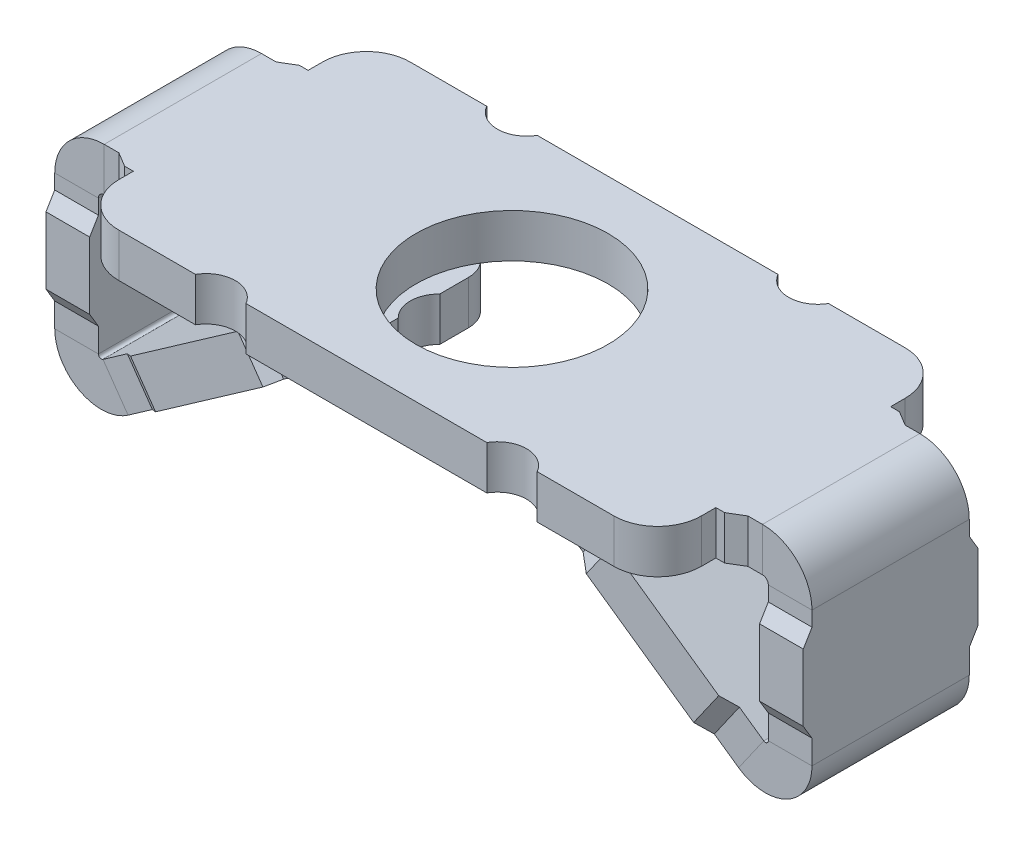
ISO-10303-21;
HEADER;
FILE_DESCRIPTION(('STEP AP214'),'2;1');
FILE_NAME('part.step','',(''),(''),'','','');
FILE_SCHEMA(('AUTOMOTIVE_DESIGN { 1 0 10303 214 1 1 1 1 }'));
ENDSEC;
DATA;
#1=APPLICATION_CONTEXT('core data for automotive mechanical design processes');
#2=APPLICATION_PROTOCOL_DEFINITION('international standard','automotive_design',2000,#1);
#3=PRODUCT_CONTEXT('',#1,'mechanical');
#4=PRODUCT('Part','Part','',(#3));
#5=PRODUCT_RELATED_PRODUCT_CATEGORY('part','',(#4));
#6=PRODUCT_DEFINITION_FORMATION('','',#4);
#7=PRODUCT_DEFINITION_CONTEXT('part definition',#1,'design');
#8=PRODUCT_DEFINITION('design','',#6,#7);
#9=PRODUCT_DEFINITION_SHAPE('','',#8);
#10=(LENGTH_UNIT() NAMED_UNIT(*) SI_UNIT(.MILLI.,.METRE.));
#11=(NAMED_UNIT(*) PLANE_ANGLE_UNIT() SI_UNIT($,.RADIAN.));
#12=(NAMED_UNIT(*) SI_UNIT($,.STERADIAN.) SOLID_ANGLE_UNIT());
#13=UNCERTAINTY_MEASURE_WITH_UNIT(LENGTH_MEASURE(1.E-05),#10,'distance_accuracy_value','');
#14=(GEOMETRIC_REPRESENTATION_CONTEXT(3) GLOBAL_UNCERTAINTY_ASSIGNED_CONTEXT((#13)) GLOBAL_UNIT_ASSIGNED_CONTEXT((#10,
#11,#12)) REPRESENTATION_CONTEXT('',''));
#15=CARTESIAN_POINT('',(0.,0.,0.));
#16=DIRECTION('',(0.,0.,1.));
#17=DIRECTION('',(1.,0.,0.));
#18=AXIS2_PLACEMENT_3D('',#15,#16,#17);
#19=CARTESIAN_POINT('',(15.,1.5,-10.5));
#20=DIRECTION('',(0.,1.,0.));
#21=DIRECTION('',(0.,0.,1.));
#22=AXIS2_PLACEMENT_3D('',#19,#20,#21);
#23=PLANE('',#22);
#24=CARTESIAN_POINT('',(10.,1.5,-5.));
#25=DIRECTION('',(0.,1.,0.));
#26=DIRECTION('',(0.,0.,1.));
#27=AXIS2_PLACEMENT_3D('',#24,#25,#26);
#28=CIRCLE('',#27,3.3);
#29=CARTESIAN_POINT('',(10.,1.5,-1.7));
#30=VERTEX_POINT('',#29);
#31=EDGE_CURVE('E1135',#30,#30,#28,.T.);
#32=ORIENTED_EDGE('',*,*,#31,.F.);
#33=EDGE_LOOP('',(#32));
#34=FACE_BOUND('',#33,.T.);
#35=DIRECTION('',(1.,0.,0.));
#36=VECTOR('',#35,1.);
#37=CARTESIAN_POINT('',(23.3,1.5,-2.3));
#38=LINE('',#37,#36);
#39=CARTESIAN_POINT('',(20.8,1.5,-2.3));
#40=VERTEX_POINT('',#39);
#41=CARTESIAN_POINT('',(21.3,1.5,-2.3));
#42=VERTEX_POINT('',#41);
#43=EDGE_CURVE('E56',#40,#42,#38,.T.);
#44=ORIENTED_EDGE('',*,*,#43,.T.);
#45=DIRECTION('',(0.,0.,-1.));
#46=VECTOR('',#45,1.);
#47=CARTESIAN_POINT('',(21.3,1.5,-10.5));
#48=LINE('',#47,#46);
#49=CARTESIAN_POINT('',(21.3,1.5,-7.7));
#50=VERTEX_POINT('',#49);
#51=EDGE_CURVE('E1345',#42,#50,#48,.T.);
#52=ORIENTED_EDGE('',*,*,#51,.T.);
#53=DIRECTION('',(-1.,0.,0.));
#54=VECTOR('',#53,1.);
#55=CARTESIAN_POINT('',(23.3,1.5,-7.7));
#56=LINE('',#55,#54);
#57=CARTESIAN_POINT('',(20.8,1.5,-7.7));
#58=VERTEX_POINT('',#57);
#59=EDGE_CURVE('E1190',#50,#58,#56,.T.);
#60=ORIENTED_EDGE('',*,*,#59,.T.);
#61=DIRECTION('',(-0.857492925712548,0.,-0.514495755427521));
#62=VECTOR('',#61,1.);
#63=CARTESIAN_POINT('',(20.8,1.5,-7.7));
#64=LINE('',#63,#62);
#65=CARTESIAN_POINT('',(20.3,1.5,-8.));
#66=VERTEX_POINT('',#65);
#67=EDGE_CURVE('E1187',#58,#66,#64,.T.);
#68=ORIENTED_EDGE('',*,*,#67,.T.);
#69=DIRECTION('',(-1.,0.,0.));
#70=VECTOR('',#69,1.);
#71=CARTESIAN_POINT('',(20.3,1.5,-8.));
#72=LINE('',#71,#70);
#73=CARTESIAN_POINT('',(20.,1.5,-8.));
#74=VERTEX_POINT('',#73);
#75=EDGE_CURVE('E1189',#66,#74,#72,.T.);
#76=ORIENTED_EDGE('',*,*,#75,.T.);
#77=DIRECTION('',(0.,0.,-1.));
#78=VECTOR('',#77,1.);
#79=CARTESIAN_POINT('',(20.,1.5,-8.));
#80=LINE('',#79,#78);
#81=CARTESIAN_POINT('',(20.,1.5,-8.49999999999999));
#82=VERTEX_POINT('',#81);
#83=EDGE_CURVE('E1192',#74,#82,#80,.T.);
#84=ORIENTED_EDGE('',*,*,#83,.T.);
#85=CARTESIAN_POINT('',(18.5,1.5,-8.5));
#86=DIRECTION('',(0.,1.,0.));
#87=DIRECTION('',(0.,0.,-1.));
#88=AXIS2_PLACEMENT_3D('',#85,#86,#87);
#89=CIRCLE('',#88,1.5);
#90=CARTESIAN_POINT('',(18.5,1.5,-10.));
#91=VERTEX_POINT('',#90);
#92=EDGE_CURVE('E1194',#82,#91,#89,.T.);
#93=ORIENTED_EDGE('',*,*,#92,.T.);
#94=DIRECTION('',(-1.,0.,0.));
#95=VECTOR('',#94,1.);
#96=CARTESIAN_POINT('',(15.8660254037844,1.5,-10.));
#97=LINE('',#96,#95);
#98=CARTESIAN_POINT('',(15.8660254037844,1.5,-10.));
#99=VERTEX_POINT('',#98);
#100=EDGE_CURVE('E1196',#91,#99,#97,.T.);
#101=ORIENTED_EDGE('',*,*,#100,.T.);
#102=CARTESIAN_POINT('',(15.,1.5,-10.5));
#103=DIRECTION('',(0.,-1.,0.));
#104=DIRECTION('',(0.,0.,1.));
#105=AXIS2_PLACEMENT_3D('',#102,#103,#104);
#106=CIRCLE('',#105,1.);
#107=CARTESIAN_POINT('',(14.1339745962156,1.5,-10.));
#108=VERTEX_POINT('',#107);
#109=EDGE_CURVE('E1141',#99,#108,#106,.T.);
#110=ORIENTED_EDGE('',*,*,#109,.T.);
#111=DIRECTION('',(-1.,0.,0.));
#112=VECTOR('',#111,1.);
#113=CARTESIAN_POINT('',(5.86602540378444,1.5,-10.));
#114=LINE('',#113,#112);
#115=CARTESIAN_POINT('',(5.86602540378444,1.5,-10.));
#116=VERTEX_POINT('',#115);
#117=EDGE_CURVE('E1144',#108,#116,#114,.T.);
#118=ORIENTED_EDGE('',*,*,#117,.T.);
#119=CARTESIAN_POINT('',(5.,1.5,-10.5));
#120=DIRECTION('',(0.,-1.,0.));
#121=DIRECTION('',(0.,0.,1.));
#122=AXIS2_PLACEMENT_3D('',#119,#120,#121);
#123=CIRCLE('',#122,1.);
#124=CARTESIAN_POINT('',(4.13397459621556,1.5,-10.));
#125=VERTEX_POINT('',#124);
#126=EDGE_CURVE('E1147',#116,#125,#123,.T.);
#127=ORIENTED_EDGE('',*,*,#126,.T.);
#128=DIRECTION('',(-1.,0.,0.));
#129=VECTOR('',#128,1.);
#130=CARTESIAN_POINT('',(1.50000000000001,1.5,-10.));
#131=LINE('',#130,#129);
#132=CARTESIAN_POINT('',(1.50000000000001,1.5,-10.));
#133=VERTEX_POINT('',#132);
#134=EDGE_CURVE('E1149',#125,#133,#131,.T.);
#135=ORIENTED_EDGE('',*,*,#134,.T.);
#136=CARTESIAN_POINT('',(1.5,1.5,-8.5));
#137=DIRECTION('',(0.,1.,0.));
#138=DIRECTION('',(0.,0.,1.));
#139=AXIS2_PLACEMENT_3D('',#136,#137,#138);
#140=CIRCLE('',#139,1.5);
#141=CARTESIAN_POINT('',(0.,1.5,-8.49999999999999));
#142=VERTEX_POINT('',#141);
#143=EDGE_CURVE('E1151',#133,#142,#140,.T.);
#144=ORIENTED_EDGE('',*,*,#143,.T.);
#145=DIRECTION('',(0.,0.,1.));
#146=VECTOR('',#145,1.);
#147=CARTESIAN_POINT('',(0.,1.5,-8.));
#148=LINE('',#147,#146);
#149=CARTESIAN_POINT('',(0.,1.5,-8.));
#150=VERTEX_POINT('',#149);
#151=EDGE_CURVE('E1153',#142,#150,#148,.T.);
#152=ORIENTED_EDGE('',*,*,#151,.T.);
#153=DIRECTION('',(-1.,0.,0.));
#154=VECTOR('',#153,1.);
#155=CARTESIAN_POINT('',(-0.300000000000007,1.5,-8.));
#156=LINE('',#155,#154);
#157=CARTESIAN_POINT('',(-0.300000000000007,1.5,-8.));
#158=VERTEX_POINT('',#157);
#159=EDGE_CURVE('E1155',#150,#158,#156,.T.);
#160=ORIENTED_EDGE('',*,*,#159,.T.);
#161=DIRECTION('',(-0.857492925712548,0.,0.51449575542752));
#162=VECTOR('',#161,1.);
#163=CARTESIAN_POINT('',(-0.800000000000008,1.5,-7.70000000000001));
#164=LINE('',#163,#162);
#165=CARTESIAN_POINT('',(-0.800000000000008,1.5,-7.70000000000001));
#166=VERTEX_POINT('',#165);
#167=EDGE_CURVE('E1157',#158,#166,#164,.T.);
#168=ORIENTED_EDGE('',*,*,#167,.T.);
#169=DIRECTION('',(-1.,0.,0.));
#170=VECTOR('',#169,1.);
#171=CARTESIAN_POINT('',(-3.30000000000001,1.5,-7.7));
#172=LINE('',#171,#170);
#173=CARTESIAN_POINT('',(-1.3,1.5,-7.70000000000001));
#174=VERTEX_POINT('',#173);
#175=EDGE_CURVE('E1159',#166,#174,#172,.T.);
#176=ORIENTED_EDGE('',*,*,#175,.T.);
#177=DIRECTION('',(0.,0.,-1.));
#178=VECTOR('',#177,1.);
#179=CARTESIAN_POINT('',(-1.30000000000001,1.5,-10.5));
#180=LINE('',#179,#178);
#181=CARTESIAN_POINT('',(-1.30000000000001,1.5,-2.30000000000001));
#182=VERTEX_POINT('',#181);
#183=EDGE_CURVE('E1334',#182,#174,#180,.T.);
#184=ORIENTED_EDGE('',*,*,#183,.F.);
#185=DIRECTION('',(1.,0.,0.));
#186=VECTOR('',#185,1.);
#187=CARTESIAN_POINT('',(-3.30000000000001,1.5,-2.3));
#188=LINE('',#187,#186);
#189=CARTESIAN_POINT('',(-0.800000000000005,1.5,-2.3));
#190=VERTEX_POINT('',#189);
#191=EDGE_CURVE('E1163',#182,#190,#188,.T.);
#192=ORIENTED_EDGE('',*,*,#191,.T.);
#193=DIRECTION('',(0.857492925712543,0.,0.514495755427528));
#194=VECTOR('',#193,1.);
#195=CARTESIAN_POINT('',(-0.800000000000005,1.5,-2.3));
#196=LINE('',#195,#194);
#197=CARTESIAN_POINT('',(-0.300000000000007,1.5,-2.));
#198=VERTEX_POINT('',#197);
#199=EDGE_CURVE('E1160',#190,#198,#196,.T.);
#200=ORIENTED_EDGE('',*,*,#199,.T.);
#201=DIRECTION('',(1.,0.,0.));
#202=VECTOR('',#201,1.);
#203=CARTESIAN_POINT('',(-0.300000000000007,1.5,-2.));
#204=LINE('',#203,#202);
#205=CARTESIAN_POINT('',(0.,1.5,-2.));
#206=VERTEX_POINT('',#205);
#207=EDGE_CURVE('E1162',#198,#206,#204,.T.);
#208=ORIENTED_EDGE('',*,*,#207,.T.);
#209=DIRECTION('',(0.,0.,1.));
#210=VECTOR('',#209,1.);
#211=CARTESIAN_POINT('',(0.,1.5,-1.50000000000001));
#212=LINE('',#211,#210);
#213=CARTESIAN_POINT('',(0.,1.5,-1.50000000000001));
#214=VERTEX_POINT('',#213);
#215=EDGE_CURVE('E1165',#206,#214,#212,.T.);
#216=ORIENTED_EDGE('',*,*,#215,.T.);
#217=CARTESIAN_POINT('',(1.5,1.5,-1.5));
#218=DIRECTION('',(0.,1.,0.));
#219=DIRECTION('',(0.,0.,-1.));
#220=AXIS2_PLACEMENT_3D('',#217,#218,#219);
#221=CIRCLE('',#220,1.5);
#222=CARTESIAN_POINT('',(1.50000000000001,1.5,0.));
#223=VERTEX_POINT('',#222);
#224=EDGE_CURVE('E1167',#214,#223,#221,.T.);
#225=ORIENTED_EDGE('',*,*,#224,.T.);
#226=DIRECTION('',(1.,0.,0.));
#227=VECTOR('',#226,1.);
#228=CARTESIAN_POINT('',(1.50000000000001,1.5,0.));
#229=LINE('',#228,#227);
#230=CARTESIAN_POINT('',(4.13397459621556,1.5,0.));
#231=VERTEX_POINT('',#230);
#232=EDGE_CURVE('E1169',#223,#231,#229,.T.);
#233=ORIENTED_EDGE('',*,*,#232,.T.);
#234=CARTESIAN_POINT('',(5.,1.5,0.5));
#235=DIRECTION('',(0.,-1.,0.));
#236=DIRECTION('',(0.,0.,1.));
#237=AXIS2_PLACEMENT_3D('',#234,#235,#236);
#238=CIRCLE('',#237,1.);
#239=CARTESIAN_POINT('',(5.86602540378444,1.5,0.));
#240=VERTEX_POINT('',#239);
#241=EDGE_CURVE('E1171',#231,#240,#238,.T.);
#242=ORIENTED_EDGE('',*,*,#241,.T.);
#243=DIRECTION('',(1.,0.,0.));
#244=VECTOR('',#243,1.);
#245=CARTESIAN_POINT('',(5.86602540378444,1.5,0.));
#246=LINE('',#245,#244);
#247=CARTESIAN_POINT('',(14.1339745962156,1.5,0.));
#248=VERTEX_POINT('',#247);
#249=EDGE_CURVE('E1173',#240,#248,#246,.T.);
#250=ORIENTED_EDGE('',*,*,#249,.T.);
#251=CARTESIAN_POINT('',(15.,1.5,0.5));
#252=DIRECTION('',(0.,-1.,0.));
#253=DIRECTION('',(0.,0.,1.));
#254=AXIS2_PLACEMENT_3D('',#251,#252,#253);
#255=CIRCLE('',#254,1.);
#256=CARTESIAN_POINT('',(15.8660254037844,1.5,0.));
#257=VERTEX_POINT('',#256);
#258=EDGE_CURVE('E1175',#248,#257,#255,.T.);
#259=ORIENTED_EDGE('',*,*,#258,.T.);
#260=DIRECTION('',(1.,0.,0.));
#261=VECTOR('',#260,1.);
#262=CARTESIAN_POINT('',(15.8660254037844,1.5,0.));
#263=LINE('',#262,#261);
#264=CARTESIAN_POINT('',(18.5,1.5,0.));
#265=VERTEX_POINT('',#264);
#266=EDGE_CURVE('E1177',#257,#265,#263,.T.);
#267=ORIENTED_EDGE('',*,*,#266,.T.);
#268=CARTESIAN_POINT('',(18.5,1.5,-1.5));
#269=DIRECTION('',(0.,1.,0.));
#270=DIRECTION('',(0.,0.,-1.));
#271=AXIS2_PLACEMENT_3D('',#268,#269,#270);
#272=CIRCLE('',#271,1.5);
#273=CARTESIAN_POINT('',(20.,1.5,-1.50000000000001));
#274=VERTEX_POINT('',#273);
#275=EDGE_CURVE('E1179',#265,#274,#272,.T.);
#276=ORIENTED_EDGE('',*,*,#275,.T.);
#277=DIRECTION('',(0.,0.,-1.));
#278=VECTOR('',#277,1.);
#279=CARTESIAN_POINT('',(20.,1.5,-1.50000000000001));
#280=LINE('',#279,#278);
#281=CARTESIAN_POINT('',(20.,1.5,-2.));
#282=VERTEX_POINT('',#281);
#283=EDGE_CURVE('E1181',#274,#282,#280,.T.);
#284=ORIENTED_EDGE('',*,*,#283,.T.);
#285=DIRECTION('',(1.,0.,0.));
#286=VECTOR('',#285,1.);
#287=CARTESIAN_POINT('',(20.3,1.5,-2.));
#288=LINE('',#287,#286);
#289=CARTESIAN_POINT('',(20.3,1.5,-2.));
#290=VERTEX_POINT('',#289);
#291=EDGE_CURVE('E1183',#282,#290,#288,.T.);
#292=ORIENTED_EDGE('',*,*,#291,.T.);
#293=DIRECTION('',(0.857492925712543,0.,-0.514495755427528));
#294=VECTOR('',#293,1.);
#295=CARTESIAN_POINT('',(20.8,1.5,-2.3));
#296=LINE('',#295,#294);
#297=EDGE_CURVE('E1185',#290,#40,#296,.T.);
#298=ORIENTED_EDGE('',*,*,#297,.T.);
#299=EDGE_LOOP('',(#44,#52,#60,#68,#76,#84,#93,#101,#110,#118,#127,#135,#144,#152,#160,#168,
#176,#184,#192,#200,#208,#216,#225,#233,#242,#250,#259,#267,#276,#284,#292,#298));
#300=FACE_BOUND('',#299,.T.);
#301=ADVANCED_FACE('F52',(#34,#300),#23,.T.);
#302=CARTESIAN_POINT('',(-3.30000000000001,1.5,-2.3));
#303=DIRECTION('',(0.,0.,-1.));
#304=DIRECTION('',(-1.,0.,0.));
#305=AXIS2_PLACEMENT_3D('',#302,#303,#304);
#306=PLANE('',#305);
#307=ORIENTED_EDGE('',*,*,#191,.F.);
#308=DIRECTION('',(0.,-1.,0.));
#309=VECTOR('',#308,1.);
#310=CARTESIAN_POINT('',(-1.30000000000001,1.5,-2.3));
#311=LINE('',#310,#309);
#312=CARTESIAN_POINT('',(-1.30000000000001,0.,-2.3));
#313=VERTEX_POINT('',#312);
#314=EDGE_CURVE('E1342',#182,#313,#311,.T.);
#315=ORIENTED_EDGE('',*,*,#314,.T.);
#316=DIRECTION('',(1.,0.,0.));
#317=VECTOR('',#316,1.);
#318=CARTESIAN_POINT('',(-3.30000000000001,0.,-2.3));
#319=LINE('',#318,#317);
#320=CARTESIAN_POINT('',(-0.800000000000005,0.,-2.3));
#321=VERTEX_POINT('',#320);
#322=EDGE_CURVE('E1219',#313,#321,#319,.T.);
#323=ORIENTED_EDGE('',*,*,#322,.T.);
#324=DIRECTION('',(0.,-1.,0.));
#325=VECTOR('',#324,1.);
#326=CARTESIAN_POINT('',(-0.800000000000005,1.5,-2.3));
#327=LINE('',#326,#325);
#328=EDGE_CURVE('E1307',#190,#321,#327,.T.);
#329=ORIENTED_EDGE('',*,*,#328,.F.);
#330=EDGE_LOOP('',(#307,#315,#323,#329));
#331=FACE_BOUND('',#330,.T.);
#332=ADVANCED_FACE('F1495',(#331),#306,.F.);
#333=CARTESIAN_POINT('',(-3.30000000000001,1.5,-7.7));
#334=DIRECTION('',(0.,0.,1.));
#335=DIRECTION('',(1.,0.,0.));
#336=AXIS2_PLACEMENT_3D('',#333,#334,#335);
#337=PLANE('',#336);
#338=DIRECTION('',(-1.,0.,0.));
#339=VECTOR('',#338,1.);
#340=CARTESIAN_POINT('',(-3.30000000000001,0.,-7.7));
#341=LINE('',#340,#339);
#342=CARTESIAN_POINT('',(-0.800000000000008,0.,-7.70000000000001));
#343=VERTEX_POINT('',#342);
#344=CARTESIAN_POINT('',(-1.30000000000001,0.,-7.70000000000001));
#345=VERTEX_POINT('',#344);
#346=EDGE_CURVE('E1215',#343,#345,#341,.T.);
#347=ORIENTED_EDGE('',*,*,#346,.T.);
#348=DIRECTION('',(0.,1.,0.));
#349=VECTOR('',#348,1.);
#350=CARTESIAN_POINT('',(-1.3,1.5,-7.7));
#351=LINE('',#350,#349);
#352=EDGE_CURVE('E1336',#345,#174,#351,.T.);
#353=ORIENTED_EDGE('',*,*,#352,.T.);
#354=ORIENTED_EDGE('',*,*,#175,.F.);
#355=DIRECTION('',(0.,-1.,0.));
#356=VECTOR('',#355,1.);
#357=CARTESIAN_POINT('',(-0.800000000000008,1.5,-7.70000000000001));
#358=LINE('',#357,#356);
#359=EDGE_CURVE('E1310',#166,#343,#358,.T.);
#360=ORIENTED_EDGE('',*,*,#359,.T.);
#361=EDGE_LOOP('',(#347,#353,#354,#360));
#362=FACE_BOUND('',#361,.T.);
#363=ADVANCED_FACE('F1449',(#362),#337,.F.);
#364=CARTESIAN_POINT('',(15.,0.,-10.5));
#365=DIRECTION('',(0.,1.,0.));
#366=DIRECTION('',(0.,0.,1.));
#367=AXIS2_PLACEMENT_3D('',#364,#365,#366);
#368=PLANE('',#367);
#369=DIRECTION('',(0.,0.,-1.));
#370=VECTOR('',#369,1.);
#371=CARTESIAN_POINT('',(21.3,0.,-10.5));
#372=LINE('',#371,#370);
#373=CARTESIAN_POINT('',(21.3,0.,-2.3));
#374=VERTEX_POINT('',#373);
#375=CARTESIAN_POINT('',(21.3,0.,-7.7));
#376=VERTEX_POINT('',#375);
#377=EDGE_CURVE('E61',#374,#376,#372,.T.);
#378=ORIENTED_EDGE('',*,*,#377,.F.);
#379=DIRECTION('',(1.,0.,0.));
#380=VECTOR('',#379,1.);
#381=CARTESIAN_POINT('',(23.3,0.,-2.3));
#382=LINE('',#381,#380);
#383=CARTESIAN_POINT('',(20.8,0.,-2.3));
#384=VERTEX_POINT('',#383);
#385=EDGE_CURVE('E77',#384,#374,#382,.T.);
#386=ORIENTED_EDGE('',*,*,#385,.F.);
#387=DIRECTION('',(0.857492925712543,0.,-0.514495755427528));
#388=VECTOR('',#387,1.);
#389=CARTESIAN_POINT('',(20.8,0.,-2.3));
#390=LINE('',#389,#388);
#391=CARTESIAN_POINT('',(20.3,0.,-2.));
#392=VERTEX_POINT('',#391);
#393=EDGE_CURVE('E1241',#392,#384,#390,.T.);
#394=ORIENTED_EDGE('',*,*,#393,.F.);
#395=DIRECTION('',(1.,0.,0.));
#396=VECTOR('',#395,1.);
#397=CARTESIAN_POINT('',(20.3,0.,-2.));
#398=LINE('',#397,#396);
#399=CARTESIAN_POINT('',(20.,0.,-2.));
#400=VERTEX_POINT('',#399);
#401=EDGE_CURVE('E1239',#400,#392,#398,.T.);
#402=ORIENTED_EDGE('',*,*,#401,.F.);
#403=DIRECTION('',(0.,0.,-1.));
#404=VECTOR('',#403,1.);
#405=CARTESIAN_POINT('',(20.,0.,-1.50000000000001));
#406=LINE('',#405,#404);
#407=CARTESIAN_POINT('',(20.,0.,-1.50000000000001));
#408=VERTEX_POINT('',#407);
#409=EDGE_CURVE('E1237',#408,#400,#406,.T.);
#410=ORIENTED_EDGE('',*,*,#409,.F.);
#411=CARTESIAN_POINT('',(18.5,0.,-1.5));
#412=DIRECTION('',(0.,1.,0.));
#413=DIRECTION('',(0.,0.,-1.));
#414=AXIS2_PLACEMENT_3D('',#411,#412,#413);
#415=CIRCLE('',#414,1.5);
#416=CARTESIAN_POINT('',(18.5,0.,0.));
#417=VERTEX_POINT('',#416);
#418=EDGE_CURVE('E1235',#417,#408,#415,.T.);
#419=ORIENTED_EDGE('',*,*,#418,.F.);
#420=DIRECTION('',(1.,0.,0.));
#421=VECTOR('',#420,1.);
#422=CARTESIAN_POINT('',(15.8660254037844,0.,0.));
#423=LINE('',#422,#421);
#424=CARTESIAN_POINT('',(15.8660254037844,0.,0.));
#425=VERTEX_POINT('',#424);
#426=EDGE_CURVE('E1233',#425,#417,#423,.T.);
#427=ORIENTED_EDGE('',*,*,#426,.F.);
#428=CARTESIAN_POINT('',(15.,0.,0.5));
#429=DIRECTION('',(0.,-1.,0.));
#430=DIRECTION('',(0.,0.,1.));
#431=AXIS2_PLACEMENT_3D('',#428,#429,#430);
#432=CIRCLE('',#431,1.);
#433=CARTESIAN_POINT('',(14.1339745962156,0.,0.));
#434=VERTEX_POINT('',#433);
#435=EDGE_CURVE('E1231',#434,#425,#432,.T.);
#436=ORIENTED_EDGE('',*,*,#435,.F.);
#437=DIRECTION('',(1.,0.,0.));
#438=VECTOR('',#437,1.);
#439=CARTESIAN_POINT('',(5.86602540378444,0.,0.));
#440=LINE('',#439,#438);
#441=CARTESIAN_POINT('',(5.86602540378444,0.,0.));
#442=VERTEX_POINT('',#441);
#443=EDGE_CURVE('E1229',#442,#434,#440,.T.);
#444=ORIENTED_EDGE('',*,*,#443,.F.);
#445=CARTESIAN_POINT('',(5.,0.,0.5));
#446=DIRECTION('',(0.,-1.,0.));
#447=DIRECTION('',(0.,0.,1.));
#448=AXIS2_PLACEMENT_3D('',#445,#446,#447);
#449=CIRCLE('',#448,1.);
#450=CARTESIAN_POINT('',(4.13397459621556,0.,0.));
#451=VERTEX_POINT('',#450);
#452=EDGE_CURVE('E1227',#451,#442,#449,.T.);
#453=ORIENTED_EDGE('',*,*,#452,.F.);
#454=DIRECTION('',(1.,0.,0.));
#455=VECTOR('',#454,1.);
#456=CARTESIAN_POINT('',(1.50000000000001,0.,0.));
#457=LINE('',#456,#455);
#458=CARTESIAN_POINT('',(1.50000000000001,0.,0.));
#459=VERTEX_POINT('',#458);
#460=EDGE_CURVE('E1225',#459,#451,#457,.T.);
#461=ORIENTED_EDGE('',*,*,#460,.F.);
#462=CARTESIAN_POINT('',(1.5,0.,-1.5));
#463=DIRECTION('',(0.,1.,0.));
#464=DIRECTION('',(0.,0.,-1.));
#465=AXIS2_PLACEMENT_3D('',#462,#463,#464);
#466=CIRCLE('',#465,1.5);
#467=CARTESIAN_POINT('',(0.,0.,-1.50000000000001));
#468=VERTEX_POINT('',#467);
#469=EDGE_CURVE('E1223',#468,#459,#466,.T.);
#470=ORIENTED_EDGE('',*,*,#469,.F.);
#471=DIRECTION('',(0.,0.,1.));
#472=VECTOR('',#471,1.);
#473=CARTESIAN_POINT('',(0.,0.,-1.50000000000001));
#474=LINE('',#473,#472);
#475=CARTESIAN_POINT('',(0.,0.,-2.));
#476=VERTEX_POINT('',#475);
#477=EDGE_CURVE('E1221',#476,#468,#474,.T.);
#478=ORIENTED_EDGE('',*,*,#477,.F.);
#479=DIRECTION('',(1.,0.,0.));
#480=VECTOR('',#479,1.);
#481=CARTESIAN_POINT('',(-0.300000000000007,0.,-2.));
#482=LINE('',#481,#480);
#483=CARTESIAN_POINT('',(-0.300000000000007,0.,-2.));
#484=VERTEX_POINT('',#483);
#485=EDGE_CURVE('E1218',#484,#476,#482,.T.);
#486=ORIENTED_EDGE('',*,*,#485,.F.);
#487=DIRECTION('',(0.857492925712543,0.,0.514495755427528));
#488=VECTOR('',#487,1.);
#489=CARTESIAN_POINT('',(-0.800000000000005,0.,-2.3));
#490=LINE('',#489,#488);
#491=EDGE_CURVE('E1216',#321,#484,#490,.T.);
#492=ORIENTED_EDGE('',*,*,#491,.F.);
#493=ORIENTED_EDGE('',*,*,#322,.F.);
#494=DIRECTION('',(0.,0.,-1.));
#495=VECTOR('',#494,1.);
#496=CARTESIAN_POINT('',(-1.30000000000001,0.,-10.5));
#497=LINE('',#496,#495);
#498=EDGE_CURVE('E1339',#313,#345,#497,.T.);
#499=ORIENTED_EDGE('',*,*,#498,.T.);
#500=ORIENTED_EDGE('',*,*,#346,.F.);
#501=DIRECTION('',(-0.857492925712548,0.,0.51449575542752));
#502=VECTOR('',#501,1.);
#503=CARTESIAN_POINT('',(-0.800000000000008,0.,-7.70000000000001));
#504=LINE('',#503,#502);
#505=CARTESIAN_POINT('',(-0.300000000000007,0.,-8.));
#506=VERTEX_POINT('',#505);
#507=EDGE_CURVE('E1213',#506,#343,#504,.T.);
#508=ORIENTED_EDGE('',*,*,#507,.F.);
#509=DIRECTION('',(-1.,0.,0.));
#510=VECTOR('',#509,1.);
#511=CARTESIAN_POINT('',(-0.300000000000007,0.,-8.));
#512=LINE('',#511,#510);
#513=CARTESIAN_POINT('',(0.,0.,-8.));
#514=VERTEX_POINT('',#513);
#515=EDGE_CURVE('E1211',#514,#506,#512,.T.);
#516=ORIENTED_EDGE('',*,*,#515,.F.);
#517=DIRECTION('',(0.,0.,1.));
#518=VECTOR('',#517,1.);
#519=CARTESIAN_POINT('',(0.,0.,-8.));
#520=LINE('',#519,#518);
#521=CARTESIAN_POINT('',(0.,0.,-8.49999999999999));
#522=VERTEX_POINT('',#521);
#523=EDGE_CURVE('E1209',#522,#514,#520,.T.);
#524=ORIENTED_EDGE('',*,*,#523,.F.);
#525=CARTESIAN_POINT('',(1.5,0.,-8.5));
#526=DIRECTION('',(0.,1.,0.));
#527=DIRECTION('',(0.,0.,1.));
#528=AXIS2_PLACEMENT_3D('',#525,#526,#527);
#529=CIRCLE('',#528,1.5);
#530=CARTESIAN_POINT('',(1.50000000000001,0.,-10.));
#531=VERTEX_POINT('',#530);
#532=EDGE_CURVE('E1207',#531,#522,#529,.T.);
#533=ORIENTED_EDGE('',*,*,#532,.F.);
#534=DIRECTION('',(-1.,0.,0.));
#535=VECTOR('',#534,1.);
#536=CARTESIAN_POINT('',(1.50000000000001,0.,-10.));
#537=LINE('',#536,#535);
#538=CARTESIAN_POINT('',(4.13397459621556,0.,-10.));
#539=VERTEX_POINT('',#538);
#540=EDGE_CURVE('E1205',#539,#531,#537,.T.);
#541=ORIENTED_EDGE('',*,*,#540,.F.);
#542=CARTESIAN_POINT('',(5.,0.,-10.5));
#543=DIRECTION('',(0.,-1.,0.));
#544=DIRECTION('',(0.,0.,1.));
#545=AXIS2_PLACEMENT_3D('',#542,#543,#544);
#546=CIRCLE('',#545,1.);
#547=CARTESIAN_POINT('',(5.86602540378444,0.,-10.));
#548=VERTEX_POINT('',#547);
#549=EDGE_CURVE('E1203',#548,#539,#546,.T.);
#550=ORIENTED_EDGE('',*,*,#549,.F.);
#551=DIRECTION('',(-1.,0.,0.));
#552=VECTOR('',#551,1.);
#553=CARTESIAN_POINT('',(5.86602540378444,0.,-10.));
#554=LINE('',#553,#552);
#555=CARTESIAN_POINT('',(14.1339745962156,0.,-10.));
#556=VERTEX_POINT('',#555);
#557=EDGE_CURVE('E1201',#556,#548,#554,.T.);
#558=ORIENTED_EDGE('',*,*,#557,.F.);
#559=CARTESIAN_POINT('',(15.,0.,-10.5));
#560=DIRECTION('',(0.,-1.,0.));
#561=DIRECTION('',(0.,0.,1.));
#562=AXIS2_PLACEMENT_3D('',#559,#560,#561);
#563=CIRCLE('',#562,1.);
#564=CARTESIAN_POINT('',(15.8660254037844,0.,-10.));
#565=VERTEX_POINT('',#564);
#566=EDGE_CURVE('E1138',#565,#556,#563,.T.);
#567=ORIENTED_EDGE('',*,*,#566,.F.);
#568=DIRECTION('',(-1.,0.,0.));
#569=VECTOR('',#568,1.);
#570=CARTESIAN_POINT('',(15.8660254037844,0.,-10.));
#571=LINE('',#570,#569);
#572=CARTESIAN_POINT('',(18.5,0.,-10.));
#573=VERTEX_POINT('',#572);
#574=EDGE_CURVE('E1145',#573,#565,#571,.T.);
#575=ORIENTED_EDGE('',*,*,#574,.F.);
#576=CARTESIAN_POINT('',(18.5,0.,-8.5));
#577=DIRECTION('',(0.,1.,0.));
#578=DIRECTION('',(0.,0.,-1.));
#579=AXIS2_PLACEMENT_3D('',#576,#577,#578);
#580=CIRCLE('',#579,1.5);
#581=CARTESIAN_POINT('',(20.,0.,-8.49999999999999));
#582=VERTEX_POINT('',#581);
#583=EDGE_CURVE('E1249',#582,#573,#580,.T.);
#584=ORIENTED_EDGE('',*,*,#583,.F.);
#585=DIRECTION('',(0.,0.,-1.));
#586=VECTOR('',#585,1.);
#587=CARTESIAN_POINT('',(20.,0.,-8.));
#588=LINE('',#587,#586);
#589=CARTESIAN_POINT('',(20.,0.,-8.));
#590=VERTEX_POINT('',#589);
#591=EDGE_CURVE('E1247',#590,#582,#588,.T.);
#592=ORIENTED_EDGE('',*,*,#591,.F.);
#593=DIRECTION('',(-1.,0.,0.));
#594=VECTOR('',#593,1.);
#595=CARTESIAN_POINT('',(20.3,0.,-8.));
#596=LINE('',#595,#594);
#597=CARTESIAN_POINT('',(20.3,0.,-8.));
#598=VERTEX_POINT('',#597);
#599=EDGE_CURVE('E1245',#598,#590,#596,.T.);
#600=ORIENTED_EDGE('',*,*,#599,.F.);
#601=DIRECTION('',(-0.857492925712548,0.,-0.514495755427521));
#602=VECTOR('',#601,1.);
#603=CARTESIAN_POINT('',(20.8,0.,-7.7));
#604=LINE('',#603,#602);
#605=CARTESIAN_POINT('',(20.8,0.,-7.7));
#606=VERTEX_POINT('',#605);
#607=EDGE_CURVE('E1243',#606,#598,#604,.T.);
#608=ORIENTED_EDGE('',*,*,#607,.F.);
#609=DIRECTION('',(-1.,0.,0.));
#610=VECTOR('',#609,1.);
#611=CARTESIAN_POINT('',(23.3,0.,-7.7));
#612=LINE('',#611,#610);
#613=EDGE_CURVE('E69',#376,#606,#612,.T.);
#614=ORIENTED_EDGE('',*,*,#613,.F.);
#615=EDGE_LOOP('',(#378,#386,#394,#402,#410,#419,#427,#436,#444,#453,#461,#470,#478,#486,#492,
#493,#499,#500,#508,#516,#524,#533,#541,#550,#558,#567,#575,#584,#592,#600,#608,#614));
#616=FACE_BOUND('',#615,.T.);
#617=CARTESIAN_POINT('',(10.,0.,-5.));
#618=DIRECTION('',(0.,1.,0.));
#619=DIRECTION('',(0.,0.,1.));
#620=AXIS2_PLACEMENT_3D('',#617,#618,#619);
#621=CIRCLE('',#620,3.3);
#622=CARTESIAN_POINT('',(10.,0.,-1.7));
#623=VERTEX_POINT('',#622);
#624=EDGE_CURVE('E1131',#623,#623,#621,.T.);
#625=ORIENTED_EDGE('',*,*,#624,.T.);
#626=EDGE_LOOP('',(#625));
#627=FACE_BOUND('',#626,.T.);
#628=ADVANCED_FACE('F1508',(#616,#627),#368,.F.);
#629=CARTESIAN_POINT('',(15.,1.5,-10.5));
#630=DIRECTION('',(0.,-1.,0.));
#631=DIRECTION('',(0.,0.,-1.));
#632=AXIS2_PLACEMENT_3D('',#629,#630,#631);
#633=CYLINDRICAL_SURFACE('',#632,1.);
#634=ORIENTED_EDGE('',*,*,#566,.T.);
#635=DIRECTION('',(0.,-1.,0.));
#636=VECTOR('',#635,1.);
#637=CARTESIAN_POINT('',(14.1339745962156,1.5,-10.));
#638=LINE('',#637,#636);
#639=EDGE_CURVE('E1331',#108,#556,#638,.T.);
#640=ORIENTED_EDGE('',*,*,#639,.F.);
#641=ORIENTED_EDGE('',*,*,#109,.F.);
#642=DIRECTION('',(0.,-1.,0.));
#643=VECTOR('',#642,1.);
#644=CARTESIAN_POINT('',(15.8660254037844,1.5,-10.));
#645=LINE('',#644,#643);
#646=EDGE_CURVE('E1198',#99,#565,#645,.T.);
#647=ORIENTED_EDGE('',*,*,#646,.T.);
#648=EDGE_LOOP('',(#634,#640,#641,#647));
#649=FACE_BOUND('',#648,.T.);
#650=ADVANCED_FACE('F1411',(#649),#633,.F.);
#651=CARTESIAN_POINT('',(5.86602540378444,1.5,-10.));
#652=DIRECTION('',(0.,0.,1.));
#653=DIRECTION('',(1.,0.,0.));
#654=AXIS2_PLACEMENT_3D('',#651,#652,#653);
#655=PLANE('',#654);
#656=ORIENTED_EDGE('',*,*,#557,.T.);
#657=DIRECTION('',(0.,-1.,0.));
#658=VECTOR('',#657,1.);
#659=CARTESIAN_POINT('',(5.86602540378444,1.5,-10.));
#660=LINE('',#659,#658);
#661=EDGE_CURVE('E1328',#116,#548,#660,.T.);
#662=ORIENTED_EDGE('',*,*,#661,.F.);
#663=ORIENTED_EDGE('',*,*,#117,.F.);
#664=ORIENTED_EDGE('',*,*,#639,.T.);
#665=EDGE_LOOP('',(#656,#662,#663,#664));
#666=FACE_BOUND('',#665,.T.);
#667=ADVANCED_FACE('F1413',(#666),#655,.F.);
#668=CARTESIAN_POINT('',(5.,1.5,-10.5));
#669=DIRECTION('',(0.,-1.,0.));
#670=DIRECTION('',(0.,0.,-1.));
#671=AXIS2_PLACEMENT_3D('',#668,#669,#670);
#672=CYLINDRICAL_SURFACE('',#671,1.);
#673=ORIENTED_EDGE('',*,*,#549,.T.);
#674=DIRECTION('',(0.,-1.,0.));
#675=VECTOR('',#674,1.);
#676=CARTESIAN_POINT('',(4.13397459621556,1.5,-10.));
#677=LINE('',#676,#675);
#678=EDGE_CURVE('E1325',#125,#539,#677,.T.);
#679=ORIENTED_EDGE('',*,*,#678,.F.);
#680=ORIENTED_EDGE('',*,*,#126,.F.);
#681=ORIENTED_EDGE('',*,*,#661,.T.);
#682=EDGE_LOOP('',(#673,#679,#680,#681));
#683=FACE_BOUND('',#682,.T.);
#684=ADVANCED_FACE('F1420',(#683),#672,.F.);
#685=CARTESIAN_POINT('',(1.50000000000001,1.5,-10.));
#686=DIRECTION('',(0.,0.,1.));
#687=DIRECTION('',(1.,0.,0.));
#688=AXIS2_PLACEMENT_3D('',#685,#686,#687);
#689=PLANE('',#688);
#690=ORIENTED_EDGE('',*,*,#540,.T.);
#691=DIRECTION('',(0.,-1.,0.));
#692=VECTOR('',#691,1.);
#693=CARTESIAN_POINT('',(1.50000000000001,1.5,-10.));
#694=LINE('',#693,#692);
#695=EDGE_CURVE('E1322',#133,#531,#694,.T.);
#696=ORIENTED_EDGE('',*,*,#695,.F.);
#697=ORIENTED_EDGE('',*,*,#134,.F.);
#698=ORIENTED_EDGE('',*,*,#678,.T.);
#699=EDGE_LOOP('',(#690,#696,#697,#698));
#700=FACE_BOUND('',#699,.T.);
#701=ADVANCED_FACE('F1424',(#700),#689,.F.);
#702=CARTESIAN_POINT('',(1.5,1.5,-8.5));
#703=DIRECTION('',(0.,-1.,0.));
#704=DIRECTION('',(0.,0.,-1.));
#705=AXIS2_PLACEMENT_3D('',#702,#703,#704);
#706=CYLINDRICAL_SURFACE('',#705,1.5);
#707=ORIENTED_EDGE('',*,*,#532,.T.);
#708=DIRECTION('',(0.,-1.,0.));
#709=VECTOR('',#708,1.);
#710=CARTESIAN_POINT('',(0.,1.5,-8.49999999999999));
#711=LINE('',#710,#709);
#712=EDGE_CURVE('E1319',#142,#522,#711,.T.);
#713=ORIENTED_EDGE('',*,*,#712,.F.);
#714=ORIENTED_EDGE('',*,*,#143,.F.);
#715=ORIENTED_EDGE('',*,*,#695,.T.);
#716=EDGE_LOOP('',(#707,#713,#714,#715));
#717=FACE_BOUND('',#716,.T.);
#718=ADVANCED_FACE('F1429',(#717),#706,.T.);
#719=CARTESIAN_POINT('',(0.,1.5,-8.));
#720=DIRECTION('',(1.,0.,0.));
#721=DIRECTION('',(0.,0.,-1.));
#722=AXIS2_PLACEMENT_3D('',#719,#720,#721);
#723=PLANE('',#722);
#724=ORIENTED_EDGE('',*,*,#523,.T.);
#725=DIRECTION('',(0.,-1.,0.));
#726=VECTOR('',#725,1.);
#727=CARTESIAN_POINT('',(0.,1.5,-8.));
#728=LINE('',#727,#726);
#729=EDGE_CURVE('E1316',#150,#514,#728,.T.);
#730=ORIENTED_EDGE('',*,*,#729,.F.);
#731=ORIENTED_EDGE('',*,*,#151,.F.);
#732=ORIENTED_EDGE('',*,*,#712,.T.);
#733=EDGE_LOOP('',(#724,#730,#731,#732));
#734=FACE_BOUND('',#733,.T.);
#735=ADVANCED_FACE('F1435',(#734),#723,.F.);
#736=CARTESIAN_POINT('',(-0.300000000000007,1.5,-8.));
#737=DIRECTION('',(0.,0.,1.));
#738=DIRECTION('',(1.,0.,0.));
#739=AXIS2_PLACEMENT_3D('',#736,#737,#738);
#740=PLANE('',#739);
#741=ORIENTED_EDGE('',*,*,#515,.T.);
#742=DIRECTION('',(0.,-1.,0.));
#743=VECTOR('',#742,1.);
#744=CARTESIAN_POINT('',(-0.300000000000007,1.5,-8.));
#745=LINE('',#744,#743);
#746=EDGE_CURVE('E1313',#158,#506,#745,.T.);
#747=ORIENTED_EDGE('',*,*,#746,.F.);
#748=ORIENTED_EDGE('',*,*,#159,.F.);
#749=ORIENTED_EDGE('',*,*,#729,.T.);
#750=EDGE_LOOP('',(#741,#747,#748,#749));
#751=FACE_BOUND('',#750,.T.);
#752=ADVANCED_FACE('F1439',(#751),#740,.F.);
#753=CARTESIAN_POINT('',(-0.800000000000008,1.5,-7.70000000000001));
#754=DIRECTION('',(0.51449575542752,0.,0.857492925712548));
#755=DIRECTION('',(0.857492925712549,0.,-0.51449575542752));
#756=AXIS2_PLACEMENT_3D('',#753,#754,#755);
#757=PLANE('',#756);
#758=ORIENTED_EDGE('',*,*,#507,.T.);
#759=ORIENTED_EDGE('',*,*,#359,.F.);
#760=ORIENTED_EDGE('',*,*,#167,.F.);
#761=ORIENTED_EDGE('',*,*,#746,.T.);
#762=EDGE_LOOP('',(#758,#759,#760,#761));
#763=FACE_BOUND('',#762,.T.);
#764=ADVANCED_FACE('F1444',(#763),#757,.F.);
#765=CARTESIAN_POINT('',(-0.800000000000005,1.5,-2.3));
#766=DIRECTION('',(0.514495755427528,0.,-0.857492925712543));
#767=DIRECTION('',(-0.857492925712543,0.,-0.514495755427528));
#768=AXIS2_PLACEMENT_3D('',#765,#766,#767);
#769=PLANE('',#768);
#770=ORIENTED_EDGE('',*,*,#491,.T.);
#771=DIRECTION('',(0.,-1.,0.));
#772=VECTOR('',#771,1.);
#773=CARTESIAN_POINT('',(-0.300000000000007,1.5,-2.));
#774=LINE('',#773,#772);
#775=EDGE_CURVE('E1304',#198,#484,#774,.T.);
#776=ORIENTED_EDGE('',*,*,#775,.F.);
#777=ORIENTED_EDGE('',*,*,#199,.F.);
#778=ORIENTED_EDGE('',*,*,#328,.T.);
#779=EDGE_LOOP('',(#770,#776,#777,#778));
#780=FACE_BOUND('',#779,.T.);
#781=ADVANCED_FACE('F1580',(#780),#769,.F.);
#782=CARTESIAN_POINT('',(-0.300000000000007,1.5,-2.));
#783=DIRECTION('',(0.,0.,-1.));
#784=DIRECTION('',(-1.,0.,0.));
#785=AXIS2_PLACEMENT_3D('',#782,#783,#784);
#786=PLANE('',#785);
#787=ORIENTED_EDGE('',*,*,#485,.T.);
#788=DIRECTION('',(0.,-1.,0.));
#789=VECTOR('',#788,1.);
#790=CARTESIAN_POINT('',(0.,1.5,-2.));
#791=LINE('',#790,#789);
#792=EDGE_CURVE('E1301',#206,#476,#791,.T.);
#793=ORIENTED_EDGE('',*,*,#792,.F.);
#794=ORIENTED_EDGE('',*,*,#207,.F.);
#795=ORIENTED_EDGE('',*,*,#775,.T.);
#796=EDGE_LOOP('',(#787,#793,#794,#795));
#797=FACE_BOUND('',#796,.T.);
#798=ADVANCED_FACE('F1576',(#797),#786,.F.);
#799=CARTESIAN_POINT('',(0.,1.5,-1.50000000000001));
#800=DIRECTION('',(1.,0.,0.));
#801=DIRECTION('',(0.,0.,-1.));
#802=AXIS2_PLACEMENT_3D('',#799,#800,#801);
#803=PLANE('',#802);
#804=ORIENTED_EDGE('',*,*,#477,.T.);
#805=DIRECTION('',(0.,-1.,0.));
#806=VECTOR('',#805,1.);
#807=CARTESIAN_POINT('',(0.,1.5,-1.50000000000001));
#808=LINE('',#807,#806);
#809=EDGE_CURVE('E1298',#214,#468,#808,.T.);
#810=ORIENTED_EDGE('',*,*,#809,.F.);
#811=ORIENTED_EDGE('',*,*,#215,.F.);
#812=ORIENTED_EDGE('',*,*,#792,.T.);
#813=EDGE_LOOP('',(#804,#810,#811,#812));
#814=FACE_BOUND('',#813,.T.);
#815=ADVANCED_FACE('F1572',(#814),#803,.F.);
#816=CARTESIAN_POINT('',(1.5,1.5,-1.5));
#817=DIRECTION('',(0.,-1.,0.));
#818=DIRECTION('',(0.,0.,-1.));
#819=AXIS2_PLACEMENT_3D('',#816,#817,#818);
#820=CYLINDRICAL_SURFACE('',#819,1.5);
#821=ORIENTED_EDGE('',*,*,#469,.T.);
#822=DIRECTION('',(0.,-1.,0.));
#823=VECTOR('',#822,1.);
#824=CARTESIAN_POINT('',(1.50000000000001,1.5,0.));
#825=LINE('',#824,#823);
#826=EDGE_CURVE('E1295',#223,#459,#825,.T.);
#827=ORIENTED_EDGE('',*,*,#826,.F.);
#828=ORIENTED_EDGE('',*,*,#224,.F.);
#829=ORIENTED_EDGE('',*,*,#809,.T.);
#830=EDGE_LOOP('',(#821,#827,#828,#829));
#831=FACE_BOUND('',#830,.T.);
#832=ADVANCED_FACE('F1568',(#831),#820,.T.);
#833=CARTESIAN_POINT('',(1.50000000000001,1.5,0.));
#834=DIRECTION('',(0.,0.,-1.));
#835=DIRECTION('',(-1.,0.,0.));
#836=AXIS2_PLACEMENT_3D('',#833,#834,#835);
#837=PLANE('',#836);
#838=ORIENTED_EDGE('',*,*,#460,.T.);
#839=DIRECTION('',(0.,-1.,0.));
#840=VECTOR('',#839,1.);
#841=CARTESIAN_POINT('',(4.13397459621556,1.5,0.));
#842=LINE('',#841,#840);
#843=EDGE_CURVE('E1292',#231,#451,#842,.T.);
#844=ORIENTED_EDGE('',*,*,#843,.F.);
#845=ORIENTED_EDGE('',*,*,#232,.F.);
#846=ORIENTED_EDGE('',*,*,#826,.T.);
#847=EDGE_LOOP('',(#838,#844,#845,#846));
#848=FACE_BOUND('',#847,.T.);
#849=ADVANCED_FACE('F1564',(#848),#837,.F.);
#850=CARTESIAN_POINT('',(5.,1.5,0.5));
#851=DIRECTION('',(0.,-1.,0.));
#852=DIRECTION('',(0.,0.,-1.));
#853=AXIS2_PLACEMENT_3D('',#850,#851,#852);
#854=CYLINDRICAL_SURFACE('',#853,1.);
#855=ORIENTED_EDGE('',*,*,#452,.T.);
#856=DIRECTION('',(0.,-1.,0.));
#857=VECTOR('',#856,1.);
#858=CARTESIAN_POINT('',(5.86602540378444,1.5,0.));
#859=LINE('',#858,#857);
#860=EDGE_CURVE('E1289',#240,#442,#859,.T.);
#861=ORIENTED_EDGE('',*,*,#860,.F.);
#862=ORIENTED_EDGE('',*,*,#241,.F.);
#863=ORIENTED_EDGE('',*,*,#843,.T.);
#864=EDGE_LOOP('',(#855,#861,#862,#863));
#865=FACE_BOUND('',#864,.T.);
#866=ADVANCED_FACE('F1560',(#865),#854,.F.);
#867=CARTESIAN_POINT('',(5.86602540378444,1.5,0.));
#868=DIRECTION('',(0.,0.,-1.));
#869=DIRECTION('',(-1.,0.,0.));
#870=AXIS2_PLACEMENT_3D('',#867,#868,#869);
#871=PLANE('',#870);
#872=ORIENTED_EDGE('',*,*,#443,.T.);
#873=DIRECTION('',(0.,-1.,0.));
#874=VECTOR('',#873,1.);
#875=CARTESIAN_POINT('',(14.1339745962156,1.5,0.));
#876=LINE('',#875,#874);
#877=EDGE_CURVE('E1286',#248,#434,#876,.T.);
#878=ORIENTED_EDGE('',*,*,#877,.F.);
#879=ORIENTED_EDGE('',*,*,#249,.F.);
#880=ORIENTED_EDGE('',*,*,#860,.T.);
#881=EDGE_LOOP('',(#872,#878,#879,#880));
#882=FACE_BOUND('',#881,.T.);
#883=ADVANCED_FACE('F1556',(#882),#871,.F.);
#884=CARTESIAN_POINT('',(15.,1.5,0.5));
#885=DIRECTION('',(0.,-1.,0.));
#886=DIRECTION('',(0.,0.,-1.));
#887=AXIS2_PLACEMENT_3D('',#884,#885,#886);
#888=CYLINDRICAL_SURFACE('',#887,1.);
#889=ORIENTED_EDGE('',*,*,#435,.T.);
#890=DIRECTION('',(0.,-1.,0.));
#891=VECTOR('',#890,1.);
#892=CARTESIAN_POINT('',(15.8660254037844,1.5,0.));
#893=LINE('',#892,#891);
#894=EDGE_CURVE('E1283',#257,#425,#893,.T.);
#895=ORIENTED_EDGE('',*,*,#894,.F.);
#896=ORIENTED_EDGE('',*,*,#258,.F.);
#897=ORIENTED_EDGE('',*,*,#877,.T.);
#898=EDGE_LOOP('',(#889,#895,#896,#897));
#899=FACE_BOUND('',#898,.T.);
#900=ADVANCED_FACE('F1552',(#899),#888,.F.);
#901=CARTESIAN_POINT('',(15.8660254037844,1.5,0.));
#902=DIRECTION('',(0.,0.,-1.));
#903=DIRECTION('',(-1.,0.,0.));
#904=AXIS2_PLACEMENT_3D('',#901,#902,#903);
#905=PLANE('',#904);
#906=ORIENTED_EDGE('',*,*,#426,.T.);
#907=DIRECTION('',(0.,-1.,0.));
#908=VECTOR('',#907,1.);
#909=CARTESIAN_POINT('',(18.5,1.5,0.));
#910=LINE('',#909,#908);
#911=EDGE_CURVE('E1280',#265,#417,#910,.T.);
#912=ORIENTED_EDGE('',*,*,#911,.F.);
#913=ORIENTED_EDGE('',*,*,#266,.F.);
#914=ORIENTED_EDGE('',*,*,#894,.T.);
#915=EDGE_LOOP('',(#906,#912,#913,#914));
#916=FACE_BOUND('',#915,.T.);
#917=ADVANCED_FACE('F1548',(#916),#905,.F.);
#918=CARTESIAN_POINT('',(18.5,1.5,-1.5));
#919=DIRECTION('',(0.,-1.,0.));
#920=DIRECTION('',(0.,0.,-1.));
#921=AXIS2_PLACEMENT_3D('',#918,#919,#920);
#922=CYLINDRICAL_SURFACE('',#921,1.5);
#923=ORIENTED_EDGE('',*,*,#418,.T.);
#924=DIRECTION('',(0.,-1.,0.));
#925=VECTOR('',#924,1.);
#926=CARTESIAN_POINT('',(20.,1.5,-1.50000000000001));
#927=LINE('',#926,#925);
#928=EDGE_CURVE('E1277',#274,#408,#927,.T.);
#929=ORIENTED_EDGE('',*,*,#928,.F.);
#930=ORIENTED_EDGE('',*,*,#275,.F.);
#931=ORIENTED_EDGE('',*,*,#911,.T.);
#932=EDGE_LOOP('',(#923,#929,#930,#931));
#933=FACE_BOUND('',#932,.T.);
#934=ADVANCED_FACE('F1544',(#933),#922,.T.);
#935=CARTESIAN_POINT('',(20.,1.5,-1.50000000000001));
#936=DIRECTION('',(-1.,0.,0.));
#937=DIRECTION('',(0.,0.,1.));
#938=AXIS2_PLACEMENT_3D('',#935,#936,#937);
#939=PLANE('',#938);
#940=ORIENTED_EDGE('',*,*,#409,.T.);
#941=DIRECTION('',(0.,-1.,0.));
#942=VECTOR('',#941,1.);
#943=CARTESIAN_POINT('',(20.,1.5,-2.));
#944=LINE('',#943,#942);
#945=EDGE_CURVE('E1274',#282,#400,#944,.T.);
#946=ORIENTED_EDGE('',*,*,#945,.F.);
#947=ORIENTED_EDGE('',*,*,#283,.F.);
#948=ORIENTED_EDGE('',*,*,#928,.T.);
#949=EDGE_LOOP('',(#940,#946,#947,#948));
#950=FACE_BOUND('',#949,.T.);
#951=ADVANCED_FACE('F1540',(#950),#939,.F.);
#952=CARTESIAN_POINT('',(20.3,1.5,-2.));
#953=DIRECTION('',(0.,0.,-1.));
#954=DIRECTION('',(-1.,0.,0.));
#955=AXIS2_PLACEMENT_3D('',#952,#953,#954);
#956=PLANE('',#955);
#957=ORIENTED_EDGE('',*,*,#401,.T.);
#958=DIRECTION('',(0.,-1.,0.));
#959=VECTOR('',#958,1.);
#960=CARTESIAN_POINT('',(20.3,1.5,-2.));
#961=LINE('',#960,#959);
#962=EDGE_CURVE('E1271',#290,#392,#961,.T.);
#963=ORIENTED_EDGE('',*,*,#962,.F.);
#964=ORIENTED_EDGE('',*,*,#291,.F.);
#965=ORIENTED_EDGE('',*,*,#945,.T.);
#966=EDGE_LOOP('',(#957,#963,#964,#965));
#967=FACE_BOUND('',#966,.T.);
#968=ADVANCED_FACE('F1536',(#967),#956,.F.);
#969=CARTESIAN_POINT('',(20.8,1.5,-2.3));
#970=DIRECTION('',(-0.514495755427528,0.,-0.857492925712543));
#971=DIRECTION('',(-0.857492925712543,0.,0.514495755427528));
#972=AXIS2_PLACEMENT_3D('',#969,#970,#971);
#973=PLANE('',#972);
#974=ORIENTED_EDGE('',*,*,#393,.T.);
#975=DIRECTION('',(0.,-1.,0.));
#976=VECTOR('',#975,1.);
#977=CARTESIAN_POINT('',(20.8,1.5,-2.3));
#978=LINE('',#977,#976);
#979=EDGE_CURVE('E1269',#40,#384,#978,.T.);
#980=ORIENTED_EDGE('',*,*,#979,.F.);
#981=ORIENTED_EDGE('',*,*,#297,.F.);
#982=ORIENTED_EDGE('',*,*,#962,.T.);
#983=EDGE_LOOP('',(#974,#980,#981,#982));
#984=FACE_BOUND('',#983,.T.);
#985=ADVANCED_FACE('F1507',(#984),#973,.F.);
#986=CARTESIAN_POINT('',(23.3,1.5,-2.3));
#987=DIRECTION('',(0.,0.,-1.));
#988=DIRECTION('',(-1.,0.,0.));
#989=AXIS2_PLACEMENT_3D('',#986,#987,#988);
#990=PLANE('',#989);
#991=DIRECTION('',(0.,-1.,0.));
#992=VECTOR('',#991,1.);
#993=CARTESIAN_POINT('',(21.3,1.5,-2.3));
#994=LINE('',#993,#992);
#995=EDGE_CURVE('E1354',#42,#374,#994,.T.);
#996=ORIENTED_EDGE('',*,*,#995,.F.);
#997=ORIENTED_EDGE('',*,*,#43,.F.);
#998=ORIENTED_EDGE('',*,*,#979,.T.);
#999=ORIENTED_EDGE('',*,*,#385,.T.);
#1000=EDGE_LOOP('',(#996,#997,#998,#999));
#1001=FACE_BOUND('',#1000,.T.);
#1002=ADVANCED_FACE('F1367',(#1001),#990,.F.);
#1003=CARTESIAN_POINT('',(23.3,1.5,-7.7));
#1004=DIRECTION('',(0.,0.,1.));
#1005=DIRECTION('',(1.,0.,0.));
#1006=AXIS2_PLACEMENT_3D('',#1003,#1004,#1005);
#1007=PLANE('',#1006);
#1008=DIRECTION('',(0.,1.,0.));
#1009=VECTOR('',#1008,1.);
#1010=CARTESIAN_POINT('',(21.3,1.5,-7.7));
#1011=LINE('',#1010,#1009);
#1012=EDGE_CURVE('E12',#376,#50,#1011,.T.);
#1013=ORIENTED_EDGE('',*,*,#1012,.F.);
#1014=ORIENTED_EDGE('',*,*,#613,.T.);
#1015=DIRECTION('',(0.,-1.,0.));
#1016=VECTOR('',#1015,1.);
#1017=CARTESIAN_POINT('',(20.8,1.5,-7.7));
#1018=LINE('',#1017,#1016);
#1019=EDGE_CURVE('E1266',#58,#606,#1018,.T.);
#1020=ORIENTED_EDGE('',*,*,#1019,.F.);
#1021=ORIENTED_EDGE('',*,*,#59,.F.);
#1022=EDGE_LOOP('',(#1013,#1014,#1020,#1021));
#1023=FACE_BOUND('',#1022,.T.);
#1024=ADVANCED_FACE('F54',(#1023),#1007,.F.);
#1025=CARTESIAN_POINT('',(20.8,1.5,-7.7));
#1026=DIRECTION('',(-0.514495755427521,0.,0.857492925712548));
#1027=DIRECTION('',(0.857492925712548,0.,0.514495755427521));
#1028=AXIS2_PLACEMENT_3D('',#1025,#1026,#1027);
#1029=PLANE('',#1028);
#1030=ORIENTED_EDGE('',*,*,#607,.T.);
#1031=DIRECTION('',(0.,-1.,0.));
#1032=VECTOR('',#1031,1.);
#1033=CARTESIAN_POINT('',(20.3,1.5,-8.));
#1034=LINE('',#1033,#1032);
#1035=EDGE_CURVE('E1263',#66,#598,#1034,.T.);
#1036=ORIENTED_EDGE('',*,*,#1035,.F.);
#1037=ORIENTED_EDGE('',*,*,#67,.F.);
#1038=ORIENTED_EDGE('',*,*,#1019,.T.);
#1039=EDGE_LOOP('',(#1030,#1036,#1037,#1038));
#1040=FACE_BOUND('',#1039,.T.);
#1041=ADVANCED_FACE('F1386',(#1040),#1029,.F.);
#1042=CARTESIAN_POINT('',(20.3,1.5,-8.));
#1043=DIRECTION('',(0.,0.,1.));
#1044=DIRECTION('',(1.,0.,0.));
#1045=AXIS2_PLACEMENT_3D('',#1042,#1043,#1044);
#1046=PLANE('',#1045);
#1047=ORIENTED_EDGE('',*,*,#599,.T.);
#1048=DIRECTION('',(0.,-1.,0.));
#1049=VECTOR('',#1048,1.);
#1050=CARTESIAN_POINT('',(20.,1.5,-8.));
#1051=LINE('',#1050,#1049);
#1052=EDGE_CURVE('E1260',#74,#590,#1051,.T.);
#1053=ORIENTED_EDGE('',*,*,#1052,.F.);
#1054=ORIENTED_EDGE('',*,*,#75,.F.);
#1055=ORIENTED_EDGE('',*,*,#1035,.T.);
#1056=EDGE_LOOP('',(#1047,#1053,#1054,#1055));
#1057=FACE_BOUND('',#1056,.T.);
#1058=ADVANCED_FACE('F1392',(#1057),#1046,.F.);
#1059=CARTESIAN_POINT('',(20.,1.5,-8.));
#1060=DIRECTION('',(-1.,0.,0.));
#1061=DIRECTION('',(0.,0.,1.));
#1062=AXIS2_PLACEMENT_3D('',#1059,#1060,#1061);
#1063=PLANE('',#1062);
#1064=ORIENTED_EDGE('',*,*,#591,.T.);
#1065=DIRECTION('',(0.,-1.,0.));
#1066=VECTOR('',#1065,1.);
#1067=CARTESIAN_POINT('',(20.,1.5,-8.49999999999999));
#1068=LINE('',#1067,#1066);
#1069=EDGE_CURVE('E1257',#82,#582,#1068,.T.);
#1070=ORIENTED_EDGE('',*,*,#1069,.F.);
#1071=ORIENTED_EDGE('',*,*,#83,.F.);
#1072=ORIENTED_EDGE('',*,*,#1052,.T.);
#1073=EDGE_LOOP('',(#1064,#1070,#1071,#1072));
#1074=FACE_BOUND('',#1073,.T.);
#1075=ADVANCED_FACE('F1396',(#1074),#1063,.F.);
#1076=CARTESIAN_POINT('',(18.5,1.5,-8.5));
#1077=DIRECTION('',(0.,-1.,0.));
#1078=DIRECTION('',(0.,0.,-1.));
#1079=AXIS2_PLACEMENT_3D('',#1076,#1077,#1078);
#1080=CYLINDRICAL_SURFACE('',#1079,1.5);
#1081=ORIENTED_EDGE('',*,*,#583,.T.);
#1082=DIRECTION('',(0.,-1.,0.));
#1083=VECTOR('',#1082,1.);
#1084=CARTESIAN_POINT('',(18.5,1.5,-10.));
#1085=LINE('',#1084,#1083);
#1086=EDGE_CURVE('E1254',#91,#573,#1085,.T.);
#1087=ORIENTED_EDGE('',*,*,#1086,.F.);
#1088=ORIENTED_EDGE('',*,*,#92,.F.);
#1089=ORIENTED_EDGE('',*,*,#1069,.T.);
#1090=EDGE_LOOP('',(#1081,#1087,#1088,#1089));
#1091=FACE_BOUND('',#1090,.T.);
#1092=ADVANCED_FACE('F1401',(#1091),#1080,.T.);
#1093=CARTESIAN_POINT('',(15.8660254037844,1.5,-10.));
#1094=DIRECTION('',(0.,0.,1.));
#1095=DIRECTION('',(1.,0.,0.));
#1096=AXIS2_PLACEMENT_3D('',#1093,#1094,#1095);
#1097=PLANE('',#1096);
#1098=ORIENTED_EDGE('',*,*,#574,.T.);
#1099=ORIENTED_EDGE('',*,*,#646,.F.);
#1100=ORIENTED_EDGE('',*,*,#100,.F.);
#1101=ORIENTED_EDGE('',*,*,#1086,.T.);
#1102=EDGE_LOOP('',(#1098,#1099,#1100,#1101));
#1103=FACE_BOUND('',#1102,.T.);
#1104=ADVANCED_FACE('F1407',(#1103),#1097,.F.);
#1105=CARTESIAN_POINT('',(10.,1.5,-5.));
#1106=DIRECTION('',(0.,-1.,0.));
#1107=DIRECTION('',(0.,0.,-1.));
#1108=AXIS2_PLACEMENT_3D('',#1105,#1106,#1107);
#1109=CYLINDRICAL_SURFACE('',#1108,3.3);
#1110=ORIENTED_EDGE('',*,*,#31,.T.);
#1111=EDGE_LOOP('',(#1110));
#1112=FACE_BOUND('',#1111,.T.);
#1113=ORIENTED_EDGE('',*,*,#624,.F.);
#1114=EDGE_LOOP('',(#1113));
#1115=FACE_BOUND('',#1114,.T.);
#1116=ADVANCED_FACE('F1492',(#1112,#1115),#1109,.F.);
#1117=CARTESIAN_POINT('',(-1.30000000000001,-0.2,-2.3));
#1118=DIRECTION('',(0.,0.,1.));
#1119=DIRECTION('',(0.,-1.,0.));
#1120=AXIS2_PLACEMENT_3D('',#1117,#1118,#1119);
#1121=PLANE('',#1120);
#1122=DIRECTION('',(1.,0.,0.));
#1123=VECTOR('',#1122,1.);
#1124=CARTESIAN_POINT('',(-3.00000000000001,-0.200000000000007,-2.3));
#1125=LINE('',#1124,#1123);
#1126=CARTESIAN_POINT('',(-3.00000000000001,-0.200000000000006,-2.3));
#1127=VERTEX_POINT('',#1126);
#1128=CARTESIAN_POINT('',(-1.50000000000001,-0.200000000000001,-2.3));
#1129=VERTEX_POINT('',#1128);
#1130=EDGE_CURVE('E859',#1127,#1129,#1125,.T.);
#1131=ORIENTED_EDGE('',*,*,#1130,.T.);
#1132=CARTESIAN_POINT('',(-1.30000000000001,-0.2,-2.3));
#1133=DIRECTION('',(0.,0.,1.));
#1134=DIRECTION('',(1.,0.,0.));
#1135=AXIS2_PLACEMENT_3D('',#1132,#1133,#1134);
#1136=CIRCLE('',#1135,0.2);
#1137=EDGE_CURVE('E868',#1129,#313,#1136,.F.);
#1138=ORIENTED_EDGE('',*,*,#1137,.T.);
#1139=ORIENTED_EDGE('',*,*,#314,.F.);
#1140=CARTESIAN_POINT('',(-1.30000000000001,-0.2,-2.3));
#1141=DIRECTION('',(0.,0.,-1.));
#1142=DIRECTION('',(0.,1.,0.));
#1143=AXIS2_PLACEMENT_3D('',#1140,#1141,#1142);
#1144=CIRCLE('',#1143,1.7);
#1145=EDGE_CURVE('E1124',#1127,#182,#1144,.T.);
#1146=ORIENTED_EDGE('',*,*,#1145,.F.);
#1147=EDGE_LOOP('',(#1131,#1138,#1139,#1146));
#1148=FACE_BOUND('',#1147,.T.);
#1149=ADVANCED_FACE('F1469',(#1148),#1121,.T.);
#1150=CARTESIAN_POINT('',(-1.30000000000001,-0.2,-7.70000000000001));
#1151=DIRECTION('',(0.,0.,-1.));
#1152=DIRECTION('',(-1.,0.,0.));
#1153=AXIS2_PLACEMENT_3D('',#1150,#1151,#1152);
#1154=PLANE('',#1153);
#1155=CARTESIAN_POINT('',(-1.30000000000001,-0.2,-7.70000000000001));
#1156=DIRECTION('',(0.,0.,1.));
#1157=DIRECTION('',(1.,0.,0.));
#1158=AXIS2_PLACEMENT_3D('',#1155,#1156,#1157);
#1159=CIRCLE('',#1158,0.2);
#1160=CARTESIAN_POINT('',(-1.5,-0.200000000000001,-7.7));
#1161=VERTEX_POINT('',#1160);
#1162=EDGE_CURVE('E1128',#345,#1161,#1159,.T.);
#1163=ORIENTED_EDGE('',*,*,#1162,.T.);
#1164=DIRECTION('',(-1.,0.,0.));
#1165=VECTOR('',#1164,1.);
#1166=CARTESIAN_POINT('',(-3.,-0.200000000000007,-7.7));
#1167=LINE('',#1166,#1165);
#1168=CARTESIAN_POINT('',(-3.,-0.200000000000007,-7.7));
#1169=VERTEX_POINT('',#1168);
#1170=EDGE_CURVE('E1116',#1161,#1169,#1167,.T.);
#1171=ORIENTED_EDGE('',*,*,#1170,.T.);
#1172=CARTESIAN_POINT('',(-1.30000000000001,-0.2,-7.70000000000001));
#1173=DIRECTION('',(0.,0.,1.));
#1174=DIRECTION('',(1.,0.,0.));
#1175=AXIS2_PLACEMENT_3D('',#1172,#1173,#1174);
#1176=CIRCLE('',#1175,1.7);
#1177=EDGE_CURVE('E1127',#174,#1169,#1176,.T.);
#1178=ORIENTED_EDGE('',*,*,#1177,.F.);
#1179=ORIENTED_EDGE('',*,*,#352,.F.);
#1180=EDGE_LOOP('',(#1163,#1171,#1178,#1179));
#1181=FACE_BOUND('',#1180,.T.);
#1182=ADVANCED_FACE('F1454',(#1181),#1154,.T.);
#1183=CARTESIAN_POINT('',(-1.30000000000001,-0.2,-10.7997266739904));
#1184=DIRECTION('',(0.,0.,1.));
#1185=DIRECTION('',(1.,0.,0.));
#1186=AXIS2_PLACEMENT_3D('',#1183,#1184,#1185);
#1187=CYLINDRICAL_SURFACE('',#1186,1.7);
#1188=ORIENTED_EDGE('',*,*,#183,.T.);
#1189=ORIENTED_EDGE('',*,*,#1177,.T.);
#1190=DIRECTION('',(0.,0.,-1.));
#1191=VECTOR('',#1190,1.);
#1192=CARTESIAN_POINT('',(-3.,-0.200000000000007,-10.5));
#1193=LINE('',#1192,#1191);
#1194=EDGE_CURVE('E896',#1127,#1169,#1193,.T.);
#1195=ORIENTED_EDGE('',*,*,#1194,.F.);
#1196=ORIENTED_EDGE('',*,*,#1145,.T.);
#1197=EDGE_LOOP('',(#1188,#1189,#1195,#1196));
#1198=FACE_BOUND('',#1197,.T.);
#1199=ADVANCED_FACE('F1480',(#1198),#1187,.T.);
#1200=CARTESIAN_POINT('',(-1.30000000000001,-0.2,-10.7997266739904));
#1201=DIRECTION('',(0.,0.,1.));
#1202=DIRECTION('',(1.,0.,0.));
#1203=AXIS2_PLACEMENT_3D('',#1200,#1201,#1202);
#1204=CYLINDRICAL_SURFACE('',#1203,0.2);
#1205=ORIENTED_EDGE('',*,*,#498,.F.);
#1206=ORIENTED_EDGE('',*,*,#1137,.F.);
#1207=DIRECTION('',(0.,0.,-1.));
#1208=VECTOR('',#1207,1.);
#1209=CARTESIAN_POINT('',(-1.5,-0.200000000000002,-10.5));
#1210=LINE('',#1209,#1208);
#1211=EDGE_CURVE('E1119',#1129,#1161,#1210,.T.);
#1212=ORIENTED_EDGE('',*,*,#1211,.T.);
#1213=ORIENTED_EDGE('',*,*,#1162,.F.);
#1214=EDGE_LOOP('',(#1205,#1206,#1212,#1213));
#1215=FACE_BOUND('',#1214,.T.);
#1216=ADVANCED_FACE('F1457',(#1215),#1204,.F.);
#1217=CARTESIAN_POINT('',(5.80641284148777,-2.10327482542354,-3.3));
#1218=DIRECTION('',(0.,1.,0.));
#1219=DIRECTION('',(0.,0.,-1.));
#1220=AXIS2_PLACEMENT_3D('',#1217,#1218,#1219);
#1221=CYLINDRICAL_SURFACE('',#1220,1.);
#1222=CARTESIAN_POINT('',(5.80641284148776,-0.603274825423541,-3.3));
#1223=DIRECTION('',(0.,-1.,0.));
#1224=DIRECTION('',(0.,0.,1.));
#1225=AXIS2_PLACEMENT_3D('',#1222,#1223,#1224);
#1226=CIRCLE('',#1225,1.);
#1227=CARTESIAN_POINT('',(6.80641284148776,-0.603274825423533,-3.3));
#1228=VERTEX_POINT('',#1227);
#1229=CARTESIAN_POINT('',(5.80641284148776,-0.603274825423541,-2.3));
#1230=VERTEX_POINT('',#1229);
#1231=EDGE_CURVE('E1114',#1228,#1230,#1226,.T.);
#1232=ORIENTED_EDGE('',*,*,#1231,.T.);
#1233=DIRECTION('',(0.,1.,0.));
#1234=VECTOR('',#1233,1.);
#1235=CARTESIAN_POINT('',(5.80641284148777,-2.10327482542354,-2.3));
#1236=LINE('',#1235,#1234);
#1237=CARTESIAN_POINT('',(5.80641284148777,-2.10327482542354,-2.3));
#1238=VERTEX_POINT('',#1237);
#1239=EDGE_CURVE('E1088',#1238,#1230,#1236,.T.);
#1240=ORIENTED_EDGE('',*,*,#1239,.F.);
#1241=CARTESIAN_POINT('',(5.80641284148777,-2.10327482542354,-3.3));
#1242=DIRECTION('',(0.,-1.,0.));
#1243=DIRECTION('',(0.,0.,1.));
#1244=AXIS2_PLACEMENT_3D('',#1241,#1242,#1243);
#1245=CIRCLE('',#1244,1.);
#1246=CARTESIAN_POINT('',(6.80641284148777,-2.10327482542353,-3.3));
#1247=VERTEX_POINT('',#1246);
#1248=EDGE_CURVE('E1062',#1247,#1238,#1245,.T.);
#1249=ORIENTED_EDGE('',*,*,#1248,.F.);
#1250=DIRECTION('',(0.,1.,0.));
#1251=VECTOR('',#1250,1.);
#1252=CARTESIAN_POINT('',(6.80641284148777,-2.10327482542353,-3.3));
#1253=LINE('',#1252,#1251);
#1254=EDGE_CURVE('E1111',#1247,#1228,#1253,.T.);
#1255=ORIENTED_EDGE('',*,*,#1254,.T.);
#1256=EDGE_LOOP('',(#1232,#1240,#1249,#1255));
#1257=FACE_BOUND('',#1256,.T.);
#1258=ADVANCED_FACE('F1487',(#1257),#1221,.T.);
#1259=CARTESIAN_POINT('',(6.80641284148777,-2.10327482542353,-3.3));
#1260=DIRECTION('',(-1.,0.,0.));
#1261=DIRECTION('',(0.,0.,-1.));
#1262=AXIS2_PLACEMENT_3D('',#1259,#1260,#1261);
#1263=PLANE('',#1262);
#1264=DIRECTION('',(0.,0.,1.));
#1265=VECTOR('',#1264,1.);
#1266=CARTESIAN_POINT('',(6.80641284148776,-0.603274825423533,-3.3));
#1267=LINE('',#1266,#1265);
#1268=CARTESIAN_POINT('',(6.80641284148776,-0.603274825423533,-4.28585715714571));
#1269=VERTEX_POINT('',#1268);
#1270=EDGE_CURVE('E1109',#1269,#1228,#1267,.T.);
#1271=ORIENTED_EDGE('',*,*,#1270,.T.);
#1272=ORIENTED_EDGE('',*,*,#1254,.F.);
#1273=DIRECTION('',(0.,0.,1.));
#1274=VECTOR('',#1273,1.);
#1275=CARTESIAN_POINT('',(6.80641284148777,-2.10327482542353,-3.3));
#1276=LINE('',#1275,#1274);
#1277=CARTESIAN_POINT('',(6.80641284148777,-2.10327482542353,-4.28585715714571));
#1278=VERTEX_POINT('',#1277);
#1279=EDGE_CURVE('E1064',#1278,#1247,#1276,.T.);
#1280=ORIENTED_EDGE('',*,*,#1279,.F.);
#1281=DIRECTION('',(0.,1.,0.));
#1282=VECTOR('',#1281,1.);
#1283=CARTESIAN_POINT('',(6.80641284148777,-2.10327482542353,-4.28585715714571));
#1284=LINE('',#1283,#1282);
#1285=EDGE_CURVE('E1106',#1278,#1269,#1284,.T.);
#1286=ORIENTED_EDGE('',*,*,#1285,.T.);
#1287=EDGE_LOOP('',(#1271,#1272,#1280,#1286));
#1288=FACE_BOUND('',#1287,.T.);
#1289=ADVANCED_FACE('F1866',(#1288),#1263,.F.);
#1290=CARTESIAN_POINT('',(7.50641284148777,-2.10327482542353,-5.));
#1291=DIRECTION('',(0.,1.,0.));
#1292=DIRECTION('',(0.,0.,-1.));
#1293=AXIS2_PLACEMENT_3D('',#1290,#1291,#1292);
#1294=CYLINDRICAL_SURFACE('',#1293,1.);
#1295=CARTESIAN_POINT('',(7.50641284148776,-0.603274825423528,-5.));
#1296=DIRECTION('',(0.,1.,0.));
#1297=DIRECTION('',(0.,0.,1.));
#1298=AXIS2_PLACEMENT_3D('',#1295,#1296,#1297);
#1299=CIRCLE('',#1298,1.);
#1300=CARTESIAN_POINT('',(6.80641284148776,-0.603274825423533,-5.71414284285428));
#1301=VERTEX_POINT('',#1300);
#1302=EDGE_CURVE('E1104',#1301,#1269,#1299,.T.);
#1303=ORIENTED_EDGE('',*,*,#1302,.T.);
#1304=ORIENTED_EDGE('',*,*,#1285,.F.);
#1305=CARTESIAN_POINT('',(7.50641284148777,-2.10327482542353,-5.));
#1306=DIRECTION('',(0.,1.,0.));
#1307=DIRECTION('',(0.,0.,1.));
#1308=AXIS2_PLACEMENT_3D('',#1305,#1306,#1307);
#1309=CIRCLE('',#1308,1.);
#1310=CARTESIAN_POINT('',(6.80641284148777,-2.10327482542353,-5.71414284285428));
#1311=VERTEX_POINT('',#1310);
#1312=EDGE_CURVE('E1066',#1311,#1278,#1309,.T.);
#1313=ORIENTED_EDGE('',*,*,#1312,.F.);
#1314=DIRECTION('',(0.,1.,0.));
#1315=VECTOR('',#1314,1.);
#1316=CARTESIAN_POINT('',(6.80641284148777,-2.10327482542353,-5.71414284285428));
#1317=LINE('',#1316,#1315);
#1318=EDGE_CURVE('E1101',#1311,#1301,#1317,.T.);
#1319=ORIENTED_EDGE('',*,*,#1318,.T.);
#1320=EDGE_LOOP('',(#1303,#1304,#1313,#1319));
#1321=FACE_BOUND('',#1320,.T.);
#1322=ADVANCED_FACE('F1879',(#1321),#1294,.F.);
#1323=CARTESIAN_POINT('',(6.80641284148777,-2.10327482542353,-5.71414284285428));
#1324=DIRECTION('',(-1.,0.,0.));
#1325=DIRECTION('',(0.,0.,-1.));
#1326=AXIS2_PLACEMENT_3D('',#1323,#1324,#1325);
#1327=PLANE('',#1326);
#1328=DIRECTION('',(0.,0.,1.));
#1329=VECTOR('',#1328,1.);
#1330=CARTESIAN_POINT('',(6.80641284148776,-0.603274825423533,-5.71414284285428));
#1331=LINE('',#1330,#1329);
#1332=CARTESIAN_POINT('',(6.80641284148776,-0.603274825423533,-6.7));
#1333=VERTEX_POINT('',#1332);
#1334=EDGE_CURVE('E1099',#1333,#1301,#1331,.T.);
#1335=ORIENTED_EDGE('',*,*,#1334,.T.);
#1336=ORIENTED_EDGE('',*,*,#1318,.F.);
#1337=DIRECTION('',(0.,0.,1.));
#1338=VECTOR('',#1337,1.);
#1339=CARTESIAN_POINT('',(6.80641284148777,-2.10327482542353,-5.71414284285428));
#1340=LINE('',#1339,#1338);
#1341=CARTESIAN_POINT('',(6.80641284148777,-2.10327482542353,-6.7));
#1342=VERTEX_POINT('',#1341);
#1343=EDGE_CURVE('E1068',#1342,#1311,#1340,.T.);
#1344=ORIENTED_EDGE('',*,*,#1343,.F.);
#1345=DIRECTION('',(0.,1.,0.));
#1346=VECTOR('',#1345,1.);
#1347=CARTESIAN_POINT('',(6.80641284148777,-2.10327482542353,-6.7));
#1348=LINE('',#1347,#1346);
#1349=EDGE_CURVE('E1096',#1342,#1333,#1348,.T.);
#1350=ORIENTED_EDGE('',*,*,#1349,.T.);
#1351=EDGE_LOOP('',(#1335,#1336,#1344,#1350));
#1352=FACE_BOUND('',#1351,.T.);
#1353=ADVANCED_FACE('F1890',(#1352),#1327,.F.);
#1354=CARTESIAN_POINT('',(5.80641284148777,-2.10327482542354,-6.7));
#1355=DIRECTION('',(0.,1.,0.));
#1356=DIRECTION('',(0.,0.,-1.));
#1357=AXIS2_PLACEMENT_3D('',#1354,#1355,#1356);
#1358=CYLINDRICAL_SURFACE('',#1357,1.);
#1359=CARTESIAN_POINT('',(5.80641284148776,-0.603274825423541,-6.7));
#1360=DIRECTION('',(0.,-1.,0.));
#1361=DIRECTION('',(0.,0.,-1.));
#1362=AXIS2_PLACEMENT_3D('',#1359,#1360,#1361);
#1363=CIRCLE('',#1362,1.);
#1364=CARTESIAN_POINT('',(5.80641284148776,-0.603274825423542,-7.7));
#1365=VERTEX_POINT('',#1364);
#1366=EDGE_CURVE('E1094',#1365,#1333,#1363,.T.);
#1367=ORIENTED_EDGE('',*,*,#1366,.T.);
#1368=ORIENTED_EDGE('',*,*,#1349,.F.);
#1369=CARTESIAN_POINT('',(5.80641284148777,-2.10327482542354,-6.7));
#1370=DIRECTION('',(0.,-1.,0.));
#1371=DIRECTION('',(0.,0.,-1.));
#1372=AXIS2_PLACEMENT_3D('',#1369,#1370,#1371);
#1373=CIRCLE('',#1372,1.);
#1374=CARTESIAN_POINT('',(5.80641284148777,-2.10327482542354,-7.7));
#1375=VERTEX_POINT('',#1374);
#1376=EDGE_CURVE('E1070',#1375,#1342,#1373,.T.);
#1377=ORIENTED_EDGE('',*,*,#1376,.F.);
#1378=DIRECTION('',(0.,1.,0.));
#1379=VECTOR('',#1378,1.);
#1380=CARTESIAN_POINT('',(5.80641284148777,-2.10327482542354,-7.7));
#1381=LINE('',#1380,#1379);
#1382=EDGE_CURVE('E1091',#1375,#1365,#1381,.T.);
#1383=ORIENTED_EDGE('',*,*,#1382,.T.);
#1384=EDGE_LOOP('',(#1367,#1368,#1377,#1383));
#1385=FACE_BOUND('',#1384,.T.);
#1386=ADVANCED_FACE('F1901',(#1385),#1358,.T.);
#1387=CARTESIAN_POINT('',(5.80641284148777,-2.10327482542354,-2.3));
#1388=DIRECTION('',(0.,0.,-1.));
#1389=DIRECTION('',(1.,0.,0.));
#1390=AXIS2_PLACEMENT_3D('',#1387,#1388,#1389);
#1391=PLANE('',#1390);
#1392=DIRECTION('',(0.,1.,0.));
#1393=VECTOR('',#1392,1.);
#1394=CARTESIAN_POINT('',(5.32117023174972,-2.10327482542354,-2.3));
#1395=LINE('',#1394,#1393);
#1396=CARTESIAN_POINT('',(5.32117023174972,-2.10327482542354,-2.3));
#1397=VERTEX_POINT('',#1396);
#1398=CARTESIAN_POINT('',(5.3211702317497,-0.603274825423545,-2.3));
#1399=VERTEX_POINT('',#1398);
#1400=EDGE_CURVE('E1081',#1397,#1399,#1395,.T.);
#1401=ORIENTED_EDGE('',*,*,#1400,.F.);
#1402=DIRECTION('',(-1.,0.,0.));
#1403=VECTOR('',#1402,1.);
#1404=CARTESIAN_POINT('',(5.80641284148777,-2.10327482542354,-2.3));
#1405=LINE('',#1404,#1403);
#1406=EDGE_CURVE('E1076',#1238,#1397,#1405,.T.);
#1407=ORIENTED_EDGE('',*,*,#1406,.F.);
#1408=ORIENTED_EDGE('',*,*,#1239,.T.);
#1409=DIRECTION('',(-1.,0.,0.));
#1410=VECTOR('',#1409,1.);
#1411=CARTESIAN_POINT('',(5.80641284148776,-0.603274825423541,-2.3));
#1412=LINE('',#1411,#1410);
#1413=EDGE_CURVE('E1086',#1230,#1399,#1412,.T.);
#1414=ORIENTED_EDGE('',*,*,#1413,.T.);
#1415=EDGE_LOOP('',(#1401,#1407,#1408,#1414));
#1416=FACE_BOUND('',#1415,.T.);
#1417=ADVANCED_FACE('F1912',(#1416),#1391,.F.);
#1418=CARTESIAN_POINT('',(5.80641284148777,-2.10327482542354,-7.7));
#1419=DIRECTION('',(0.,0.,1.));
#1420=DIRECTION('',(-1.,0.,0.));
#1421=AXIS2_PLACEMENT_3D('',#1418,#1419,#1420);
#1422=PLANE('',#1421);
#1423=DIRECTION('',(0.,-1.,0.));
#1424=VECTOR('',#1423,1.);
#1425=CARTESIAN_POINT('',(5.32117023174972,-2.10327482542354,-7.7));
#1426=LINE('',#1425,#1424);
#1427=CARTESIAN_POINT('',(5.32117023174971,-0.603274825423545,-7.7));
#1428=VERTEX_POINT('',#1427);
#1429=CARTESIAN_POINT('',(5.32117023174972,-2.10327482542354,-7.7));
#1430=VERTEX_POINT('',#1429);
#1431=EDGE_CURVE('E1056',#1428,#1430,#1426,.T.);
#1432=ORIENTED_EDGE('',*,*,#1431,.F.);
#1433=DIRECTION('',(1.,0.,0.));
#1434=VECTOR('',#1433,1.);
#1435=CARTESIAN_POINT('',(5.80641284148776,-0.603274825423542,-7.7));
#1436=LINE('',#1435,#1434);
#1437=EDGE_CURVE('E1084',#1428,#1365,#1436,.T.);
#1438=ORIENTED_EDGE('',*,*,#1437,.T.);
#1439=ORIENTED_EDGE('',*,*,#1382,.F.);
#1440=DIRECTION('',(1.,0.,0.));
#1441=VECTOR('',#1440,1.);
#1442=CARTESIAN_POINT('',(5.80641284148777,-2.10327482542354,-7.7));
#1443=LINE('',#1442,#1441);
#1444=EDGE_CURVE('E1072',#1430,#1375,#1443,.T.);
#1445=ORIENTED_EDGE('',*,*,#1444,.F.);
#1446=EDGE_LOOP('',(#1432,#1438,#1439,#1445));
#1447=FACE_BOUND('',#1446,.T.);
#1448=ADVANCED_FACE('F1923',(#1447),#1422,.F.);
#1449=CARTESIAN_POINT('',(-26.4935871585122,-0.603274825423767,-10.5));
#1450=DIRECTION('',(0.,-1.,0.));
#1451=DIRECTION('',(0.,0.,1.));
#1452=AXIS2_PLACEMENT_3D('',#1449,#1450,#1451);
#1453=PLANE('',#1452);
#1454=DIRECTION('',(0.,0.,-1.));
#1455=VECTOR('',#1454,1.);
#1456=CARTESIAN_POINT('',(5.32117023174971,-0.603274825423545,-10.5));
#1457=LINE('',#1456,#1455);
#1458=EDGE_CURVE('E1053',#1399,#1428,#1457,.T.);
#1459=ORIENTED_EDGE('',*,*,#1458,.F.);
#1460=ORIENTED_EDGE('',*,*,#1413,.F.);
#1461=ORIENTED_EDGE('',*,*,#1231,.F.);
#1462=ORIENTED_EDGE('',*,*,#1270,.F.);
#1463=ORIENTED_EDGE('',*,*,#1302,.F.);
#1464=ORIENTED_EDGE('',*,*,#1334,.F.);
#1465=ORIENTED_EDGE('',*,*,#1366,.F.);
#1466=ORIENTED_EDGE('',*,*,#1437,.F.);
#1467=EDGE_LOOP('',(#1459,#1460,#1461,#1462,#1463,#1464,#1465,#1466));
#1468=FACE_BOUND('',#1467,.T.);
#1469=ADVANCED_FACE('F1934',(#1468),#1453,.F.);
#1470=CARTESIAN_POINT('',(5.32117023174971,-2.20327482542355,-2.3));
#1471=DIRECTION('',(0.,0.,-1.));
#1472=DIRECTION('',(0.819152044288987,0.573576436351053,0.));
#1473=AXIS2_PLACEMENT_3D('',#1470,#1471,#1472);
#1474=PLANE('',#1473);
#1475=ORIENTED_EDGE('',*,*,#1400,.T.);
#1476=CARTESIAN_POINT('',(5.32117023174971,-2.20327482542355,-2.3));
#1477=DIRECTION('',(0.,0.,1.));
#1478=DIRECTION('',(-0.819152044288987,-0.573576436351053,0.));
#1479=AXIS2_PLACEMENT_3D('',#1476,#1477,#1478);
#1480=CIRCLE('',#1479,1.6);
#1481=CARTESIAN_POINT('',(4.40344793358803,-0.892631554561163,-2.3));
#1482=VERTEX_POINT('',#1481);
#1483=EDGE_CURVE('E1079',#1399,#1482,#1480,.T.);
#1484=ORIENTED_EDGE('',*,*,#1483,.T.);
#1485=DIRECTION('',(-0.573576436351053,0.819152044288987,0.));
#1486=VECTOR('',#1485,1.);
#1487=CARTESIAN_POINT('',(5.26381258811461,-2.12135962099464,-2.3));
#1488=LINE('',#1487,#1486);
#1489=CARTESIAN_POINT('',(5.26381258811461,-2.12135962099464,-2.3));
#1490=VERTEX_POINT('',#1489);
#1491=EDGE_CURVE('E1035',#1490,#1482,#1488,.T.);
#1492=ORIENTED_EDGE('',*,*,#1491,.F.);
#1493=CARTESIAN_POINT('',(5.32117023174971,-2.20327482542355,-2.3));
#1494=DIRECTION('',(0.,0.,1.));
#1495=DIRECTION('',(-0.819152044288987,-0.573576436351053,0.));
#1496=AXIS2_PLACEMENT_3D('',#1493,#1494,#1495);
#1497=CIRCLE('',#1496,0.1);
#1498=EDGE_CURVE('E1025',#1397,#1490,#1497,.T.);
#1499=ORIENTED_EDGE('',*,*,#1498,.F.);
#1500=EDGE_LOOP('',(#1475,#1484,#1492,#1499));
#1501=FACE_BOUND('',#1500,.T.);
#1502=ADVANCED_FACE('F1945',(#1501),#1474,.F.);
#1503=CARTESIAN_POINT('',(-26.4935871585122,-2.10327482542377,-10.5));
#1504=DIRECTION('',(0.,-1.,0.));
#1505=DIRECTION('',(0.,0.,1.));
#1506=AXIS2_PLACEMENT_3D('',#1503,#1504,#1505);
#1507=PLANE('',#1506);
#1508=ORIENTED_EDGE('',*,*,#1406,.T.);
#1509=DIRECTION('',(0.,0.,-1.));
#1510=VECTOR('',#1509,1.);
#1511=CARTESIAN_POINT('',(5.32117023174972,-2.10327482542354,-10.5));
#1512=LINE('',#1511,#1510);
#1513=EDGE_CURVE('E1074',#1397,#1430,#1512,.T.);
#1514=ORIENTED_EDGE('',*,*,#1513,.T.);
#1515=ORIENTED_EDGE('',*,*,#1444,.T.);
#1516=ORIENTED_EDGE('',*,*,#1376,.T.);
#1517=ORIENTED_EDGE('',*,*,#1343,.T.);
#1518=ORIENTED_EDGE('',*,*,#1312,.T.);
#1519=ORIENTED_EDGE('',*,*,#1279,.T.);
#1520=ORIENTED_EDGE('',*,*,#1248,.T.);
#1521=EDGE_LOOP('',(#1508,#1514,#1515,#1516,#1517,#1518,#1519,#1520));
#1522=FACE_BOUND('',#1521,.T.);
#1523=ADVANCED_FACE('F1956',(#1522),#1507,.T.);
#1524=CARTESIAN_POINT('',(5.32117023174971,-2.20327482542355,-7.7));
#1525=DIRECTION('',(0.,0.,1.));
#1526=DIRECTION('',(-0.819152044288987,-0.573576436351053,0.));
#1527=AXIS2_PLACEMENT_3D('',#1524,#1525,#1526);
#1528=PLANE('',#1527);
#1529=CARTESIAN_POINT('',(5.32117023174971,-2.20327482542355,-7.7));
#1530=DIRECTION('',(0.,0.,1.));
#1531=DIRECTION('',(-0.819152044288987,-0.573576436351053,0.));
#1532=AXIS2_PLACEMENT_3D('',#1529,#1530,#1531);
#1533=CIRCLE('',#1532,1.6);
#1534=CARTESIAN_POINT('',(4.40344793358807,-0.892631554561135,-7.7));
#1535=VERTEX_POINT('',#1534);
#1536=EDGE_CURVE('E1059',#1535,#1428,#1533,.F.);
#1537=ORIENTED_EDGE('',*,*,#1536,.T.);
#1538=ORIENTED_EDGE('',*,*,#1431,.T.);
#1539=CARTESIAN_POINT('',(5.32117023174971,-2.20327482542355,-7.7));
#1540=DIRECTION('',(0.,0.,-1.));
#1541=DIRECTION('',(0.819152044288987,0.573576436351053,0.));
#1542=AXIS2_PLACEMENT_3D('',#1539,#1540,#1541);
#1543=CIRCLE('',#1542,0.1);
#1544=CARTESIAN_POINT('',(5.26381258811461,-2.12135962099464,-7.7));
#1545=VERTEX_POINT('',#1544);
#1546=EDGE_CURVE('E1028',#1545,#1430,#1543,.T.);
#1547=ORIENTED_EDGE('',*,*,#1546,.F.);
#1548=DIRECTION('',(0.573576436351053,-0.819152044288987,0.));
#1549=VECTOR('',#1548,1.);
#1550=CARTESIAN_POINT('',(5.26381258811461,-2.12135962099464,-7.7));
#1551=LINE('',#1550,#1549);
#1552=EDGE_CURVE('E1019',#1535,#1545,#1551,.T.);
#1553=ORIENTED_EDGE('',*,*,#1552,.F.);
#1554=EDGE_LOOP('',(#1537,#1538,#1547,#1553));
#1555=FACE_BOUND('',#1554,.T.);
#1556=ADVANCED_FACE('F1967',(#1555),#1528,.F.);
#1557=CARTESIAN_POINT('',(5.32117023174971,-2.20327482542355,-10.6284638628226));
#1558=DIRECTION('',(0.,0.,1.));
#1559=DIRECTION('',(-0.819152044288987,-0.573576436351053,0.));
#1560=AXIS2_PLACEMENT_3D('',#1557,#1558,#1559);
#1561=CYLINDRICAL_SURFACE('',#1560,1.6);
#1562=DIRECTION('',(0.,0.,-1.));
#1563=VECTOR('',#1562,1.);
#1564=CARTESIAN_POINT('',(4.40344793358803,-0.892631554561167,-10.5));
#1565=LINE('',#1564,#1563);
#1566=EDGE_CURVE('E991',#1482,#1535,#1565,.T.);
#1567=ORIENTED_EDGE('',*,*,#1566,.F.);
#1568=ORIENTED_EDGE('',*,*,#1483,.F.);
#1569=ORIENTED_EDGE('',*,*,#1458,.T.);
#1570=ORIENTED_EDGE('',*,*,#1536,.F.);
#1571=EDGE_LOOP('',(#1567,#1568,#1569,#1570));
#1572=FACE_BOUND('',#1571,.T.);
#1573=ADVANCED_FACE('F1978',(#1572),#1561,.T.);
#1574=CARTESIAN_POINT('',(0.762144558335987,-5.27346150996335,-2.));
#1575=DIRECTION('',(0.421450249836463,0.295102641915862,-0.857492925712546));
#1576=DIRECTION('',(0.702417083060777,0.491837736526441,0.514495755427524));
#1577=AXIS2_PLACEMENT_3D('',#1574,#1575,#1576);
#1578=PLANE('',#1577);
#1579=DIRECTION('',(-0.702417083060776,-0.49183773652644,-0.514495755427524));
#1580=VECTOR('',#1579,1.);
#1581=CARTESIAN_POINT('',(-0.0982200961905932,-4.04473344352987,-2.));
#1582=LINE('',#1581,#1580);
#1583=CARTESIAN_POINT('',(-0.0982200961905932,-4.04473344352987,-2.));
#1584=VERTEX_POINT('',#1583);
#1585=CARTESIAN_POINT('',(-0.507796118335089,-4.33152166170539,-2.3));
#1586=VERTEX_POINT('',#1585);
#1587=EDGE_CURVE('E1051',#1584,#1586,#1582,.T.);
#1588=ORIENTED_EDGE('',*,*,#1587,.T.);
#1589=DIRECTION('',(-0.573576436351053,0.819152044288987,0.));
#1590=VECTOR('',#1589,1.);
#1591=CARTESIAN_POINT('',(0.352568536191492,-5.56024972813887,-2.3));
#1592=LINE('',#1591,#1590);
#1593=CARTESIAN_POINT('',(0.352568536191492,-5.56024972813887,-2.3));
#1594=VERTEX_POINT('',#1593);
#1595=EDGE_CURVE('E998',#1594,#1586,#1592,.T.);
#1596=ORIENTED_EDGE('',*,*,#1595,.F.);
#1597=DIRECTION('',(-0.702417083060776,-0.49183773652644,-0.514495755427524));
#1598=VECTOR('',#1597,1.);
#1599=CARTESIAN_POINT('',(0.762144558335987,-5.27346150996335,-2.));
#1600=LINE('',#1599,#1598);
#1601=CARTESIAN_POINT('',(0.762144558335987,-5.27346150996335,-2.));
#1602=VERTEX_POINT('',#1601);
#1603=EDGE_CURVE('E962',#1602,#1594,#1600,.T.);
#1604=ORIENTED_EDGE('',*,*,#1603,.F.);
#1605=DIRECTION('',(-0.573576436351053,0.819152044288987,0.));
#1606=VECTOR('',#1605,1.);
#1607=CARTESIAN_POINT('',(0.762144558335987,-5.27346150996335,-2.));
#1608=LINE('',#1607,#1606);
#1609=EDGE_CURVE('E1048',#1602,#1584,#1608,.T.);
#1610=ORIENTED_EDGE('',*,*,#1609,.T.);
#1611=EDGE_LOOP('',(#1588,#1596,#1604,#1610));
#1612=FACE_BOUND('',#1611,.T.);
#1613=ADVANCED_FACE('F1989',(#1612),#1578,.F.);
#1614=CARTESIAN_POINT('',(4.44832875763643,-2.69236754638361,-2.));
#1615=DIRECTION('',(0.,0.,-1.));
#1616=DIRECTION('',(0.819152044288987,0.573576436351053,0.));
#1617=AXIS2_PLACEMENT_3D('',#1614,#1615,#1616);
#1618=PLANE('',#1617);
#1619=DIRECTION('',(-0.819152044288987,-0.573576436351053,0.));
#1620=VECTOR('',#1619,1.);
#1621=CARTESIAN_POINT('',(3.58796410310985,-1.46363947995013,-2.));
#1622=LINE('',#1621,#1620);
#1623=CARTESIAN_POINT('',(3.58796410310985,-1.46363947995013,-2.));
#1624=VERTEX_POINT('',#1623);
#1625=EDGE_CURVE('E1046',#1624,#1584,#1622,.T.);
#1626=ORIENTED_EDGE('',*,*,#1625,.T.);
#1627=ORIENTED_EDGE('',*,*,#1609,.F.);
#1628=DIRECTION('',(-0.819152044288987,-0.573576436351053,0.));
#1629=VECTOR('',#1628,1.);
#1630=CARTESIAN_POINT('',(4.44832875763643,-2.69236754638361,-2.));
#1631=LINE('',#1630,#1629);
#1632=CARTESIAN_POINT('',(4.44832875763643,-2.69236754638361,-2.));
#1633=VERTEX_POINT('',#1632);
#1634=EDGE_CURVE('E964',#1633,#1602,#1631,.T.);
#1635=ORIENTED_EDGE('',*,*,#1634,.F.);
#1636=DIRECTION('',(-0.573576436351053,0.819152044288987,0.));
#1637=VECTOR('',#1636,1.);
#1638=CARTESIAN_POINT('',(4.44832875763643,-2.69236754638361,-2.));
#1639=LINE('',#1638,#1637);
#1640=EDGE_CURVE('E1043',#1633,#1624,#1639,.T.);
#1641=ORIENTED_EDGE('',*,*,#1640,.T.);
#1642=EDGE_LOOP('',(#1626,#1627,#1635,#1641));
#1643=FACE_BOUND('',#1642,.T.);
#1644=ADVANCED_FACE('F2000',(#1643),#1618,.F.);
#1645=CARTESIAN_POINT('',(4.85790477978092,-2.40557932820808,-2.3));
#1646=DIRECTION('',(-0.421450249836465,-0.295102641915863,-0.857492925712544));
#1647=DIRECTION('',(0.702417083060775,0.49183773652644,-0.514495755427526));
#1648=AXIS2_PLACEMENT_3D('',#1645,#1646,#1647);
#1649=PLANE('',#1648);
#1650=DIRECTION('',(-0.702417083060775,-0.491837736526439,0.514495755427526));
#1651=VECTOR('',#1650,1.);
#1652=CARTESIAN_POINT('',(3.99754012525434,-1.1768512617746,-2.3));
#1653=LINE('',#1652,#1651);
#1654=CARTESIAN_POINT('',(3.99754012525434,-1.1768512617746,-2.3));
#1655=VERTEX_POINT('',#1654);
#1656=EDGE_CURVE('E1041',#1655,#1624,#1653,.T.);
#1657=ORIENTED_EDGE('',*,*,#1656,.T.);
#1658=ORIENTED_EDGE('',*,*,#1640,.F.);
#1659=DIRECTION('',(-0.702417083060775,-0.491837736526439,0.514495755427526));
#1660=VECTOR('',#1659,1.);
#1661=CARTESIAN_POINT('',(4.85790477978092,-2.40557932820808,-2.3));
#1662=LINE('',#1661,#1660);
#1663=CARTESIAN_POINT('',(4.85790477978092,-2.40557932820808,-2.3));
#1664=VERTEX_POINT('',#1663);
#1665=EDGE_CURVE('E966',#1664,#1633,#1662,.T.);
#1666=ORIENTED_EDGE('',*,*,#1665,.F.);
#1667=DIRECTION('',(-0.573576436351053,0.819152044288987,0.));
#1668=VECTOR('',#1667,1.);
#1669=CARTESIAN_POINT('',(4.85790477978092,-2.40557932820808,-2.3));
#1670=LINE('',#1669,#1668);
#1671=EDGE_CURVE('E1038',#1664,#1655,#1670,.T.);
#1672=ORIENTED_EDGE('',*,*,#1671,.T.);
#1673=EDGE_LOOP('',(#1657,#1658,#1666,#1672));
#1674=FACE_BOUND('',#1673,.T.);
#1675=ADVANCED_FACE('F2011',(#1674),#1649,.F.);
#1676=CARTESIAN_POINT('',(6.0866328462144,-1.54521467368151,-2.3));
#1677=DIRECTION('',(0.,0.,-1.));
#1678=DIRECTION('',(0.819152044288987,0.573576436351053,0.));
#1679=AXIS2_PLACEMENT_3D('',#1676,#1677,#1678);
#1680=PLANE('',#1679);
#1681=DIRECTION('',(-0.819152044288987,-0.573576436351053,0.));
#1682=VECTOR('',#1681,1.);
#1683=CARTESIAN_POINT('',(6.0866328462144,-1.54521467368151,-2.3));
#1684=LINE('',#1683,#1682);
#1685=EDGE_CURVE('E968',#1490,#1664,#1684,.T.);
#1686=ORIENTED_EDGE('',*,*,#1685,.F.);
#1687=ORIENTED_EDGE('',*,*,#1491,.T.);
#1688=DIRECTION('',(-0.819152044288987,-0.573576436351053,0.));
#1689=VECTOR('',#1688,1.);
#1690=CARTESIAN_POINT('',(5.22626819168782,-0.316486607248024,-2.3));
#1691=LINE('',#1690,#1689);
#1692=EDGE_CURVE('E1033',#1482,#1655,#1691,.T.);
#1693=ORIENTED_EDGE('',*,*,#1692,.T.);
#1694=ORIENTED_EDGE('',*,*,#1671,.F.);
#1695=EDGE_LOOP('',(#1686,#1687,#1693,#1694));
#1696=FACE_BOUND('',#1695,.T.);
#1697=ADVANCED_FACE('F2022',(#1696),#1680,.F.);
#1698=CARTESIAN_POINT('',(5.32117023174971,-2.20327482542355,-10.6284638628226));
#1699=DIRECTION('',(0.,0.,1.));
#1700=DIRECTION('',(-0.819152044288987,-0.573576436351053,0.));
#1701=AXIS2_PLACEMENT_3D('',#1698,#1699,#1700);
#1702=CYLINDRICAL_SURFACE('',#1701,0.1);
#1703=DIRECTION('',(0.,0.,-1.));
#1704=VECTOR('',#1703,1.);
#1705=CARTESIAN_POINT('',(5.26381258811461,-2.12135962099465,-10.5));
#1706=LINE('',#1705,#1704);
#1707=EDGE_CURVE('E1031',#1490,#1545,#1706,.T.);
#1708=ORIENTED_EDGE('',*,*,#1707,.T.);
#1709=ORIENTED_EDGE('',*,*,#1546,.T.);
#1710=ORIENTED_EDGE('',*,*,#1513,.F.);
#1711=ORIENTED_EDGE('',*,*,#1498,.T.);
#1712=EDGE_LOOP('',(#1708,#1709,#1710,#1711));
#1713=FACE_BOUND('',#1712,.T.);
#1714=ADVANCED_FACE('F2033',(#1713),#1702,.F.);
#1715=CARTESIAN_POINT('',(6.0866328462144,-1.54521467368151,-7.7));
#1716=DIRECTION('',(0.,0.,1.));
#1717=DIRECTION('',(-0.819152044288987,-0.573576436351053,0.));
#1718=AXIS2_PLACEMENT_3D('',#1715,#1716,#1717);
#1719=PLANE('',#1718);
#1720=DIRECTION('',(0.819152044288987,0.573576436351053,0.));
#1721=VECTOR('',#1720,1.);
#1722=CARTESIAN_POINT('',(5.22626819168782,-0.316486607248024,-7.7));
#1723=LINE('',#1722,#1721);
#1724=CARTESIAN_POINT('',(3.99754012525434,-1.1768512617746,-7.7));
#1725=VERTEX_POINT('',#1724);
#1726=EDGE_CURVE('E1022',#1725,#1535,#1723,.T.);
#1727=ORIENTED_EDGE('',*,*,#1726,.T.);
#1728=ORIENTED_EDGE('',*,*,#1552,.T.);
#1729=DIRECTION('',(0.819152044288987,0.573576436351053,0.));
#1730=VECTOR('',#1729,1.);
#1731=CARTESIAN_POINT('',(6.0866328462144,-1.54521467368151,-7.7));
#1732=LINE('',#1731,#1730);
#1733=CARTESIAN_POINT('',(4.85790477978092,-2.40557932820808,-7.7));
#1734=VERTEX_POINT('',#1733);
#1735=EDGE_CURVE('E970',#1734,#1545,#1732,.T.);
#1736=ORIENTED_EDGE('',*,*,#1735,.F.);
#1737=DIRECTION('',(-0.573576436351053,0.819152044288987,0.));
#1738=VECTOR('',#1737,1.);
#1739=CARTESIAN_POINT('',(4.85790477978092,-2.40557932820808,-7.7));
#1740=LINE('',#1739,#1738);
#1741=EDGE_CURVE('E1016',#1734,#1725,#1740,.T.);
#1742=ORIENTED_EDGE('',*,*,#1741,.T.);
#1743=EDGE_LOOP('',(#1727,#1728,#1736,#1742));
#1744=FACE_BOUND('',#1743,.T.);
#1745=ADVANCED_FACE('F2043',(#1744),#1719,.F.);
#1746=CARTESIAN_POINT('',(4.85790477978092,-2.40557932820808,-7.7));
#1747=DIRECTION('',(-0.421450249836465,-0.295102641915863,0.857492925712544));
#1748=DIRECTION('',(-0.702417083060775,-0.49183773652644,-0.514495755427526));
#1749=AXIS2_PLACEMENT_3D('',#1746,#1747,#1748);
#1750=PLANE('',#1749);
#1751=DIRECTION('',(0.702417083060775,0.49183773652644,0.514495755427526));
#1752=VECTOR('',#1751,1.);
#1753=CARTESIAN_POINT('',(3.99754012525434,-1.1768512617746,-7.7));
#1754=LINE('',#1753,#1752);
#1755=CARTESIAN_POINT('',(3.58796410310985,-1.46363947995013,-8.));
#1756=VERTEX_POINT('',#1755);
#1757=EDGE_CURVE('E1014',#1756,#1725,#1754,.T.);
#1758=ORIENTED_EDGE('',*,*,#1757,.T.);
#1759=ORIENTED_EDGE('',*,*,#1741,.F.);
#1760=DIRECTION('',(0.702417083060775,0.49183773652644,0.514495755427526));
#1761=VECTOR('',#1760,1.);
#1762=CARTESIAN_POINT('',(4.85790477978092,-2.40557932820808,-7.7));
#1763=LINE('',#1762,#1761);
#1764=CARTESIAN_POINT('',(4.44832875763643,-2.69236754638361,-8.));
#1765=VERTEX_POINT('',#1764);
#1766=EDGE_CURVE('E973',#1765,#1734,#1763,.T.);
#1767=ORIENTED_EDGE('',*,*,#1766,.F.);
#1768=DIRECTION('',(-0.573576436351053,0.819152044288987,0.));
#1769=VECTOR('',#1768,1.);
#1770=CARTESIAN_POINT('',(4.44832875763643,-2.69236754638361,-8.));
#1771=LINE('',#1770,#1769);
#1772=EDGE_CURVE('E1011',#1765,#1756,#1771,.T.);
#1773=ORIENTED_EDGE('',*,*,#1772,.T.);
#1774=EDGE_LOOP('',(#1758,#1759,#1767,#1773));
#1775=FACE_BOUND('',#1774,.T.);
#1776=ADVANCED_FACE('F2054',(#1775),#1750,.F.);
#1777=CARTESIAN_POINT('',(4.44832875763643,-2.69236754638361,-8.));
#1778=DIRECTION('',(0.,0.,1.));
#1779=DIRECTION('',(-0.819152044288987,-0.573576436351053,0.));
#1780=AXIS2_PLACEMENT_3D('',#1777,#1778,#1779);
#1781=PLANE('',#1780);
#1782=DIRECTION('',(0.819152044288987,0.573576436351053,0.));
#1783=VECTOR('',#1782,1.);
#1784=CARTESIAN_POINT('',(3.58796410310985,-1.46363947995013,-8.));
#1785=LINE('',#1784,#1783);
#1786=CARTESIAN_POINT('',(-0.0982200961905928,-4.04473344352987,-8.));
#1787=VERTEX_POINT('',#1786);
#1788=EDGE_CURVE('E1009',#1787,#1756,#1785,.T.);
#1789=ORIENTED_EDGE('',*,*,#1788,.T.);
#1790=ORIENTED_EDGE('',*,*,#1772,.F.);
#1791=DIRECTION('',(0.819152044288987,0.573576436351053,0.));
#1792=VECTOR('',#1791,1.);
#1793=CARTESIAN_POINT('',(4.44832875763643,-2.69236754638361,-8.));
#1794=LINE('',#1793,#1792);
#1795=CARTESIAN_POINT('',(0.762144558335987,-5.27346150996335,-8.));
#1796=VERTEX_POINT('',#1795);
#1797=EDGE_CURVE('E975',#1796,#1765,#1794,.T.);
#1798=ORIENTED_EDGE('',*,*,#1797,.F.);
#1799=DIRECTION('',(-0.573576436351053,0.819152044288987,0.));
#1800=VECTOR('',#1799,1.);
#1801=CARTESIAN_POINT('',(0.762144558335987,-5.27346150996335,-8.));
#1802=LINE('',#1801,#1800);
#1803=EDGE_CURVE('E1006',#1796,#1787,#1802,.T.);
#1804=ORIENTED_EDGE('',*,*,#1803,.T.);
#1805=EDGE_LOOP('',(#1789,#1790,#1798,#1804));
#1806=FACE_BOUND('',#1805,.T.);
#1807=ADVANCED_FACE('F2064',(#1806),#1781,.F.);
#1808=CARTESIAN_POINT('',(0.762144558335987,-5.27346150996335,-8.));
#1809=DIRECTION('',(0.421450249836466,0.295102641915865,0.857492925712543));
#1810=DIRECTION('',(-0.702417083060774,-0.491837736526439,0.514495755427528));
#1811=AXIS2_PLACEMENT_3D('',#1808,#1809,#1810);
#1812=PLANE('',#1811);
#1813=DIRECTION('',(0.702417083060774,0.491837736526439,-0.514495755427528));
#1814=VECTOR('',#1813,1.);
#1815=CARTESIAN_POINT('',(-0.0982200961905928,-4.04473344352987,-8.));
#1816=LINE('',#1815,#1814);
#1817=CARTESIAN_POINT('',(-0.507796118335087,-4.33152166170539,-7.7));
#1818=VERTEX_POINT('',#1817);
#1819=EDGE_CURVE('E1004',#1818,#1787,#1816,.T.);
#1820=ORIENTED_EDGE('',*,*,#1819,.T.);
#1821=ORIENTED_EDGE('',*,*,#1803,.F.);
#1822=DIRECTION('',(0.702417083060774,0.491837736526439,-0.514495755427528));
#1823=VECTOR('',#1822,1.);
#1824=CARTESIAN_POINT('',(0.762144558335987,-5.27346150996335,-8.));
#1825=LINE('',#1824,#1823);
#1826=CARTESIAN_POINT('',(0.352568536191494,-5.56024972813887,-7.7));
#1827=VERTEX_POINT('',#1826);
#1828=EDGE_CURVE('E977',#1827,#1796,#1825,.T.);
#1829=ORIENTED_EDGE('',*,*,#1828,.F.);
#1830=DIRECTION('',(-0.573576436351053,0.819152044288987,0.));
#1831=VECTOR('',#1830,1.);
#1832=CARTESIAN_POINT('',(0.352568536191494,-5.56024972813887,-7.7));
#1833=LINE('',#1832,#1831);
#1834=EDGE_CURVE('E1001',#1827,#1818,#1833,.T.);
#1835=ORIENTED_EDGE('',*,*,#1834,.T.);
#1836=EDGE_LOOP('',(#1820,#1821,#1829,#1835));
#1837=FACE_BOUND('',#1836,.T.);
#1838=ADVANCED_FACE('F2075',(#1837),#1812,.F.);
#1839=CARTESIAN_POINT('',(0.352568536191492,-5.56024972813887,-2.3));
#1840=DIRECTION('',(0.,0.,-1.));
#1841=DIRECTION('',(0.819152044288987,0.573576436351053,0.));
#1842=AXIS2_PLACEMENT_3D('',#1839,#1840,#1841);
#1843=PLANE('',#1842);
#1844=DIRECTION('',(-0.573576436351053,0.819152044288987,0.));
#1845=VECTOR('',#1844,1.);
#1846=CARTESIAN_POINT('',(-0.482277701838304,-6.14481535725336,-2.3));
#1847=LINE('',#1846,#1845);
#1848=CARTESIAN_POINT('',(-0.482277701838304,-6.14481535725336,-2.3));
#1849=VERTEX_POINT('',#1848);
#1850=CARTESIAN_POINT('',(-1.34264235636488,-4.91608729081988,-2.3));
#1851=VERTEX_POINT('',#1850);
#1852=EDGE_CURVE('E988',#1849,#1851,#1847,.T.);
#1853=ORIENTED_EDGE('',*,*,#1852,.F.);
#1854=DIRECTION('',(-0.819152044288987,-0.573576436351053,0.));
#1855=VECTOR('',#1854,1.);
#1856=CARTESIAN_POINT('',(0.352568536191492,-5.56024972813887,-2.3));
#1857=LINE('',#1856,#1855);
#1858=EDGE_CURVE('E983',#1594,#1849,#1857,.T.);
#1859=ORIENTED_EDGE('',*,*,#1858,.F.);
#1860=ORIENTED_EDGE('',*,*,#1595,.T.);
#1861=DIRECTION('',(-0.819152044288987,-0.573576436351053,0.));
#1862=VECTOR('',#1861,1.);
#1863=CARTESIAN_POINT('',(-0.507796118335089,-4.33152166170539,-2.3));
#1864=LINE('',#1863,#1862);
#1865=EDGE_CURVE('E996',#1586,#1851,#1864,.T.);
#1866=ORIENTED_EDGE('',*,*,#1865,.T.);
#1867=EDGE_LOOP('',(#1853,#1859,#1860,#1866));
#1868=FACE_BOUND('',#1867,.T.);
#1869=ADVANCED_FACE('F2086',(#1868),#1843,.F.);
#1870=CARTESIAN_POINT('',(0.352568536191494,-5.56024972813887,-7.7));
#1871=DIRECTION('',(0.,0.,1.));
#1872=DIRECTION('',(-0.819152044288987,-0.573576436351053,0.));
#1873=AXIS2_PLACEMENT_3D('',#1870,#1871,#1872);
#1874=PLANE('',#1873);
#1875=DIRECTION('',(0.573576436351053,-0.819152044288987,0.));
#1876=VECTOR('',#1875,1.);
#1877=CARTESIAN_POINT('',(-0.482277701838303,-6.14481535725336,-7.7));
#1878=LINE('',#1877,#1876);
#1879=CARTESIAN_POINT('',(-1.34264235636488,-4.91608729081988,-7.7));
#1880=VERTEX_POINT('',#1879);
#1881=CARTESIAN_POINT('',(-0.482277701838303,-6.14481535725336,-7.7));
#1882=VERTEX_POINT('',#1881);
#1883=EDGE_CURVE('E956',#1880,#1882,#1878,.T.);
#1884=ORIENTED_EDGE('',*,*,#1883,.F.);
#1885=DIRECTION('',(0.819152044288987,0.573576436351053,0.));
#1886=VECTOR('',#1885,1.);
#1887=CARTESIAN_POINT('',(-0.507796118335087,-4.33152166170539,-7.7));
#1888=LINE('',#1887,#1886);
#1889=EDGE_CURVE('E994',#1880,#1818,#1888,.T.);
#1890=ORIENTED_EDGE('',*,*,#1889,.T.);
#1891=ORIENTED_EDGE('',*,*,#1834,.F.);
#1892=DIRECTION('',(0.819152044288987,0.573576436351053,0.));
#1893=VECTOR('',#1892,1.);
#1894=CARTESIAN_POINT('',(0.352568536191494,-5.56024972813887,-7.7));
#1895=LINE('',#1894,#1893);
#1896=EDGE_CURVE('E979',#1882,#1827,#1895,.T.);
#1897=ORIENTED_EDGE('',*,*,#1896,.F.);
#1898=EDGE_LOOP('',(#1884,#1890,#1891,#1897));
#1899=FACE_BOUND('',#1898,.T.);
#1900=ADVANCED_FACE('F2097',(#1899),#1874,.F.);
#1901=CARTESIAN_POINT('',(-21.2323428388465,-18.843005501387,-10.5));
#1902=DIRECTION('',(0.573576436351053,-0.819152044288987,0.));
#1903=DIRECTION('',(0.,0.,1.));
#1904=AXIS2_PLACEMENT_3D('',#1901,#1902,#1903);
#1905=PLANE('',#1904);
#1906=DIRECTION('',(0.,0.,-1.));
#1907=VECTOR('',#1906,1.);
#1908=CARTESIAN_POINT('',(-1.34264235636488,-4.91608729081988,-10.5));
#1909=LINE('',#1908,#1907);
#1910=EDGE_CURVE('E953',#1851,#1880,#1909,.T.);
#1911=ORIENTED_EDGE('',*,*,#1910,.F.);
#1912=ORIENTED_EDGE('',*,*,#1865,.F.);
#1913=ORIENTED_EDGE('',*,*,#1587,.F.);
#1914=ORIENTED_EDGE('',*,*,#1625,.F.);
#1915=ORIENTED_EDGE('',*,*,#1656,.F.);
#1916=ORIENTED_EDGE('',*,*,#1692,.F.);
#1917=ORIENTED_EDGE('',*,*,#1566,.T.);
#1918=ORIENTED_EDGE('',*,*,#1726,.F.);
#1919=ORIENTED_EDGE('',*,*,#1757,.F.);
#1920=ORIENTED_EDGE('',*,*,#1788,.F.);
#1921=ORIENTED_EDGE('',*,*,#1819,.F.);
#1922=ORIENTED_EDGE('',*,*,#1889,.F.);
#1923=EDGE_LOOP('',(#1911,#1912,#1913,#1914,#1915,#1916,#1917,#1918,#1919,#1920,#1921,#1922));
#1924=FACE_BOUND('',#1923,.T.);
#1925=ADVANCED_FACE('F2108',(#1924),#1905,.F.);
#1926=CARTESIAN_POINT('',(-1.39999999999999,-4.83417208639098,-2.3));
#1927=DIRECTION('',(0.,0.,1.));
#1928=DIRECTION('',(0.,1.,0.));
#1929=AXIS2_PLACEMENT_3D('',#1926,#1927,#1928);
#1930=PLANE('',#1929);
#1931=ORIENTED_EDGE('',*,*,#1852,.T.);
#1932=CARTESIAN_POINT('',(-1.39999999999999,-4.83417208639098,-2.3));
#1933=DIRECTION('',(0.,0.,1.));
#1934=DIRECTION('',(0.,1.,0.));
#1935=AXIS2_PLACEMENT_3D('',#1932,#1933,#1934);
#1936=CIRCLE('',#1935,0.1);
#1937=CARTESIAN_POINT('',(-1.49999999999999,-4.83417208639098,-2.3));
#1938=VERTEX_POINT('',#1937);
#1939=EDGE_CURVE('E986',#1851,#1938,#1936,.F.);
#1940=ORIENTED_EDGE('',*,*,#1939,.T.);
#1941=DIRECTION('',(1.,0.,0.));
#1942=VECTOR('',#1941,1.);
#1943=CARTESIAN_POINT('',(-2.99999999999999,-4.83417208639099,-2.3));
#1944=LINE('',#1943,#1942);
#1945=CARTESIAN_POINT('',(-2.99999999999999,-4.83417208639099,-2.3));
#1946=VERTEX_POINT('',#1945);
#1947=EDGE_CURVE('E935',#1946,#1938,#1944,.T.);
#1948=ORIENTED_EDGE('',*,*,#1947,.F.);
#1949=CARTESIAN_POINT('',(-1.39999999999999,-4.83417208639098,-2.3));
#1950=DIRECTION('',(0.,0.,-1.));
#1951=DIRECTION('',(0.,-1.,0.));
#1952=AXIS2_PLACEMENT_3D('',#1949,#1950,#1951);
#1953=CIRCLE('',#1952,1.6);
#1954=EDGE_CURVE('E925',#1849,#1946,#1953,.T.);
#1955=ORIENTED_EDGE('',*,*,#1954,.F.);
#1956=EDGE_LOOP('',(#1931,#1940,#1948,#1955));
#1957=FACE_BOUND('',#1956,.T.);
#1958=ADVANCED_FACE('F2119',(#1957),#1930,.T.);
#1959=CARTESIAN_POINT('',(-20.3719781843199,-20.0717335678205,-10.5));
#1960=DIRECTION('',(0.573576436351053,-0.819152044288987,0.));
#1961=DIRECTION('',(0.,0.,1.));
#1962=AXIS2_PLACEMENT_3D('',#1959,#1960,#1961);
#1963=PLANE('',#1962);
#1964=ORIENTED_EDGE('',*,*,#1858,.T.);
#1965=DIRECTION('',(0.,0.,-1.));
#1966=VECTOR('',#1965,1.);
#1967=CARTESIAN_POINT('',(-0.482277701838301,-6.14481535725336,-10.5));
#1968=LINE('',#1967,#1966);
#1969=EDGE_CURVE('E981',#1849,#1882,#1968,.T.);
#1970=ORIENTED_EDGE('',*,*,#1969,.T.);
#1971=ORIENTED_EDGE('',*,*,#1896,.T.);
#1972=ORIENTED_EDGE('',*,*,#1828,.T.);
#1973=ORIENTED_EDGE('',*,*,#1797,.T.);
#1974=ORIENTED_EDGE('',*,*,#1766,.T.);
#1975=ORIENTED_EDGE('',*,*,#1735,.T.);
#1976=ORIENTED_EDGE('',*,*,#1707,.F.);
#1977=ORIENTED_EDGE('',*,*,#1685,.T.);
#1978=ORIENTED_EDGE('',*,*,#1665,.T.);
#1979=ORIENTED_EDGE('',*,*,#1634,.T.);
#1980=ORIENTED_EDGE('',*,*,#1603,.T.);
#1981=EDGE_LOOP('',(#1964,#1970,#1971,#1972,#1973,#1974,#1975,#1976,#1977,#1978,#1979,#1980));
#1982=FACE_BOUND('',#1981,.T.);
#1983=ADVANCED_FACE('F2130',(#1982),#1963,.T.);
#1984=CARTESIAN_POINT('',(-1.39999999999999,-4.83417208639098,-7.7));
#1985=DIRECTION('',(0.,0.,-1.));
#1986=DIRECTION('',(0.,-1.,0.));
#1987=AXIS2_PLACEMENT_3D('',#1984,#1985,#1986);
#1988=PLANE('',#1987);
#1989=CARTESIAN_POINT('',(-1.39999999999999,-4.83417208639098,-7.7));
#1990=DIRECTION('',(0.,0.,1.));
#1991=DIRECTION('',(0.,1.,0.));
#1992=AXIS2_PLACEMENT_3D('',#1989,#1990,#1991);
#1993=CIRCLE('',#1992,0.1);
#1994=CARTESIAN_POINT('',(-1.49999999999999,-4.83417208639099,-7.7));
#1995=VERTEX_POINT('',#1994);
#1996=EDGE_CURVE('E959',#1995,#1880,#1993,.T.);
#1997=ORIENTED_EDGE('',*,*,#1996,.T.);
#1998=ORIENTED_EDGE('',*,*,#1883,.T.);
#1999=CARTESIAN_POINT('',(-1.39999999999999,-4.83417208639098,-7.7));
#2000=DIRECTION('',(0.,0.,1.));
#2001=DIRECTION('',(0.,1.,0.));
#2002=AXIS2_PLACEMENT_3D('',#1999,#2000,#2001);
#2003=CIRCLE('',#2002,1.6);
#2004=CARTESIAN_POINT('',(-2.99999999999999,-4.83417208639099,-7.7));
#2005=VERTEX_POINT('',#2004);
#2006=EDGE_CURVE('E928',#2005,#1882,#2003,.T.);
#2007=ORIENTED_EDGE('',*,*,#2006,.F.);
#2008=DIRECTION('',(-1.,0.,0.));
#2009=VECTOR('',#2008,1.);
#2010=CARTESIAN_POINT('',(-2.99999999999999,-4.83417208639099,-7.7));
#2011=LINE('',#2010,#2009);
#2012=EDGE_CURVE('E919',#1995,#2005,#2011,.T.);
#2013=ORIENTED_EDGE('',*,*,#2012,.F.);
#2014=EDGE_LOOP('',(#1997,#1998,#2007,#2013));
#2015=FACE_BOUND('',#2014,.T.);
#2016=ADVANCED_FACE('F2141',(#2015),#1988,.T.);
#2017=CARTESIAN_POINT('',(-1.39999999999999,-4.83417208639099,-10.9032910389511));
#2018=DIRECTION('',(0.,0.,1.));
#2019=DIRECTION('',(0.,1.,0.));
#2020=AXIS2_PLACEMENT_3D('',#2017,#2018,#2019);
#2021=CYLINDRICAL_SURFACE('',#2020,0.1);
#2022=DIRECTION('',(0.,0.,-1.));
#2023=VECTOR('',#2022,1.);
#2024=CARTESIAN_POINT('',(-1.49999999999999,-4.83417208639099,-10.5));
#2025=LINE('',#2024,#2023);
#2026=EDGE_CURVE('E872',#1938,#1995,#2025,.T.);
#2027=ORIENTED_EDGE('',*,*,#2026,.F.);
#2028=ORIENTED_EDGE('',*,*,#1939,.F.);
#2029=ORIENTED_EDGE('',*,*,#1910,.T.);
#2030=ORIENTED_EDGE('',*,*,#1996,.F.);
#2031=EDGE_LOOP('',(#2027,#2028,#2029,#2030));
#2032=FACE_BOUND('',#2031,.T.);
#2033=ADVANCED_FACE('F2152',(#2032),#2021,.F.);
#2034=CARTESIAN_POINT('',(-3.,-1.20774348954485,-2.));
#2035=DIRECTION('',(0.,-0.514495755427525,-0.857492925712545));
#2036=DIRECTION('',(0.,-0.857492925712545,0.514495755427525));
#2037=AXIS2_PLACEMENT_3D('',#2034,#2035,#2036);
#2038=PLANE('',#2037);
#2039=DIRECTION('',(0.,0.857492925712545,-0.514495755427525));
#2040=VECTOR('',#2039,1.);
#2041=CARTESIAN_POINT('',(-1.5,-1.20774348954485,-2.));
#2042=LINE('',#2041,#2040);
#2043=CARTESIAN_POINT('',(-1.5,-1.20774348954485,-2.));
#2044=VERTEX_POINT('',#2043);
#2045=CARTESIAN_POINT('',(-1.5,-0.707743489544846,-2.3));
#2046=VERTEX_POINT('',#2045);
#2047=EDGE_CURVE('E951',#2044,#2046,#2042,.T.);
#2048=ORIENTED_EDGE('',*,*,#2047,.T.);
#2049=DIRECTION('',(1.,0.,0.));
#2050=VECTOR('',#2049,1.);
#2051=CARTESIAN_POINT('',(-3.,-0.707743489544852,-2.3));
#2052=LINE('',#2051,#2050);
#2053=CARTESIAN_POINT('',(-3.,-0.707743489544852,-2.3));
#2054=VERTEX_POINT('',#2053);
#2055=EDGE_CURVE('E869',#2054,#2046,#2052,.T.);
#2056=ORIENTED_EDGE('',*,*,#2055,.F.);
#2057=DIRECTION('',(0.,0.857492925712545,-0.514495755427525));
#2058=VECTOR('',#2057,1.);
#2059=CARTESIAN_POINT('',(-3.,-1.20774348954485,-2.));
#2060=LINE('',#2059,#2058);
#2061=CARTESIAN_POINT('',(-3.,-1.20774348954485,-2.));
#2062=VERTEX_POINT('',#2061);
#2063=EDGE_CURVE('E877',#2062,#2054,#2060,.T.);
#2064=ORIENTED_EDGE('',*,*,#2063,.F.);
#2065=DIRECTION('',(1.,0.,0.));
#2066=VECTOR('',#2065,1.);
#2067=CARTESIAN_POINT('',(-3.,-1.20774348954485,-2.));
#2068=LINE('',#2067,#2066);
#2069=EDGE_CURVE('E948',#2062,#2044,#2068,.T.);
#2070=ORIENTED_EDGE('',*,*,#2069,.T.);
#2071=EDGE_LOOP('',(#2048,#2056,#2064,#2070));
#2072=FACE_BOUND('',#2071,.T.);
#2073=ADVANCED_FACE('F2163',(#2072),#2038,.F.);
#2074=CARTESIAN_POINT('',(-2.99999999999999,-3.50774348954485,-2.));
#2075=DIRECTION('',(0.,0.,-1.));
#2076=DIRECTION('',(0.,-1.,0.));
#2077=AXIS2_PLACEMENT_3D('',#2074,#2075,#2076);
#2078=PLANE('',#2077);
#2079=DIRECTION('',(0.,1.,0.));
#2080=VECTOR('',#2079,1.);
#2081=CARTESIAN_POINT('',(-1.49999999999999,-3.50774348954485,-2.));
#2082=LINE('',#2081,#2080);
#2083=CARTESIAN_POINT('',(-1.49999999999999,-3.50774348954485,-2.));
#2084=VERTEX_POINT('',#2083);
#2085=EDGE_CURVE('E946',#2084,#2044,#2082,.T.);
#2086=ORIENTED_EDGE('',*,*,#2085,.T.);
#2087=ORIENTED_EDGE('',*,*,#2069,.F.);
#2088=DIRECTION('',(0.,1.,0.));
#2089=VECTOR('',#2088,1.);
#2090=CARTESIAN_POINT('',(-2.99999999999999,-3.50774348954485,-2.));
#2091=LINE('',#2090,#2089);
#2092=CARTESIAN_POINT('',(-2.99999999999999,-3.50774348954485,-2.));
#2093=VERTEX_POINT('',#2092);
#2094=EDGE_CURVE('E879',#2093,#2062,#2091,.T.);
#2095=ORIENTED_EDGE('',*,*,#2094,.F.);
#2096=DIRECTION('',(1.,0.,0.));
#2097=VECTOR('',#2096,1.);
#2098=CARTESIAN_POINT('',(-2.99999999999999,-3.50774348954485,-2.));
#2099=LINE('',#2098,#2097);
#2100=EDGE_CURVE('E943',#2093,#2084,#2099,.T.);
#2101=ORIENTED_EDGE('',*,*,#2100,.T.);
#2102=EDGE_LOOP('',(#2086,#2087,#2095,#2101));
#2103=FACE_BOUND('',#2102,.T.);
#2104=ADVANCED_FACE('F2174',(#2103),#2078,.F.);
#2105=CARTESIAN_POINT('',(-2.99999999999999,-4.00774348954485,-2.3));
#2106=DIRECTION('',(0.,0.51449575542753,-0.857492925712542));
#2107=DIRECTION('',(0.,-0.857492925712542,-0.51449575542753));
#2108=AXIS2_PLACEMENT_3D('',#2105,#2106,#2107);
#2109=PLANE('',#2108);
#2110=DIRECTION('',(0.,0.857492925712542,0.51449575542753));
#2111=VECTOR('',#2110,1.);
#2112=CARTESIAN_POINT('',(-1.49999999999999,-4.00774348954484,-2.3));
#2113=LINE('',#2112,#2111);
#2114=CARTESIAN_POINT('',(-1.49999999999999,-4.00774348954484,-2.3));
#2115=VERTEX_POINT('',#2114);
#2116=EDGE_CURVE('E941',#2115,#2084,#2113,.T.);
#2117=ORIENTED_EDGE('',*,*,#2116,.T.);
#2118=ORIENTED_EDGE('',*,*,#2100,.F.);
#2119=DIRECTION('',(0.,0.857492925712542,0.51449575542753));
#2120=VECTOR('',#2119,1.);
#2121=CARTESIAN_POINT('',(-2.99999999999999,-4.00774348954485,-2.3));
#2122=LINE('',#2121,#2120);
#2123=CARTESIAN_POINT('',(-2.99999999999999,-4.00774348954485,-2.3));
#2124=VERTEX_POINT('',#2123);
#2125=EDGE_CURVE('E881',#2124,#2093,#2122,.T.);
#2126=ORIENTED_EDGE('',*,*,#2125,.F.);
#2127=DIRECTION('',(1.,0.,0.));
#2128=VECTOR('',#2127,1.);
#2129=CARTESIAN_POINT('',(-2.99999999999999,-4.00774348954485,-2.3));
#2130=LINE('',#2129,#2128);
#2131=EDGE_CURVE('E938',#2124,#2115,#2130,.T.);
#2132=ORIENTED_EDGE('',*,*,#2131,.T.);
#2133=EDGE_LOOP('',(#2117,#2118,#2126,#2132));
#2134=FACE_BOUND('',#2133,.T.);
#2135=ADVANCED_FACE('F2185',(#2134),#2109,.F.);
#2136=CARTESIAN_POINT('',(-2.99999999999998,-7.70774348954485,-2.3));
#2137=DIRECTION('',(0.,0.,-1.));
#2138=DIRECTION('',(0.,-1.,0.));
#2139=AXIS2_PLACEMENT_3D('',#2136,#2137,#2138);
#2140=PLANE('',#2139);
#2141=DIRECTION('',(0.,1.,0.));
#2142=VECTOR('',#2141,1.);
#2143=CARTESIAN_POINT('',(-2.99999999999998,-7.70774348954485,-2.3));
#2144=LINE('',#2143,#2142);
#2145=EDGE_CURVE('E883',#1946,#2124,#2144,.T.);
#2146=ORIENTED_EDGE('',*,*,#2145,.F.);
#2147=ORIENTED_EDGE('',*,*,#1947,.T.);
#2148=DIRECTION('',(0.,1.,0.));
#2149=VECTOR('',#2148,1.);
#2150=CARTESIAN_POINT('',(-1.49999999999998,-7.70774348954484,-2.3));
#2151=LINE('',#2150,#2149);
#2152=EDGE_CURVE('E933',#1938,#2115,#2151,.T.);
#2153=ORIENTED_EDGE('',*,*,#2152,.T.);
#2154=ORIENTED_EDGE('',*,*,#2131,.F.);
#2155=EDGE_LOOP('',(#2146,#2147,#2153,#2154));
#2156=FACE_BOUND('',#2155,.T.);
#2157=ADVANCED_FACE('F2196',(#2156),#2140,.F.);
#2158=CARTESIAN_POINT('',(-1.39999999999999,-4.83417208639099,-10.9032910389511));
#2159=DIRECTION('',(0.,0.,1.));
#2160=DIRECTION('',(0.,1.,0.));
#2161=AXIS2_PLACEMENT_3D('',#2158,#2159,#2160);
#2162=CYLINDRICAL_SURFACE('',#2161,1.6);
#2163=DIRECTION('',(0.,0.,-1.));
#2164=VECTOR('',#2163,1.);
#2165=CARTESIAN_POINT('',(-2.99999999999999,-4.83417208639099,-10.5));
#2166=LINE('',#2165,#2164);
#2167=EDGE_CURVE('E931',#1946,#2005,#2166,.T.);
#2168=ORIENTED_EDGE('',*,*,#2167,.T.);
#2169=ORIENTED_EDGE('',*,*,#2006,.T.);
#2170=ORIENTED_EDGE('',*,*,#1969,.F.);
#2171=ORIENTED_EDGE('',*,*,#1954,.T.);
#2172=EDGE_LOOP('',(#2168,#2169,#2170,#2171));
#2173=FACE_BOUND('',#2172,.T.);
#2174=ADVANCED_FACE('F2207',(#2173),#2162,.T.);
#2175=CARTESIAN_POINT('',(-2.99999999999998,-7.70774348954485,-7.7));
#2176=DIRECTION('',(0.,0.,1.));
#2177=DIRECTION('',(0.,1.,0.));
#2178=AXIS2_PLACEMENT_3D('',#2175,#2176,#2177);
#2179=PLANE('',#2178);
#2180=DIRECTION('',(0.,-1.,0.));
#2181=VECTOR('',#2180,1.);
#2182=CARTESIAN_POINT('',(-1.49999999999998,-7.70774348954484,-7.7));
#2183=LINE('',#2182,#2181);
#2184=CARTESIAN_POINT('',(-1.49999999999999,-4.00774348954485,-7.7));
#2185=VERTEX_POINT('',#2184);
#2186=EDGE_CURVE('E922',#2185,#1995,#2183,.T.);
#2187=ORIENTED_EDGE('',*,*,#2186,.T.);
#2188=ORIENTED_EDGE('',*,*,#2012,.T.);
#2189=DIRECTION('',(0.,-1.,0.));
#2190=VECTOR('',#2189,1.);
#2191=CARTESIAN_POINT('',(-2.99999999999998,-7.70774348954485,-7.7));
#2192=LINE('',#2191,#2190);
#2193=CARTESIAN_POINT('',(-2.99999999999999,-4.00774348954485,-7.7));
#2194=VERTEX_POINT('',#2193);
#2195=EDGE_CURVE('E885',#2194,#2005,#2192,.T.);
#2196=ORIENTED_EDGE('',*,*,#2195,.F.);
#2197=DIRECTION('',(1.,0.,0.));
#2198=VECTOR('',#2197,1.);
#2199=CARTESIAN_POINT('',(-2.99999999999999,-4.00774348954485,-7.7));
#2200=LINE('',#2199,#2198);
#2201=EDGE_CURVE('E916',#2194,#2185,#2200,.T.);
#2202=ORIENTED_EDGE('',*,*,#2201,.T.);
#2203=EDGE_LOOP('',(#2187,#2188,#2196,#2202));
#2204=FACE_BOUND('',#2203,.T.);
#2205=ADVANCED_FACE('F2217',(#2204),#2179,.F.);
#2206=CARTESIAN_POINT('',(-2.99999999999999,-4.00774348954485,-7.7));
#2207=DIRECTION('',(0.,0.514495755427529,0.857492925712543));
#2208=DIRECTION('',(0.,0.857492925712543,-0.514495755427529));
#2209=AXIS2_PLACEMENT_3D('',#2206,#2207,#2208);
#2210=PLANE('',#2209);
#2211=DIRECTION('',(0.,-0.857492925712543,0.514495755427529));
#2212=VECTOR('',#2211,1.);
#2213=CARTESIAN_POINT('',(-1.49999999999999,-4.00774348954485,-7.7));
#2214=LINE('',#2213,#2212);
#2215=CARTESIAN_POINT('',(-1.49999999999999,-3.50774348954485,-8.));
#2216=VERTEX_POINT('',#2215);
#2217=EDGE_CURVE('E914',#2216,#2185,#2214,.T.);
#2218=ORIENTED_EDGE('',*,*,#2217,.T.);
#2219=ORIENTED_EDGE('',*,*,#2201,.F.);
#2220=DIRECTION('',(0.,-0.857492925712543,0.514495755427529));
#2221=VECTOR('',#2220,1.);
#2222=CARTESIAN_POINT('',(-2.99999999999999,-4.00774348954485,-7.7));
#2223=LINE('',#2222,#2221);
#2224=CARTESIAN_POINT('',(-2.99999999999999,-3.50774348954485,-8.));
#2225=VERTEX_POINT('',#2224);
#2226=EDGE_CURVE('E888',#2225,#2194,#2223,.T.);
#2227=ORIENTED_EDGE('',*,*,#2226,.F.);
#2228=DIRECTION('',(1.,0.,0.));
#2229=VECTOR('',#2228,1.);
#2230=CARTESIAN_POINT('',(-2.99999999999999,-3.50774348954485,-8.));
#2231=LINE('',#2230,#2229);
#2232=EDGE_CURVE('E911',#2225,#2216,#2231,.T.);
#2233=ORIENTED_EDGE('',*,*,#2232,.T.);
#2234=EDGE_LOOP('',(#2218,#2219,#2227,#2233));
#2235=FACE_BOUND('',#2234,.T.);
#2236=ADVANCED_FACE('F2228',(#2235),#2210,.F.);
#2237=CARTESIAN_POINT('',(-2.99999999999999,-3.50774348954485,-8.));
#2238=DIRECTION('',(0.,0.,1.));
#2239=DIRECTION('',(0.,1.,0.));
#2240=AXIS2_PLACEMENT_3D('',#2237,#2238,#2239);
#2241=PLANE('',#2240);
#2242=DIRECTION('',(0.,-1.,0.));
#2243=VECTOR('',#2242,1.);
#2244=CARTESIAN_POINT('',(-1.49999999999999,-3.50774348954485,-8.));
#2245=LINE('',#2244,#2243);
#2246=CARTESIAN_POINT('',(-1.5,-1.20774348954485,-8.));
#2247=VERTEX_POINT('',#2246);
#2248=EDGE_CURVE('E909',#2247,#2216,#2245,.T.);
#2249=ORIENTED_EDGE('',*,*,#2248,.T.);
#2250=ORIENTED_EDGE('',*,*,#2232,.F.);
#2251=DIRECTION('',(0.,-1.,0.));
#2252=VECTOR('',#2251,1.);
#2253=CARTESIAN_POINT('',(-2.99999999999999,-3.50774348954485,-8.));
#2254=LINE('',#2253,#2252);
#2255=CARTESIAN_POINT('',(-3.,-1.20774348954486,-8.));
#2256=VERTEX_POINT('',#2255);
#2257=EDGE_CURVE('E890',#2256,#2225,#2254,.T.);
#2258=ORIENTED_EDGE('',*,*,#2257,.F.);
#2259=DIRECTION('',(1.,0.,0.));
#2260=VECTOR('',#2259,1.);
#2261=CARTESIAN_POINT('',(-3.,-1.20774348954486,-8.));
#2262=LINE('',#2261,#2260);
#2263=EDGE_CURVE('E906',#2256,#2247,#2262,.T.);
#2264=ORIENTED_EDGE('',*,*,#2263,.T.);
#2265=EDGE_LOOP('',(#2249,#2250,#2258,#2264));
#2266=FACE_BOUND('',#2265,.T.);
#2267=ADVANCED_FACE('F2238',(#2266),#2241,.F.);
#2268=CARTESIAN_POINT('',(-3.,-1.20774348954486,-8.));
#2269=DIRECTION('',(0.,-0.514495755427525,0.857492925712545));
#2270=DIRECTION('',(0.,0.857492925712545,0.514495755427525));
#2271=AXIS2_PLACEMENT_3D('',#2268,#2269,#2270);
#2272=PLANE('',#2271);
#2273=DIRECTION('',(0.,-0.857492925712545,-0.514495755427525));
#2274=VECTOR('',#2273,1.);
#2275=CARTESIAN_POINT('',(-1.5,-1.20774348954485,-8.));
#2276=LINE('',#2275,#2274);
#2277=CARTESIAN_POINT('',(-1.5,-0.707743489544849,-7.7));
#2278=VERTEX_POINT('',#2277);
#2279=EDGE_CURVE('E904',#2278,#2247,#2276,.T.);
#2280=ORIENTED_EDGE('',*,*,#2279,.T.);
#2281=ORIENTED_EDGE('',*,*,#2263,.F.);
#2282=DIRECTION('',(0.,-0.857492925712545,-0.514495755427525));
#2283=VECTOR('',#2282,1.);
#2284=CARTESIAN_POINT('',(-3.,-1.20774348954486,-8.));
#2285=LINE('',#2284,#2283);
#2286=CARTESIAN_POINT('',(-3.,-0.707743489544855,-7.7));
#2287=VERTEX_POINT('',#2286);
#2288=EDGE_CURVE('E892',#2287,#2256,#2285,.T.);
#2289=ORIENTED_EDGE('',*,*,#2288,.F.);
#2290=DIRECTION('',(1.,0.,0.));
#2291=VECTOR('',#2290,1.);
#2292=CARTESIAN_POINT('',(-3.,-0.707743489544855,-7.7));
#2293=LINE('',#2292,#2291);
#2294=EDGE_CURVE('E901',#2287,#2278,#2293,.T.);
#2295=ORIENTED_EDGE('',*,*,#2294,.T.);
#2296=EDGE_LOOP('',(#2280,#2281,#2289,#2295));
#2297=FACE_BOUND('',#2296,.T.);
#2298=ADVANCED_FACE('F2249',(#2297),#2272,.F.);
#2299=CARTESIAN_POINT('',(-3.00000000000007,17.5922565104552,-10.5));
#2300=DIRECTION('',(-1.,0.,0.));
#2301=DIRECTION('',(0.,0.,1.));
#2302=AXIS2_PLACEMENT_3D('',#2299,#2300,#2301);
#2303=PLANE('',#2302);
#2304=DIRECTION('',(0.,1.,0.));
#2305=VECTOR('',#2304,1.);
#2306=CARTESIAN_POINT('',(-3.,-0.707743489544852,-2.3));
#2307=LINE('',#2306,#2305);
#2308=EDGE_CURVE('E898',#2054,#1127,#2307,.T.);
#2309=ORIENTED_EDGE('',*,*,#2308,.T.);
#2310=ORIENTED_EDGE('',*,*,#1194,.T.);
#2311=DIRECTION('',(0.,-1.,0.));
#2312=VECTOR('',#2311,1.);
#2313=CARTESIAN_POINT('',(-3.,-0.707743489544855,-7.7));
#2314=LINE('',#2313,#2312);
#2315=EDGE_CURVE('E894',#1169,#2287,#2314,.T.);
#2316=ORIENTED_EDGE('',*,*,#2315,.T.);
#2317=ORIENTED_EDGE('',*,*,#2288,.T.);
#2318=ORIENTED_EDGE('',*,*,#2257,.T.);
#2319=ORIENTED_EDGE('',*,*,#2226,.T.);
#2320=ORIENTED_EDGE('',*,*,#2195,.T.);
#2321=ORIENTED_EDGE('',*,*,#2167,.F.);
#2322=ORIENTED_EDGE('',*,*,#2145,.T.);
#2323=ORIENTED_EDGE('',*,*,#2125,.T.);
#2324=ORIENTED_EDGE('',*,*,#2094,.T.);
#2325=ORIENTED_EDGE('',*,*,#2063,.T.);
#2326=EDGE_LOOP('',(#2309,#2310,#2316,#2317,#2318,#2319,#2320,#2321,#2322,#2323,#2324,#2325));
#2327=FACE_BOUND('',#2326,.T.);
#2328=ADVANCED_FACE('F1475',(#2327),#2303,.T.);
#2329=CARTESIAN_POINT('',(-3.,-0.707743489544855,-7.7));
#2330=DIRECTION('',(0.,0.,1.));
#2331=DIRECTION('',(0.,1.,0.));
#2332=AXIS2_PLACEMENT_3D('',#2329,#2330,#2331);
#2333=PLANE('',#2332);
#2334=ORIENTED_EDGE('',*,*,#1170,.F.);
#2335=DIRECTION('',(0.,-1.,0.));
#2336=VECTOR('',#2335,1.);
#2337=CARTESIAN_POINT('',(-1.5,-0.707743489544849,-7.7));
#2338=LINE('',#2337,#2336);
#2339=EDGE_CURVE('E875',#1161,#2278,#2338,.T.);
#2340=ORIENTED_EDGE('',*,*,#2339,.T.);
#2341=ORIENTED_EDGE('',*,*,#2294,.F.);
#2342=ORIENTED_EDGE('',*,*,#2315,.F.);
#2343=EDGE_LOOP('',(#2334,#2340,#2341,#2342));
#2344=FACE_BOUND('',#2343,.T.);
#2345=ADVANCED_FACE('F2266',(#2344),#2333,.F.);
#2346=CARTESIAN_POINT('',(-1.50000000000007,17.5922565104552,-10.5));
#2347=DIRECTION('',(-1.,0.,0.));
#2348=DIRECTION('',(0.,0.,1.));
#2349=AXIS2_PLACEMENT_3D('',#2346,#2347,#2348);
#2350=PLANE('',#2349);
#2351=ORIENTED_EDGE('',*,*,#1211,.F.);
#2352=DIRECTION('',(0.,1.,0.));
#2353=VECTOR('',#2352,1.);
#2354=CARTESIAN_POINT('',(-1.5,-0.707743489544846,-2.3));
#2355=LINE('',#2354,#2353);
#2356=EDGE_CURVE('E866',#2046,#1129,#2355,.T.);
#2357=ORIENTED_EDGE('',*,*,#2356,.F.);
#2358=ORIENTED_EDGE('',*,*,#2047,.F.);
#2359=ORIENTED_EDGE('',*,*,#2085,.F.);
#2360=ORIENTED_EDGE('',*,*,#2116,.F.);
#2361=ORIENTED_EDGE('',*,*,#2152,.F.);
#2362=ORIENTED_EDGE('',*,*,#2026,.T.);
#2363=ORIENTED_EDGE('',*,*,#2186,.F.);
#2364=ORIENTED_EDGE('',*,*,#2217,.F.);
#2365=ORIENTED_EDGE('',*,*,#2248,.F.);
#2366=ORIENTED_EDGE('',*,*,#2279,.F.);
#2367=ORIENTED_EDGE('',*,*,#2339,.F.);
#2368=EDGE_LOOP('',(#2351,#2357,#2358,#2359,#2360,#2361,#2362,#2363,#2364,#2365,#2366,#2367));
#2369=FACE_BOUND('',#2368,.T.);
#2370=ADVANCED_FACE('F1463',(#2369),#2350,.F.);
#2371=CARTESIAN_POINT('',(-3.,-0.707743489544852,-2.3));
#2372=DIRECTION('',(0.,0.,-1.));
#2373=DIRECTION('',(0.,-1.,0.));
#2374=AXIS2_PLACEMENT_3D('',#2371,#2372,#2373);
#2375=PLANE('',#2374);
#2376=ORIENTED_EDGE('',*,*,#1130,.F.);
#2377=ORIENTED_EDGE('',*,*,#2308,.F.);
#2378=ORIENTED_EDGE('',*,*,#2055,.T.);
#2379=ORIENTED_EDGE('',*,*,#2356,.T.);
#2380=EDGE_LOOP('',(#2376,#2377,#2378,#2379));
#2381=FACE_BOUND('',#2380,.T.);
#2382=ADVANCED_FACE('F1472',(#2381),#2375,.F.);
#2383=CARTESIAN_POINT('',(21.3,-0.2,-2.3));
#2384=DIRECTION('',(0.,0.,1.));
#2385=DIRECTION('',(1.,0.,0.));
#2386=AXIS2_PLACEMENT_3D('',#2383,#2384,#2385);
#2387=PLANE('',#2386);
#2388=ORIENTED_EDGE('',*,*,#995,.T.);
#2389=CARTESIAN_POINT('',(21.3,-0.2,-2.3));
#2390=DIRECTION('',(0.,0.,-1.));
#2391=DIRECTION('',(-1.,0.,0.));
#2392=AXIS2_PLACEMENT_3D('',#2389,#2390,#2391);
#2393=CIRCLE('',#2392,0.2);
#2394=CARTESIAN_POINT('',(21.5,-0.199999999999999,-2.3));
#2395=VERTEX_POINT('',#2394);
#2396=EDGE_CURVE('E862',#374,#2395,#2393,.T.);
#2397=ORIENTED_EDGE('',*,*,#2396,.T.);
#2398=DIRECTION('',(-1.,0.,0.));
#2399=VECTOR('',#2398,1.);
#2400=CARTESIAN_POINT('',(23.,-0.200000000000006,-2.3));
#2401=LINE('',#2400,#2399);
#2402=CARTESIAN_POINT('',(23.,-0.200000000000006,-2.3));
#2403=VERTEX_POINT('',#2402);
#2404=EDGE_CURVE('E1373',#2403,#2395,#2401,.T.);
#2405=ORIENTED_EDGE('',*,*,#2404,.F.);
#2406=CARTESIAN_POINT('',(21.3,-0.2,-2.3));
#2407=DIRECTION('',(0.,0.,-1.));
#2408=DIRECTION('',(-1.,0.,0.));
#2409=AXIS2_PLACEMENT_3D('',#2406,#2407,#2408);
#2410=CIRCLE('',#2409,1.7);
#2411=EDGE_CURVE('E852',#42,#2403,#2410,.T.);
#2412=ORIENTED_EDGE('',*,*,#2411,.F.);
#2413=EDGE_LOOP('',(#2388,#2397,#2405,#2412));
#2414=FACE_BOUND('',#2413,.T.);
#2415=ADVANCED_FACE('F1371',(#2414),#2387,.T.);
#2416=CARTESIAN_POINT('',(21.3,-0.2,-7.7));
#2417=DIRECTION('',(0.,0.,-1.));
#2418=DIRECTION('',(-1.,0.,0.));
#2419=AXIS2_PLACEMENT_3D('',#2416,#2417,#2418);
#2420=PLANE('',#2419);
#2421=DIRECTION('',(1.,0.,0.));
#2422=VECTOR('',#2421,1.);
#2423=CARTESIAN_POINT('',(23.,-0.200000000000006,-7.7));
#2424=LINE('',#2423,#2422);
#2425=CARTESIAN_POINT('',(21.5,-0.199999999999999,-7.7));
#2426=VERTEX_POINT('',#2425);
#2427=CARTESIAN_POINT('',(23.,-0.200000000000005,-7.7));
#2428=VERTEX_POINT('',#2427);
#2429=EDGE_CURVE('E1380',#2426,#2428,#2424,.T.);
#2430=ORIENTED_EDGE('',*,*,#2429,.F.);
#2431=CARTESIAN_POINT('',(21.3,-0.2,-7.7));
#2432=DIRECTION('',(0.,0.,-1.));
#2433=DIRECTION('',(-1.,0.,0.));
#2434=AXIS2_PLACEMENT_3D('',#2431,#2432,#2433);
#2435=CIRCLE('',#2434,0.2);
#2436=EDGE_CURVE('E856',#2426,#376,#2435,.F.);
#2437=ORIENTED_EDGE('',*,*,#2436,.T.);
#2438=ORIENTED_EDGE('',*,*,#1012,.T.);
#2439=CARTESIAN_POINT('',(21.3,-0.2,-7.7));
#2440=DIRECTION('',(0.,0.,1.));
#2441=DIRECTION('',(1.,0.,0.));
#2442=AXIS2_PLACEMENT_3D('',#2439,#2440,#2441);
#2443=CIRCLE('',#2442,1.7);
#2444=EDGE_CURVE('E855',#2428,#50,#2443,.T.);
#2445=ORIENTED_EDGE('',*,*,#2444,.F.);
#2446=EDGE_LOOP('',(#2430,#2437,#2438,#2445));
#2447=FACE_BOUND('',#2446,.T.);
#2448=ADVANCED_FACE('F1379',(#2447),#2420,.T.);
#2449=CARTESIAN_POINT('',(21.3,-0.2,0.799726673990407));
#2450=DIRECTION('',(0.,0.,-1.));
#2451=DIRECTION('',(-1.,0.,0.));
#2452=AXIS2_PLACEMENT_3D('',#2449,#2450,#2451);
#2453=CYLINDRICAL_SURFACE('',#2452,1.7);
#2454=ORIENTED_EDGE('',*,*,#2444,.T.);
#2455=ORIENTED_EDGE('',*,*,#51,.F.);
#2456=ORIENTED_EDGE('',*,*,#2411,.T.);
#2457=DIRECTION('',(0.,0.,-1.));
#2458=VECTOR('',#2457,1.);
#2459=CARTESIAN_POINT('',(23.,-0.200000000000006,-10.5));
#2460=LINE('',#2459,#2458);
#2461=EDGE_CURVE('E849',#2403,#2428,#2460,.T.);
#2462=ORIENTED_EDGE('',*,*,#2461,.T.);
#2463=EDGE_LOOP('',(#2454,#2455,#2456,#2462));
#2464=FACE_BOUND('',#2463,.T.);
#2465=ADVANCED_FACE('F1375',(#2464),#2453,.T.);
#2466=CARTESIAN_POINT('',(21.3,-0.2,0.799726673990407));
#2467=DIRECTION('',(0.,0.,-1.));
#2468=DIRECTION('',(-1.,0.,0.));
#2469=AXIS2_PLACEMENT_3D('',#2466,#2467,#2468);
#2470=CYLINDRICAL_SURFACE('',#2469,0.2);
#2471=ORIENTED_EDGE('',*,*,#2436,.F.);
#2472=DIRECTION('',(0.,0.,-1.));
#2473=VECTOR('',#2472,1.);
#2474=CARTESIAN_POINT('',(21.5,-0.199999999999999,-10.5));
#2475=LINE('',#2474,#2473);
#2476=EDGE_CURVE('E2898',#2395,#2426,#2475,.T.);
#2477=ORIENTED_EDGE('',*,*,#2476,.F.);
#2478=ORIENTED_EDGE('',*,*,#2396,.F.);
#2479=ORIENTED_EDGE('',*,*,#377,.T.);
#2480=EDGE_LOOP('',(#2471,#2477,#2478,#2479));
#2481=FACE_BOUND('',#2480,.T.);
#2482=ADVANCED_FACE('F2297',(#2481),#2470,.F.);
#2483=CARTESIAN_POINT('',(14.1935871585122,-2.10327482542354,-6.7));
#2484=DIRECTION('',(0.,1.,0.));
#2485=DIRECTION('',(0.,0.,-1.));
#2486=AXIS2_PLACEMENT_3D('',#2483,#2484,#2485);
#2487=CYLINDRICAL_SURFACE('',#2486,1.);
#2488=CARTESIAN_POINT('',(14.1935871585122,-0.603274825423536,-6.7));
#2489=DIRECTION('',(0.,-1.,0.));
#2490=DIRECTION('',(0.,0.,1.));
#2491=AXIS2_PLACEMENT_3D('',#2488,#2489,#2490);
#2492=CIRCLE('',#2491,1.);
#2493=CARTESIAN_POINT('',(13.1935871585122,-0.603274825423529,-6.7));
#2494=VERTEX_POINT('',#2493);
#2495=CARTESIAN_POINT('',(14.1935871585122,-0.603274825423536,-7.7));
#2496=VERTEX_POINT('',#2495);
#2497=EDGE_CURVE('E847',#2494,#2496,#2492,.T.);
#2498=ORIENTED_EDGE('',*,*,#2497,.T.);
#2499=DIRECTION('',(0.,1.,0.));
#2500=VECTOR('',#2499,1.);
#2501=CARTESIAN_POINT('',(14.1935871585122,-2.10327482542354,-7.7));
#2502=LINE('',#2501,#2500);
#2503=CARTESIAN_POINT('',(14.1935871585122,-2.10327482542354,-7.7));
#2504=VERTEX_POINT('',#2503);
#2505=EDGE_CURVE('E817',#2504,#2496,#2502,.T.);
#2506=ORIENTED_EDGE('',*,*,#2505,.F.);
#2507=CARTESIAN_POINT('',(14.1935871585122,-2.10327482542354,-6.7));
#2508=DIRECTION('',(0.,-1.,0.));
#2509=DIRECTION('',(0.,0.,1.));
#2510=AXIS2_PLACEMENT_3D('',#2507,#2508,#2509);
#2511=CIRCLE('',#2510,1.);
#2512=CARTESIAN_POINT('',(13.1935871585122,-2.10327482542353,-6.7));
#2513=VERTEX_POINT('',#2512);
#2514=EDGE_CURVE('E797',#2513,#2504,#2511,.T.);
#2515=ORIENTED_EDGE('',*,*,#2514,.F.);
#2516=DIRECTION('',(0.,1.,0.));
#2517=VECTOR('',#2516,1.);
#2518=CARTESIAN_POINT('',(13.1935871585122,-2.10327482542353,-6.7));
#2519=LINE('',#2518,#2517);
#2520=EDGE_CURVE('E844',#2513,#2494,#2519,.T.);
#2521=ORIENTED_EDGE('',*,*,#2520,.T.);
#2522=EDGE_LOOP('',(#2498,#2506,#2515,#2521));
#2523=FACE_BOUND('',#2522,.T.);
#2524=ADVANCED_FACE('F2289',(#2523),#2487,.T.);
#2525=CARTESIAN_POINT('',(13.1935871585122,-2.10327482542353,-5.71414284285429));
#2526=DIRECTION('',(1.,0.,0.));
#2527=DIRECTION('',(0.,0.,1.));
#2528=AXIS2_PLACEMENT_3D('',#2525,#2526,#2527);
#2529=PLANE('',#2528);
#2530=DIRECTION('',(0.,0.,-1.));
#2531=VECTOR('',#2530,1.);
#2532=CARTESIAN_POINT('',(13.1935871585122,-0.603274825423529,-5.71414284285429));
#2533=LINE('',#2532,#2531);
#2534=CARTESIAN_POINT('',(13.1935871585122,-0.603274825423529,-5.71414284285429));
#2535=VERTEX_POINT('',#2534);
#2536=EDGE_CURVE('E842',#2535,#2494,#2533,.T.);
#2537=ORIENTED_EDGE('',*,*,#2536,.T.);
#2538=ORIENTED_EDGE('',*,*,#2520,.F.);
#2539=DIRECTION('',(0.,0.,-1.));
#2540=VECTOR('',#2539,1.);
#2541=CARTESIAN_POINT('',(13.1935871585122,-2.10327482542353,-5.71414284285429));
#2542=LINE('',#2541,#2540);
#2543=CARTESIAN_POINT('',(13.1935871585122,-2.10327482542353,-5.71414284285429));
#2544=VERTEX_POINT('',#2543);
#2545=EDGE_CURVE('E799',#2544,#2513,#2542,.T.);
#2546=ORIENTED_EDGE('',*,*,#2545,.F.);
#2547=DIRECTION('',(0.,1.,0.));
#2548=VECTOR('',#2547,1.);
#2549=CARTESIAN_POINT('',(13.1935871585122,-2.10327482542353,-5.71414284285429));
#2550=LINE('',#2549,#2548);
#2551=EDGE_CURVE('E839',#2544,#2535,#2550,.T.);
#2552=ORIENTED_EDGE('',*,*,#2551,.T.);
#2553=EDGE_LOOP('',(#2537,#2538,#2546,#2552));
#2554=FACE_BOUND('',#2553,.T.);
#2555=ADVANCED_FACE('F2296',(#2554),#2529,.F.);
#2556=CARTESIAN_POINT('',(12.4935871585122,-2.10327482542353,-5.));
#2557=DIRECTION('',(0.,1.,0.));
#2558=DIRECTION('',(0.,0.,-1.));
#2559=AXIS2_PLACEMENT_3D('',#2556,#2557,#2558);
#2560=CYLINDRICAL_SURFACE('',#2559,0.999999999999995);
#2561=CARTESIAN_POINT('',(12.4935871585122,-0.603274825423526,-5.));
#2562=DIRECTION('',(0.,1.,0.));
#2563=DIRECTION('',(0.,0.,-1.));
#2564=AXIS2_PLACEMENT_3D('',#2561,#2562,#2563);
#2565=CIRCLE('',#2564,0.999999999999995);
#2566=CARTESIAN_POINT('',(13.1935871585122,-0.603274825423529,-4.28585715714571));
#2567=VERTEX_POINT('',#2566);
#2568=EDGE_CURVE('E837',#2567,#2535,#2565,.T.);
#2569=ORIENTED_EDGE('',*,*,#2568,.T.);
#2570=ORIENTED_EDGE('',*,*,#2551,.F.);
#2571=CARTESIAN_POINT('',(12.4935871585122,-2.10327482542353,-5.));
#2572=DIRECTION('',(0.,1.,0.));
#2573=DIRECTION('',(0.,0.,-1.));
#2574=AXIS2_PLACEMENT_3D('',#2571,#2572,#2573);
#2575=CIRCLE('',#2574,0.999999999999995);
#2576=CARTESIAN_POINT('',(13.1935871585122,-2.10327482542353,-4.28585715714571));
#2577=VERTEX_POINT('',#2576);
#2578=EDGE_CURVE('E801',#2577,#2544,#2575,.T.);
#2579=ORIENTED_EDGE('',*,*,#2578,.F.);
#2580=DIRECTION('',(0.,1.,0.));
#2581=VECTOR('',#2580,1.);
#2582=CARTESIAN_POINT('',(13.1935871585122,-2.10327482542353,-4.28585715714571));
#2583=LINE('',#2582,#2581);
#2584=EDGE_CURVE('E834',#2577,#2567,#2583,.T.);
#2585=ORIENTED_EDGE('',*,*,#2584,.T.);
#2586=EDGE_LOOP('',(#2569,#2570,#2579,#2585));
#2587=FACE_BOUND('',#2586,.T.);
#2588=ADVANCED_FACE('F2310',(#2587),#2560,.F.);
#2589=CARTESIAN_POINT('',(13.1935871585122,-2.10327482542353,-3.3));
#2590=DIRECTION('',(1.,0.,0.));
#2591=DIRECTION('',(0.,0.,1.));
#2592=AXIS2_PLACEMENT_3D('',#2589,#2590,#2591);
#2593=PLANE('',#2592);
#2594=DIRECTION('',(0.,0.,-1.));
#2595=VECTOR('',#2594,1.);
#2596=CARTESIAN_POINT('',(13.1935871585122,-0.603274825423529,-3.3));
#2597=LINE('',#2596,#2595);
#2598=CARTESIAN_POINT('',(13.1935871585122,-0.603274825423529,-3.3));
#2599=VERTEX_POINT('',#2598);
#2600=EDGE_CURVE('E832',#2599,#2567,#2597,.T.);
#2601=ORIENTED_EDGE('',*,*,#2600,.T.);
#2602=ORIENTED_EDGE('',*,*,#2584,.F.);
#2603=DIRECTION('',(0.,0.,-1.));
#2604=VECTOR('',#2603,1.);
#2605=CARTESIAN_POINT('',(13.1935871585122,-2.10327482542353,-3.3));
#2606=LINE('',#2605,#2604);
#2607=CARTESIAN_POINT('',(13.1935871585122,-2.10327482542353,-3.3));
#2608=VERTEX_POINT('',#2607);
#2609=EDGE_CURVE('E803',#2608,#2577,#2606,.T.);
#2610=ORIENTED_EDGE('',*,*,#2609,.F.);
#2611=DIRECTION('',(0.,1.,0.));
#2612=VECTOR('',#2611,1.);
#2613=CARTESIAN_POINT('',(13.1935871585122,-2.10327482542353,-3.3));
#2614=LINE('',#2613,#2612);
#2615=EDGE_CURVE('E829',#2608,#2599,#2614,.T.);
#2616=ORIENTED_EDGE('',*,*,#2615,.T.);
#2617=EDGE_LOOP('',(#2601,#2602,#2610,#2616));
#2618=FACE_BOUND('',#2617,.T.);
#2619=ADVANCED_FACE('F2321',(#2618),#2593,.F.);
#2620=CARTESIAN_POINT('',(14.1935871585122,-2.10327482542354,-3.3));
#2621=DIRECTION('',(0.,1.,0.));
#2622=DIRECTION('',(0.,0.,-1.));
#2623=AXIS2_PLACEMENT_3D('',#2620,#2621,#2622);
#2624=CYLINDRICAL_SURFACE('',#2623,1.);
#2625=CARTESIAN_POINT('',(14.1935871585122,-0.603274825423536,-3.3));
#2626=DIRECTION('',(0.,-1.,0.));
#2627=DIRECTION('',(0.,0.,-1.));
#2628=AXIS2_PLACEMENT_3D('',#2625,#2626,#2627);
#2629=CIRCLE('',#2628,1.);
#2630=CARTESIAN_POINT('',(14.1935871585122,-0.603274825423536,-2.3));
#2631=VERTEX_POINT('',#2630);
#2632=EDGE_CURVE('E827',#2631,#2599,#2629,.T.);
#2633=ORIENTED_EDGE('',*,*,#2632,.T.);
#2634=ORIENTED_EDGE('',*,*,#2615,.F.);
#2635=CARTESIAN_POINT('',(14.1935871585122,-2.10327482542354,-3.3));
#2636=DIRECTION('',(0.,-1.,0.));
#2637=DIRECTION('',(0.,0.,-1.));
#2638=AXIS2_PLACEMENT_3D('',#2635,#2636,#2637);
#2639=CIRCLE('',#2638,1.);
#2640=CARTESIAN_POINT('',(14.1935871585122,-2.10327482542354,-2.3));
#2641=VERTEX_POINT('',#2640);
#2642=EDGE_CURVE('E805',#2641,#2608,#2639,.T.);
#2643=ORIENTED_EDGE('',*,*,#2642,.F.);
#2644=DIRECTION('',(0.,1.,0.));
#2645=VECTOR('',#2644,1.);
#2646=CARTESIAN_POINT('',(14.1935871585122,-2.10327482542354,-2.3));
#2647=LINE('',#2646,#2645);
#2648=EDGE_CURVE('E824',#2641,#2631,#2647,.T.);
#2649=ORIENTED_EDGE('',*,*,#2648,.T.);
#2650=EDGE_LOOP('',(#2633,#2634,#2643,#2649));
#2651=FACE_BOUND('',#2650,.T.);
#2652=ADVANCED_FACE('F2332',(#2651),#2624,.T.);
#2653=CARTESIAN_POINT('',(14.1935871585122,-2.10327482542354,-7.7));
#2654=DIRECTION('',(0.,0.,1.));
#2655=DIRECTION('',(-1.,0.,0.));
#2656=AXIS2_PLACEMENT_3D('',#2653,#2654,#2655);
#2657=PLANE('',#2656);
#2658=DIRECTION('',(1.,0.,0.));
#2659=VECTOR('',#2658,1.);
#2660=CARTESIAN_POINT('',(14.1935871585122,-0.603274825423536,-7.7));
#2661=LINE('',#2660,#2659);
#2662=CARTESIAN_POINT('',(14.6788297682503,-0.603274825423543,-7.7));
#2663=VERTEX_POINT('',#2662);
#2664=EDGE_CURVE('E822',#2496,#2663,#2661,.T.);
#2665=ORIENTED_EDGE('',*,*,#2664,.T.);
#2666=DIRECTION('',(0.,-1.,0.));
#2667=VECTOR('',#2666,1.);
#2668=CARTESIAN_POINT('',(14.6788297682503,-2.10327482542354,-7.7));
#2669=LINE('',#2668,#2667);
#2670=CARTESIAN_POINT('',(14.6788297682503,-2.10327482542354,-7.7));
#2671=VERTEX_POINT('',#2670);
#2672=EDGE_CURVE('E820',#2663,#2671,#2669,.T.);
#2673=ORIENTED_EDGE('',*,*,#2672,.T.);
#2674=DIRECTION('',(1.,0.,0.));
#2675=VECTOR('',#2674,1.);
#2676=CARTESIAN_POINT('',(14.1935871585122,-2.10327482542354,-7.7));
#2677=LINE('',#2676,#2675);
#2678=EDGE_CURVE('E794',#2504,#2671,#2677,.T.);
#2679=ORIENTED_EDGE('',*,*,#2678,.F.);
#2680=ORIENTED_EDGE('',*,*,#2505,.T.);
#2681=EDGE_LOOP('',(#2665,#2673,#2679,#2680));
#2682=FACE_BOUND('',#2681,.T.);
#2683=ADVANCED_FACE('F2343',(#2682),#2657,.F.);
#2684=CARTESIAN_POINT('',(14.1935871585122,-2.10327482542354,-2.3));
#2685=DIRECTION('',(0.,0.,-1.));
#2686=DIRECTION('',(1.,0.,0.));
#2687=AXIS2_PLACEMENT_3D('',#2684,#2685,#2686);
#2688=PLANE('',#2687);
#2689=DIRECTION('',(-1.,0.,0.));
#2690=VECTOR('',#2689,1.);
#2691=CARTESIAN_POINT('',(14.1935871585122,-2.10327482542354,-2.3));
#2692=LINE('',#2691,#2690);
#2693=CARTESIAN_POINT('',(14.6788297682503,-2.10327482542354,-2.3));
#2694=VERTEX_POINT('',#2693);
#2695=EDGE_CURVE('E807',#2694,#2641,#2692,.T.);
#2696=ORIENTED_EDGE('',*,*,#2695,.F.);
#2697=DIRECTION('',(0.,1.,0.));
#2698=VECTOR('',#2697,1.);
#2699=CARTESIAN_POINT('',(14.6788297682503,-2.10327482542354,-2.3));
#2700=LINE('',#2699,#2698);
#2701=CARTESIAN_POINT('',(14.6788297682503,-0.603274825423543,-2.3));
#2702=VERTEX_POINT('',#2701);
#2703=EDGE_CURVE('E814',#2694,#2702,#2700,.T.);
#2704=ORIENTED_EDGE('',*,*,#2703,.T.);
#2705=DIRECTION('',(-1.,0.,0.));
#2706=VECTOR('',#2705,1.);
#2707=CARTESIAN_POINT('',(14.1935871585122,-0.603274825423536,-2.3));
#2708=LINE('',#2707,#2706);
#2709=EDGE_CURVE('E812',#2702,#2631,#2708,.T.);
#2710=ORIENTED_EDGE('',*,*,#2709,.T.);
#2711=ORIENTED_EDGE('',*,*,#2648,.F.);
#2712=EDGE_LOOP('',(#2696,#2704,#2710,#2711));
#2713=FACE_BOUND('',#2712,.T.);
#2714=ADVANCED_FACE('F2354',(#2713),#2688,.F.);
#2715=CARTESIAN_POINT('',(36.4935871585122,-0.603274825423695,-10.5));
#2716=DIRECTION('',(0.,-1.,0.));
#2717=DIRECTION('',(0.,0.,1.));
#2718=AXIS2_PLACEMENT_3D('',#2715,#2716,#2717);
#2719=PLANE('',#2718);
#2720=ORIENTED_EDGE('',*,*,#2709,.F.);
#2721=DIRECTION('',(0.,0.,-1.));
#2722=VECTOR('',#2721,1.);
#2723=CARTESIAN_POINT('',(14.6788297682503,-0.603274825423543,-10.5));
#2724=LINE('',#2723,#2722);
#2725=EDGE_CURVE('E809',#2702,#2663,#2724,.T.);
#2726=ORIENTED_EDGE('',*,*,#2725,.T.);
#2727=ORIENTED_EDGE('',*,*,#2664,.F.);
#2728=ORIENTED_EDGE('',*,*,#2497,.F.);
#2729=ORIENTED_EDGE('',*,*,#2536,.F.);
#2730=ORIENTED_EDGE('',*,*,#2568,.F.);
#2731=ORIENTED_EDGE('',*,*,#2600,.F.);
#2732=ORIENTED_EDGE('',*,*,#2632,.F.);
#2733=EDGE_LOOP('',(#2720,#2726,#2727,#2728,#2729,#2730,#2731,#2732));
#2734=FACE_BOUND('',#2733,.T.);
#2735=ADVANCED_FACE('F2365',(#2734),#2719,.F.);
#2736=CARTESIAN_POINT('',(36.4935871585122,-2.10327482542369,-10.5));
#2737=DIRECTION('',(0.,-1.,0.));
#2738=DIRECTION('',(0.,0.,1.));
#2739=AXIS2_PLACEMENT_3D('',#2736,#2737,#2738);
#2740=PLANE('',#2739);
#2741=DIRECTION('',(0.,0.,-1.));
#2742=VECTOR('',#2741,1.);
#2743=CARTESIAN_POINT('',(14.6788297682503,-2.10327482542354,-10.5));
#2744=LINE('',#2743,#2742);
#2745=EDGE_CURVE('E753',#2694,#2671,#2744,.T.);
#2746=ORIENTED_EDGE('',*,*,#2745,.F.);
#2747=ORIENTED_EDGE('',*,*,#2695,.T.);
#2748=ORIENTED_EDGE('',*,*,#2642,.T.);
#2749=ORIENTED_EDGE('',*,*,#2609,.T.);
#2750=ORIENTED_EDGE('',*,*,#2578,.T.);
#2751=ORIENTED_EDGE('',*,*,#2545,.T.);
#2752=ORIENTED_EDGE('',*,*,#2514,.T.);
#2753=ORIENTED_EDGE('',*,*,#2678,.T.);
#2754=EDGE_LOOP('',(#2746,#2747,#2748,#2749,#2750,#2751,#2752,#2753));
#2755=FACE_BOUND('',#2754,.T.);
#2756=ADVANCED_FACE('F2376',(#2755),#2740,.T.);
#2757=CARTESIAN_POINT('',(14.6788297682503,-2.20327482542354,-7.7));
#2758=DIRECTION('',(0.,0.,1.));
#2759=DIRECTION('',(-0.819152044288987,0.573576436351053,0.));
#2760=AXIS2_PLACEMENT_3D('',#2757,#2758,#2759);
#2761=PLANE('',#2760);
#2762=ORIENTED_EDGE('',*,*,#2672,.F.);
#2763=CARTESIAN_POINT('',(14.6788297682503,-2.20327482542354,-7.7));
#2764=DIRECTION('',(0.,0.,-1.));
#2765=DIRECTION('',(0.819152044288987,-0.573576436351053,0.));
#2766=AXIS2_PLACEMENT_3D('',#2763,#2764,#2765);
#2767=CIRCLE('',#2766,1.6);
#2768=CARTESIAN_POINT('',(15.596552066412,-0.892631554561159,-7.7));
#2769=VERTEX_POINT('',#2768);
#2770=EDGE_CURVE('E791',#2663,#2769,#2767,.T.);
#2771=ORIENTED_EDGE('',*,*,#2770,.T.);
#2772=DIRECTION('',(-0.573576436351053,-0.819152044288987,0.));
#2773=VECTOR('',#2772,1.);
#2774=CARTESIAN_POINT('',(14.7361874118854,-2.12135962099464,-7.7));
#2775=LINE('',#2774,#2773);
#2776=CARTESIAN_POINT('',(14.7361874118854,-2.12135962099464,-7.7));
#2777=VERTEX_POINT('',#2776);
#2778=EDGE_CURVE('E788',#2769,#2777,#2775,.T.);
#2779=ORIENTED_EDGE('',*,*,#2778,.T.);
#2780=CARTESIAN_POINT('',(14.6788297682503,-2.20327482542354,-7.7));
#2781=DIRECTION('',(0.,0.,-1.));
#2782=DIRECTION('',(0.819152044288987,-0.573576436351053,0.));
#2783=AXIS2_PLACEMENT_3D('',#2780,#2781,#2782);
#2784=CIRCLE('',#2783,0.1);
#2785=EDGE_CURVE('E759',#2671,#2777,#2784,.T.);
#2786=ORIENTED_EDGE('',*,*,#2785,.F.);
#2787=EDGE_LOOP('',(#2762,#2771,#2779,#2786));
#2788=FACE_BOUND('',#2787,.T.);
#2789=ADVANCED_FACE('F2387',(#2788),#2761,.F.);
#2790=CARTESIAN_POINT('',(14.6788297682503,-2.20327482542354,-2.3));
#2791=DIRECTION('',(0.,0.,-1.));
#2792=DIRECTION('',(0.819152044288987,-0.573576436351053,0.));
#2793=AXIS2_PLACEMENT_3D('',#2790,#2791,#2792);
#2794=PLANE('',#2793);
#2795=DIRECTION('',(0.573576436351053,0.819152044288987,0.));
#2796=VECTOR('',#2795,1.);
#2797=CARTESIAN_POINT('',(14.7361874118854,-2.12135962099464,-2.3));
#2798=LINE('',#2797,#2796);
#2799=CARTESIAN_POINT('',(14.7361874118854,-2.12135962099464,-2.3));
#2800=VERTEX_POINT('',#2799);
#2801=CARTESIAN_POINT('',(15.596552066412,-0.892631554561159,-2.3));
#2802=VERTEX_POINT('',#2801);
#2803=EDGE_CURVE('E785',#2800,#2802,#2798,.T.);
#2804=ORIENTED_EDGE('',*,*,#2803,.T.);
#2805=CARTESIAN_POINT('',(14.6788297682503,-2.20327482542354,-2.3));
#2806=DIRECTION('',(0.,0.,-1.));
#2807=DIRECTION('',(0.819152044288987,-0.573576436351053,0.));
#2808=AXIS2_PLACEMENT_3D('',#2805,#2806,#2807);
#2809=CIRCLE('',#2808,1.6);
#2810=EDGE_CURVE('E782',#2802,#2702,#2809,.F.);
#2811=ORIENTED_EDGE('',*,*,#2810,.T.);
#2812=ORIENTED_EDGE('',*,*,#2703,.F.);
#2813=CARTESIAN_POINT('',(14.6788297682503,-2.20327482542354,-2.3));
#2814=DIRECTION('',(0.,0.,1.));
#2815=DIRECTION('',(-0.819152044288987,0.573576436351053,0.));
#2816=AXIS2_PLACEMENT_3D('',#2813,#2814,#2815);
#2817=CIRCLE('',#2816,0.1);
#2818=EDGE_CURVE('E756',#2800,#2694,#2817,.T.);
#2819=ORIENTED_EDGE('',*,*,#2818,.F.);
#2820=EDGE_LOOP('',(#2804,#2811,#2812,#2819));
#2821=FACE_BOUND('',#2820,.T.);
#2822=ADVANCED_FACE('F2398',(#2821),#2794,.F.);
#2823=CARTESIAN_POINT('',(14.6788297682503,-2.20327482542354,0.628463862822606));
#2824=DIRECTION('',(0.,0.,-1.));
#2825=DIRECTION('',(0.819152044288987,-0.573576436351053,0.));
#2826=AXIS2_PLACEMENT_3D('',#2823,#2824,#2825);
#2827=CYLINDRICAL_SURFACE('',#2826,1.6);
#2828=ORIENTED_EDGE('',*,*,#2770,.F.);
#2829=ORIENTED_EDGE('',*,*,#2725,.F.);
#2830=ORIENTED_EDGE('',*,*,#2810,.F.);
#2831=DIRECTION('',(0.,0.,-1.));
#2832=VECTOR('',#2831,1.);
#2833=CARTESIAN_POINT('',(15.596552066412,-0.892631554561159,-10.5));
#2834=LINE('',#2833,#2832);
#2835=EDGE_CURVE('E779',#2802,#2769,#2834,.T.);
#2836=ORIENTED_EDGE('',*,*,#2835,.T.);
#2837=EDGE_LOOP('',(#2828,#2829,#2830,#2836));
#2838=FACE_BOUND('',#2837,.T.);
#2839=ADVANCED_FACE('F2409',(#2838),#2827,.T.);
#2840=CARTESIAN_POINT('',(19.237855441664,-5.27346150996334,-8.));
#2841=DIRECTION('',(-0.421450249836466,0.295102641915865,0.857492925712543));
#2842=DIRECTION('',(-0.702417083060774,0.491837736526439,-0.514495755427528));
#2843=AXIS2_PLACEMENT_3D('',#2840,#2841,#2842);
#2844=PLANE('',#2843);
#2845=DIRECTION('',(0.702417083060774,-0.491837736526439,0.514495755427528));
#2846=VECTOR('',#2845,1.);
#2847=CARTESIAN_POINT('',(20.0982200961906,-4.04473344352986,-8.));
#2848=LINE('',#2847,#2846);
#2849=CARTESIAN_POINT('',(20.0982200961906,-4.04473344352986,-8.));
#2850=VERTEX_POINT('',#2849);
#2851=CARTESIAN_POINT('',(20.5077961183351,-4.33152166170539,-7.7));
#2852=VERTEX_POINT('',#2851);
#2853=EDGE_CURVE('E777',#2850,#2852,#2848,.T.);
#2854=ORIENTED_EDGE('',*,*,#2853,.T.);
#2855=DIRECTION('',(0.573576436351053,0.819152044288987,0.));
#2856=VECTOR('',#2855,1.);
#2857=CARTESIAN_POINT('',(19.6474314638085,-5.56024972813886,-7.7));
#2858=LINE('',#2857,#2856);
#2859=CARTESIAN_POINT('',(19.6474314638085,-5.56024972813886,-7.7));
#2860=VERTEX_POINT('',#2859);
#2861=EDGE_CURVE('E727',#2860,#2852,#2858,.T.);
#2862=ORIENTED_EDGE('',*,*,#2861,.F.);
#2863=DIRECTION('',(0.702417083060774,-0.491837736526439,0.514495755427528));
#2864=VECTOR('',#2863,1.);
#2865=CARTESIAN_POINT('',(19.237855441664,-5.27346150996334,-8.));
#2866=LINE('',#2865,#2864);
#2867=CARTESIAN_POINT('',(19.237855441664,-5.27346150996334,-8.));
#2868=VERTEX_POINT('',#2867);
#2869=EDGE_CURVE('E698',#2868,#2860,#2866,.T.);
#2870=ORIENTED_EDGE('',*,*,#2869,.F.);
#2871=DIRECTION('',(0.573576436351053,0.819152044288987,0.));
#2872=VECTOR('',#2871,1.);
#2873=CARTESIAN_POINT('',(19.237855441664,-5.27346150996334,-8.));
#2874=LINE('',#2873,#2872);
#2875=EDGE_CURVE('E774',#2868,#2850,#2874,.T.);
#2876=ORIENTED_EDGE('',*,*,#2875,.T.);
#2877=EDGE_LOOP('',(#2854,#2862,#2870,#2876));
#2878=FACE_BOUND('',#2877,.T.);
#2879=ADVANCED_FACE('F2420',(#2878),#2844,.F.);
#2880=CARTESIAN_POINT('',(15.5516712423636,-2.69236754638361,-8.));
#2881=DIRECTION('',(0.,0.,1.));
#2882=DIRECTION('',(-0.819152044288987,0.573576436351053,0.));
#2883=AXIS2_PLACEMENT_3D('',#2880,#2881,#2882);
#2884=PLANE('',#2883);
#2885=DIRECTION('',(0.819152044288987,-0.573576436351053,0.));
#2886=VECTOR('',#2885,1.);
#2887=CARTESIAN_POINT('',(16.4120358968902,-1.46363947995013,-8.));
#2888=LINE('',#2887,#2886);
#2889=CARTESIAN_POINT('',(16.4120358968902,-1.46363947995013,-8.));
#2890=VERTEX_POINT('',#2889);
#2891=EDGE_CURVE('E772',#2890,#2850,#2888,.T.);
#2892=ORIENTED_EDGE('',*,*,#2891,.T.);
#2893=ORIENTED_EDGE('',*,*,#2875,.F.);
#2894=DIRECTION('',(0.819152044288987,-0.573576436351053,0.));
#2895=VECTOR('',#2894,1.);
#2896=CARTESIAN_POINT('',(15.5516712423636,-2.69236754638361,-8.));
#2897=LINE('',#2896,#2895);
#2898=CARTESIAN_POINT('',(15.5516712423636,-2.69236754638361,-8.));
#2899=VERTEX_POINT('',#2898);
#2900=EDGE_CURVE('E700',#2899,#2868,#2897,.T.);
#2901=ORIENTED_EDGE('',*,*,#2900,.F.);
#2902=DIRECTION('',(0.573576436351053,0.819152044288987,0.));
#2903=VECTOR('',#2902,1.);
#2904=CARTESIAN_POINT('',(15.5516712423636,-2.69236754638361,-8.));
#2905=LINE('',#2904,#2903);
#2906=EDGE_CURVE('E769',#2899,#2890,#2905,.T.);
#2907=ORIENTED_EDGE('',*,*,#2906,.T.);
#2908=EDGE_LOOP('',(#2892,#2893,#2901,#2907));
#2909=FACE_BOUND('',#2908,.T.);
#2910=ADVANCED_FACE('F2431',(#2909),#2884,.F.);
#2911=CARTESIAN_POINT('',(15.1420952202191,-2.40557932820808,-7.7));
#2912=DIRECTION('',(0.421450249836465,-0.295102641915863,0.857492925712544));
#2913=DIRECTION('',(-0.702417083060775,0.49183773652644,0.514495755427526));
#2914=AXIS2_PLACEMENT_3D('',#2911,#2912,#2913);
#2915=PLANE('',#2914);
#2916=DIRECTION('',(0.702417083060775,-0.49183773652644,-0.514495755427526));
#2917=VECTOR('',#2916,1.);
#2918=CARTESIAN_POINT('',(16.0024598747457,-1.1768512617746,-7.7));
#2919=LINE('',#2918,#2917);
#2920=CARTESIAN_POINT('',(16.0024598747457,-1.1768512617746,-7.7));
#2921=VERTEX_POINT('',#2920);
#2922=EDGE_CURVE('E767',#2921,#2890,#2919,.T.);
#2923=ORIENTED_EDGE('',*,*,#2922,.T.);
#2924=ORIENTED_EDGE('',*,*,#2906,.F.);
#2925=DIRECTION('',(0.702417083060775,-0.49183773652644,-0.514495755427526));
#2926=VECTOR('',#2925,1.);
#2927=CARTESIAN_POINT('',(15.1420952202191,-2.40557932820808,-7.7));
#2928=LINE('',#2927,#2926);
#2929=CARTESIAN_POINT('',(15.1420952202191,-2.40557932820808,-7.7));
#2930=VERTEX_POINT('',#2929);
#2931=EDGE_CURVE('E702',#2930,#2899,#2928,.T.);
#2932=ORIENTED_EDGE('',*,*,#2931,.F.);
#2933=DIRECTION('',(0.573576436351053,0.819152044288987,0.));
#2934=VECTOR('',#2933,1.);
#2935=CARTESIAN_POINT('',(15.1420952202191,-2.40557932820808,-7.7));
#2936=LINE('',#2935,#2934);
#2937=EDGE_CURVE('E764',#2930,#2921,#2936,.T.);
#2938=ORIENTED_EDGE('',*,*,#2937,.T.);
#2939=EDGE_LOOP('',(#2923,#2924,#2932,#2938));
#2940=FACE_BOUND('',#2939,.T.);
#2941=ADVANCED_FACE('F2442',(#2940),#2915,.F.);
#2942=CARTESIAN_POINT('',(13.9133671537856,-1.5452146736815,-7.7));
#2943=DIRECTION('',(0.,0.,1.));
#2944=DIRECTION('',(-0.819152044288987,0.573576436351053,0.));
#2945=AXIS2_PLACEMENT_3D('',#2942,#2943,#2944);
#2946=PLANE('',#2945);
#2947=ORIENTED_EDGE('',*,*,#2778,.F.);
#2948=DIRECTION('',(0.819152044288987,-0.573576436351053,0.));
#2949=VECTOR('',#2948,1.);
#2950=CARTESIAN_POINT('',(14.7737318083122,-0.31648660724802,-7.7));
#2951=LINE('',#2950,#2949);
#2952=EDGE_CURVE('E762',#2769,#2921,#2951,.T.);
#2953=ORIENTED_EDGE('',*,*,#2952,.T.);
#2954=ORIENTED_EDGE('',*,*,#2937,.F.);
#2955=DIRECTION('',(0.819152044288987,-0.573576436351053,0.));
#2956=VECTOR('',#2955,1.);
#2957=CARTESIAN_POINT('',(13.9133671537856,-1.5452146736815,-7.7));
#2958=LINE('',#2957,#2956);
#2959=EDGE_CURVE('E704',#2777,#2930,#2958,.T.);
#2960=ORIENTED_EDGE('',*,*,#2959,.F.);
#2961=EDGE_LOOP('',(#2947,#2953,#2954,#2960));
#2962=FACE_BOUND('',#2961,.T.);
#2963=ADVANCED_FACE('F2453',(#2962),#2946,.F.);
#2964=CARTESIAN_POINT('',(14.6788297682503,-2.20327482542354,0.628463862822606));
#2965=DIRECTION('',(0.,0.,-1.));
#2966=DIRECTION('',(0.819152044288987,-0.573576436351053,0.));
#2967=AXIS2_PLACEMENT_3D('',#2964,#2965,#2966);
#2968=CYLINDRICAL_SURFACE('',#2967,0.1);
#2969=ORIENTED_EDGE('',*,*,#2785,.T.);
#2970=DIRECTION('',(0.,0.,-1.));
#2971=VECTOR('',#2970,1.);
#2972=CARTESIAN_POINT('',(14.7361874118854,-2.12135962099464,-10.5));
#2973=LINE('',#2972,#2971);
#2974=EDGE_CURVE('E706',#2800,#2777,#2973,.T.);
#2975=ORIENTED_EDGE('',*,*,#2974,.F.);
#2976=ORIENTED_EDGE('',*,*,#2818,.T.);
#2977=ORIENTED_EDGE('',*,*,#2745,.T.);
#2978=EDGE_LOOP('',(#2969,#2975,#2976,#2977));
#2979=FACE_BOUND('',#2978,.T.);
#2980=ADVANCED_FACE('F2464',(#2979),#2968,.F.);
#2981=CARTESIAN_POINT('',(13.9133671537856,-1.5452146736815,-2.3));
#2982=DIRECTION('',(0.,0.,-1.));
#2983=DIRECTION('',(0.819152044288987,-0.573576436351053,0.));
#2984=AXIS2_PLACEMENT_3D('',#2981,#2982,#2983);
#2985=PLANE('',#2984);
#2986=ORIENTED_EDGE('',*,*,#2803,.F.);
#2987=DIRECTION('',(-0.819152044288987,0.573576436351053,0.));
#2988=VECTOR('',#2987,1.);
#2989=CARTESIAN_POINT('',(13.9133671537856,-1.5452146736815,-2.3));
#2990=LINE('',#2989,#2988);
#2991=CARTESIAN_POINT('',(15.1420952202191,-2.40557932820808,-2.3));
#2992=VERTEX_POINT('',#2991);
#2993=EDGE_CURVE('E709',#2992,#2800,#2990,.T.);
#2994=ORIENTED_EDGE('',*,*,#2993,.F.);
#2995=DIRECTION('',(0.573576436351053,0.819152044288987,0.));
#2996=VECTOR('',#2995,1.);
#2997=CARTESIAN_POINT('',(15.1420952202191,-2.40557932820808,-2.3));
#2998=LINE('',#2997,#2996);
#2999=CARTESIAN_POINT('',(16.0024598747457,-1.1768512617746,-2.3));
#3000=VERTEX_POINT('',#2999);
#3001=EDGE_CURVE('E750',#2992,#3000,#2998,.T.);
#3002=ORIENTED_EDGE('',*,*,#3001,.T.);
#3003=DIRECTION('',(-0.819152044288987,0.573576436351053,0.));
#3004=VECTOR('',#3003,1.);
#3005=CARTESIAN_POINT('',(14.7737318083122,-0.31648660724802,-2.3));
#3006=LINE('',#3005,#3004);
#3007=EDGE_CURVE('E748',#3000,#2802,#3006,.T.);
#3008=ORIENTED_EDGE('',*,*,#3007,.T.);
#3009=EDGE_LOOP('',(#2986,#2994,#3002,#3008));
#3010=FACE_BOUND('',#3009,.T.);
#3011=ADVANCED_FACE('F2475',(#3010),#2985,.F.);
#3012=CARTESIAN_POINT('',(15.1420952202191,-2.40557932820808,-2.3));
#3013=DIRECTION('',(0.421450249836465,-0.295102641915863,-0.857492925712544));
#3014=DIRECTION('',(0.702417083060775,-0.49183773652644,0.514495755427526));
#3015=AXIS2_PLACEMENT_3D('',#3012,#3013,#3014);
#3016=PLANE('',#3015);
#3017=DIRECTION('',(-0.702417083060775,0.49183773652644,-0.514495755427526));
#3018=VECTOR('',#3017,1.);
#3019=CARTESIAN_POINT('',(16.0024598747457,-1.1768512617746,-2.3));
#3020=LINE('',#3019,#3018);
#3021=CARTESIAN_POINT('',(16.4120358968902,-1.46363947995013,-2.));
#3022=VERTEX_POINT('',#3021);
#3023=EDGE_CURVE('E746',#3022,#3000,#3020,.T.);
#3024=ORIENTED_EDGE('',*,*,#3023,.T.);
#3025=ORIENTED_EDGE('',*,*,#3001,.F.);
#3026=DIRECTION('',(-0.702417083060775,0.49183773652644,-0.514495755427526));
#3027=VECTOR('',#3026,1.);
#3028=CARTESIAN_POINT('',(15.1420952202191,-2.40557932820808,-2.3));
#3029=LINE('',#3028,#3027);
#3030=CARTESIAN_POINT('',(15.5516712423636,-2.69236754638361,-2.));
#3031=VERTEX_POINT('',#3030);
#3032=EDGE_CURVE('E711',#3031,#2992,#3029,.T.);
#3033=ORIENTED_EDGE('',*,*,#3032,.F.);
#3034=DIRECTION('',(0.573576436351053,0.819152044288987,0.));
#3035=VECTOR('',#3034,1.);
#3036=CARTESIAN_POINT('',(15.5516712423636,-2.69236754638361,-2.));
#3037=LINE('',#3036,#3035);
#3038=EDGE_CURVE('E743',#3031,#3022,#3037,.T.);
#3039=ORIENTED_EDGE('',*,*,#3038,.T.);
#3040=EDGE_LOOP('',(#3024,#3025,#3033,#3039));
#3041=FACE_BOUND('',#3040,.T.);
#3042=ADVANCED_FACE('F2486',(#3041),#3016,.F.);
#3043=CARTESIAN_POINT('',(15.5516712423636,-2.69236754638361,-2.));
#3044=DIRECTION('',(0.,0.,-1.));
#3045=DIRECTION('',(0.819152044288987,-0.573576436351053,0.));
#3046=AXIS2_PLACEMENT_3D('',#3043,#3044,#3045);
#3047=PLANE('',#3046);
#3048=DIRECTION('',(-0.819152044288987,0.573576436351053,0.));
#3049=VECTOR('',#3048,1.);
#3050=CARTESIAN_POINT('',(16.4120358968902,-1.46363947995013,-2.));
#3051=LINE('',#3050,#3049);
#3052=CARTESIAN_POINT('',(20.0982200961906,-4.04473344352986,-2.));
#3053=VERTEX_POINT('',#3052);
#3054=EDGE_CURVE('E741',#3053,#3022,#3051,.T.);
#3055=ORIENTED_EDGE('',*,*,#3054,.T.);
#3056=ORIENTED_EDGE('',*,*,#3038,.F.);
#3057=DIRECTION('',(-0.819152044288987,0.573576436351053,0.));
#3058=VECTOR('',#3057,1.);
#3059=CARTESIAN_POINT('',(15.5516712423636,-2.69236754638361,-2.));
#3060=LINE('',#3059,#3058);
#3061=CARTESIAN_POINT('',(19.237855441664,-5.27346150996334,-2.));
#3062=VERTEX_POINT('',#3061);
#3063=EDGE_CURVE('E713',#3062,#3031,#3060,.T.);
#3064=ORIENTED_EDGE('',*,*,#3063,.F.);
#3065=DIRECTION('',(0.573576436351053,0.819152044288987,0.));
#3066=VECTOR('',#3065,1.);
#3067=CARTESIAN_POINT('',(19.237855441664,-5.27346150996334,-2.));
#3068=LINE('',#3067,#3066);
#3069=EDGE_CURVE('E738',#3062,#3053,#3068,.T.);
#3070=ORIENTED_EDGE('',*,*,#3069,.T.);
#3071=EDGE_LOOP('',(#3055,#3056,#3064,#3070));
#3072=FACE_BOUND('',#3071,.T.);
#3073=ADVANCED_FACE('F2497',(#3072),#3047,.F.);
#3074=CARTESIAN_POINT('',(19.237855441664,-5.27346150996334,-2.));
#3075=DIRECTION('',(-0.421450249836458,0.295102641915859,-0.857492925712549));
#3076=DIRECTION('',(0.702417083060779,-0.491837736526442,-0.514495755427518));
#3077=AXIS2_PLACEMENT_3D('',#3074,#3075,#3076);
#3078=PLANE('',#3077);
#3079=DIRECTION('',(-0.702417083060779,0.491837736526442,0.514495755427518));
#3080=VECTOR('',#3079,1.);
#3081=CARTESIAN_POINT('',(20.0982200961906,-4.04473344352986,-2.));
#3082=LINE('',#3081,#3080);
#3083=CARTESIAN_POINT('',(20.5077961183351,-4.33152166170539,-2.3));
#3084=VERTEX_POINT('',#3083);
#3085=EDGE_CURVE('E736',#3084,#3053,#3082,.T.);
#3086=ORIENTED_EDGE('',*,*,#3085,.T.);
#3087=ORIENTED_EDGE('',*,*,#3069,.F.);
#3088=DIRECTION('',(-0.702417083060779,0.491837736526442,0.514495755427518));
#3089=VECTOR('',#3088,1.);
#3090=CARTESIAN_POINT('',(19.237855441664,-5.27346150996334,-2.));
#3091=LINE('',#3090,#3089);
#3092=CARTESIAN_POINT('',(19.6474314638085,-5.56024972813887,-2.3));
#3093=VERTEX_POINT('',#3092);
#3094=EDGE_CURVE('E715',#3093,#3062,#3091,.T.);
#3095=ORIENTED_EDGE('',*,*,#3094,.F.);
#3096=DIRECTION('',(0.573576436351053,0.819152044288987,0.));
#3097=VECTOR('',#3096,1.);
#3098=CARTESIAN_POINT('',(19.6474314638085,-5.56024972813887,-2.3));
#3099=LINE('',#3098,#3097);
#3100=EDGE_CURVE('E733',#3093,#3084,#3099,.T.);
#3101=ORIENTED_EDGE('',*,*,#3100,.T.);
#3102=EDGE_LOOP('',(#3086,#3087,#3095,#3101));
#3103=FACE_BOUND('',#3102,.T.);
#3104=ADVANCED_FACE('F2508',(#3103),#3078,.F.);
#3105=CARTESIAN_POINT('',(19.6474314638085,-5.56024972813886,-7.7));
#3106=DIRECTION('',(0.,0.,1.));
#3107=DIRECTION('',(-0.819152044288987,0.573576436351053,0.));
#3108=AXIS2_PLACEMENT_3D('',#3105,#3106,#3107);
#3109=PLANE('',#3108);
#3110=DIRECTION('',(0.819152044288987,-0.573576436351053,0.));
#3111=VECTOR('',#3110,1.);
#3112=CARTESIAN_POINT('',(20.5077961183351,-4.33152166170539,-7.7));
#3113=LINE('',#3112,#3111);
#3114=CARTESIAN_POINT('',(21.3426423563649,-4.91608729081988,-7.7));
#3115=VERTEX_POINT('',#3114);
#3116=EDGE_CURVE('E731',#2852,#3115,#3113,.T.);
#3117=ORIENTED_EDGE('',*,*,#3116,.T.);
#3118=DIRECTION('',(-0.573576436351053,-0.819152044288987,0.));
#3119=VECTOR('',#3118,1.);
#3120=CARTESIAN_POINT('',(20.4822777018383,-6.14481535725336,-7.7));
#3121=LINE('',#3120,#3119);
#3122=CARTESIAN_POINT('',(20.4822777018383,-6.14481535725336,-7.7));
#3123=VERTEX_POINT('',#3122);
#3124=EDGE_CURVE('E679',#3115,#3123,#3121,.T.);
#3125=ORIENTED_EDGE('',*,*,#3124,.T.);
#3126=DIRECTION('',(0.819152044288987,-0.573576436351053,0.));
#3127=VECTOR('',#3126,1.);
#3128=CARTESIAN_POINT('',(19.6474314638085,-5.56024972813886,-7.7));
#3129=LINE('',#3128,#3127);
#3130=EDGE_CURVE('E682',#2860,#3123,#3129,.T.);
#3131=ORIENTED_EDGE('',*,*,#3130,.F.);
#3132=ORIENTED_EDGE('',*,*,#2861,.T.);
#3133=EDGE_LOOP('',(#3117,#3125,#3131,#3132));
#3134=FACE_BOUND('',#3133,.T.);
#3135=ADVANCED_FACE('F2519',(#3134),#3109,.F.);
#3136=CARTESIAN_POINT('',(19.6474314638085,-5.56024972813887,-2.3));
#3137=DIRECTION('',(0.,0.,-1.));
#3138=DIRECTION('',(0.819152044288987,-0.573576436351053,0.));
#3139=AXIS2_PLACEMENT_3D('',#3136,#3137,#3138);
#3140=PLANE('',#3139);
#3141=DIRECTION('',(-0.819152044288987,0.573576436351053,0.));
#3142=VECTOR('',#3141,1.);
#3143=CARTESIAN_POINT('',(19.6474314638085,-5.56024972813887,-2.3));
#3144=LINE('',#3143,#3142);
#3145=CARTESIAN_POINT('',(20.4822777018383,-6.14481535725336,-2.3));
#3146=VERTEX_POINT('',#3145);
#3147=EDGE_CURVE('E717',#3146,#3093,#3144,.T.);
#3148=ORIENTED_EDGE('',*,*,#3147,.F.);
#3149=DIRECTION('',(0.573576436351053,0.819152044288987,0.));
#3150=VECTOR('',#3149,1.);
#3151=CARTESIAN_POINT('',(20.4822777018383,-6.14481535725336,-2.3));
#3152=LINE('',#3151,#3150);
#3153=CARTESIAN_POINT('',(21.3426423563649,-4.91608729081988,-2.3));
#3154=VERTEX_POINT('',#3153);
#3155=EDGE_CURVE('E724',#3146,#3154,#3152,.T.);
#3156=ORIENTED_EDGE('',*,*,#3155,.T.);
#3157=DIRECTION('',(-0.819152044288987,0.573576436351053,0.));
#3158=VECTOR('',#3157,1.);
#3159=CARTESIAN_POINT('',(20.5077961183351,-4.33152166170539,-2.3));
#3160=LINE('',#3159,#3158);
#3161=EDGE_CURVE('E722',#3154,#3084,#3160,.T.);
#3162=ORIENTED_EDGE('',*,*,#3161,.T.);
#3163=ORIENTED_EDGE('',*,*,#3100,.F.);
#3164=EDGE_LOOP('',(#3148,#3156,#3162,#3163));
#3165=FACE_BOUND('',#3164,.T.);
#3166=ADVANCED_FACE('F2530',(#3165),#3140,.F.);
#3167=CARTESIAN_POINT('',(33.0408223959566,-13.1072411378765,-10.5));
#3168=DIRECTION('',(-0.573576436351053,-0.819152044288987,0.));
#3169=DIRECTION('',(0.,0.,1.));
#3170=AXIS2_PLACEMENT_3D('',#3167,#3168,#3169);
#3171=PLANE('',#3170);
#3172=ORIENTED_EDGE('',*,*,#3161,.F.);
#3173=DIRECTION('',(0.,0.,-1.));
#3174=VECTOR('',#3173,1.);
#3175=CARTESIAN_POINT('',(21.3426423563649,-4.91608729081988,-10.5));
#3176=LINE('',#3175,#3174);
#3177=EDGE_CURVE('E719',#3154,#3115,#3176,.T.);
#3178=ORIENTED_EDGE('',*,*,#3177,.T.);
#3179=ORIENTED_EDGE('',*,*,#3116,.F.);
#3180=ORIENTED_EDGE('',*,*,#2853,.F.);
#3181=ORIENTED_EDGE('',*,*,#2891,.F.);
#3182=ORIENTED_EDGE('',*,*,#2922,.F.);
#3183=ORIENTED_EDGE('',*,*,#2952,.F.);
#3184=ORIENTED_EDGE('',*,*,#2835,.F.);
#3185=ORIENTED_EDGE('',*,*,#3007,.F.);
#3186=ORIENTED_EDGE('',*,*,#3023,.F.);
#3187=ORIENTED_EDGE('',*,*,#3054,.F.);
#3188=ORIENTED_EDGE('',*,*,#3085,.F.);
#3189=EDGE_LOOP('',(#3172,#3178,#3179,#3180,#3181,#3182,#3183,#3184,#3185,#3186,#3187,#3188));
#3190=FACE_BOUND('',#3189,.T.);
#3191=ADVANCED_FACE('F2541',(#3190),#3171,.F.);
#3192=CARTESIAN_POINT('',(32.18045774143,-14.33596920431,-10.5));
#3193=DIRECTION('',(-0.573576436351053,-0.819152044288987,0.));
#3194=DIRECTION('',(0.,0.,1.));
#3195=AXIS2_PLACEMENT_3D('',#3192,#3193,#3194);
#3196=PLANE('',#3195);
#3197=DIRECTION('',(0.,0.,-1.));
#3198=VECTOR('',#3197,1.);
#3199=CARTESIAN_POINT('',(20.4822777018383,-6.14481535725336,-10.5));
#3200=LINE('',#3199,#3198);
#3201=EDGE_CURVE('E2950',#3146,#3123,#3200,.T.);
#3202=ORIENTED_EDGE('',*,*,#3201,.F.);
#3203=ORIENTED_EDGE('',*,*,#3147,.T.);
#3204=ORIENTED_EDGE('',*,*,#3094,.T.);
#3205=ORIENTED_EDGE('',*,*,#3063,.T.);
#3206=ORIENTED_EDGE('',*,*,#3032,.T.);
#3207=ORIENTED_EDGE('',*,*,#2993,.T.);
#3208=ORIENTED_EDGE('',*,*,#2974,.T.);
#3209=ORIENTED_EDGE('',*,*,#2959,.T.);
#3210=ORIENTED_EDGE('',*,*,#2931,.T.);
#3211=ORIENTED_EDGE('',*,*,#2900,.T.);
#3212=ORIENTED_EDGE('',*,*,#2869,.T.);
#3213=ORIENTED_EDGE('',*,*,#3130,.T.);
#3214=EDGE_LOOP('',(#3202,#3203,#3204,#3205,#3206,#3207,#3208,#3209,#3210,#3211,#3212,#3213));
#3215=FACE_BOUND('',#3214,.T.);
#3216=ADVANCED_FACE('F2552',(#3215),#3196,.T.);
#3217=CARTESIAN_POINT('',(21.4,-4.83417208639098,-7.7));
#3218=DIRECTION('',(0.,0.,-1.));
#3219=DIRECTION('',(0.,1.,0.));
#3220=AXIS2_PLACEMENT_3D('',#3217,#3218,#3219);
#3221=PLANE('',#3220);
#3222=ORIENTED_EDGE('',*,*,#3124,.F.);
#3223=CARTESIAN_POINT('',(21.4,-4.83417208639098,-7.69999999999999));
#3224=DIRECTION('',(0.,0.,-1.));
#3225=DIRECTION('',(0.,1.,0.));
#3226=AXIS2_PLACEMENT_3D('',#3223,#3224,#3225);
#3227=CIRCLE('',#3226,0.1);
#3228=CARTESIAN_POINT('',(21.5,-4.83417208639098,-7.7));
#3229=VERTEX_POINT('',#3228);
#3230=EDGE_CURVE('E674',#3115,#3229,#3227,.F.);
#3231=ORIENTED_EDGE('',*,*,#3230,.T.);
#3232=DIRECTION('',(1.,0.,0.));
#3233=VECTOR('',#3232,1.);
#3234=CARTESIAN_POINT('',(23.,-4.83417208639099,-7.7));
#3235=LINE('',#3234,#3233);
#3236=CARTESIAN_POINT('',(23.,-4.83417208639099,-7.7));
#3237=VERTEX_POINT('',#3236);
#3238=EDGE_CURVE('E665',#3229,#3237,#3235,.T.);
#3239=ORIENTED_EDGE('',*,*,#3238,.T.);
#3240=CARTESIAN_POINT('',(21.4,-4.83417208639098,-7.7));
#3241=DIRECTION('',(0.,0.,1.));
#3242=DIRECTION('',(0.,-1.,0.));
#3243=AXIS2_PLACEMENT_3D('',#3240,#3241,#3242);
#3244=CIRCLE('',#3243,1.6);
#3245=EDGE_CURVE('E661',#3123,#3237,#3244,.T.);
#3246=ORIENTED_EDGE('',*,*,#3245,.F.);
#3247=EDGE_LOOP('',(#3222,#3231,#3239,#3246));
#3248=FACE_BOUND('',#3247,.T.);
#3249=ADVANCED_FACE('F678',(#3248),#3221,.T.);
#3250=CARTESIAN_POINT('',(21.4,-4.83417208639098,-2.3));
#3251=DIRECTION('',(0.,0.,1.));
#3252=DIRECTION('',(0.,-1.,0.));
#3253=AXIS2_PLACEMENT_3D('',#3250,#3251,#3252);
#3254=PLANE('',#3253);
#3255=DIRECTION('',(-1.,0.,0.));
#3256=VECTOR('',#3255,1.);
#3257=CARTESIAN_POINT('',(23.,-4.83417208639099,-2.3));
#3258=LINE('',#3257,#3256);
#3259=CARTESIAN_POINT('',(23.,-4.83417208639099,-2.3));
#3260=VERTEX_POINT('',#3259);
#3261=CARTESIAN_POINT('',(21.5,-4.83417208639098,-2.3));
#3262=VERTEX_POINT('',#3261);
#3263=EDGE_CURVE('E673',#3260,#3262,#3258,.T.);
#3264=ORIENTED_EDGE('',*,*,#3263,.T.);
#3265=CARTESIAN_POINT('',(21.4,-4.83417208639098,-2.3));
#3266=DIRECTION('',(0.,0.,-1.));
#3267=DIRECTION('',(0.,1.,0.));
#3268=AXIS2_PLACEMENT_3D('',#3265,#3266,#3267);
#3269=CIRCLE('',#3268,0.1);
#3270=EDGE_CURVE('E687',#3262,#3154,#3269,.T.);
#3271=ORIENTED_EDGE('',*,*,#3270,.T.);
#3272=ORIENTED_EDGE('',*,*,#3155,.F.);
#3273=CARTESIAN_POINT('',(21.4,-4.83417208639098,-2.3));
#3274=DIRECTION('',(0.,0.,-1.));
#3275=DIRECTION('',(0.,1.,0.));
#3276=AXIS2_PLACEMENT_3D('',#3273,#3274,#3275);
#3277=CIRCLE('',#3276,1.6);
#3278=EDGE_CURVE('E2953',#3260,#3146,#3277,.T.);
#3279=ORIENTED_EDGE('',*,*,#3278,.F.);
#3280=EDGE_LOOP('',(#3264,#3271,#3272,#3279));
#3281=FACE_BOUND('',#3280,.T.);
#3282=ADVANCED_FACE('F2573',(#3281),#3254,.T.);
#3283=CARTESIAN_POINT('',(21.4,-4.83417208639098,0.903291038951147));
#3284=DIRECTION('',(0.,0.,-1.));
#3285=DIRECTION('',(0.,1.,0.));
#3286=AXIS2_PLACEMENT_3D('',#3283,#3284,#3285);
#3287=CYLINDRICAL_SURFACE('',#3286,0.1);
#3288=ORIENTED_EDGE('',*,*,#3230,.F.);
#3289=ORIENTED_EDGE('',*,*,#3177,.F.);
#3290=ORIENTED_EDGE('',*,*,#3270,.F.);
#3291=DIRECTION('',(0.,0.,-1.));
#3292=VECTOR('',#3291,1.);
#3293=CARTESIAN_POINT('',(21.5,-4.83417208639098,-10.5));
#3294=LINE('',#3293,#3292);
#3295=EDGE_CURVE('E654',#3262,#3229,#3294,.T.);
#3296=ORIENTED_EDGE('',*,*,#3295,.T.);
#3297=EDGE_LOOP('',(#3288,#3289,#3290,#3296));
#3298=FACE_BOUND('',#3297,.T.);
#3299=ADVANCED_FACE('F685',(#3298),#3287,.F.);
#3300=CARTESIAN_POINT('',(23.,-1.20774348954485,-8.));
#3301=DIRECTION('',(0.,-0.514495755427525,0.857492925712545));
#3302=DIRECTION('',(0.,-0.857492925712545,-0.514495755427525));
#3303=AXIS2_PLACEMENT_3D('',#3300,#3301,#3302);
#3304=PLANE('',#3303);
#3305=DIRECTION('',(0.,0.857492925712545,0.514495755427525));
#3306=VECTOR('',#3305,1.);
#3307=CARTESIAN_POINT('',(21.5,-1.20774348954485,-8.));
#3308=LINE('',#3307,#3306);
#3309=CARTESIAN_POINT('',(21.5,-1.20774348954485,-8.));
#3310=VERTEX_POINT('',#3309);
#3311=CARTESIAN_POINT('',(21.5,-0.707743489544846,-7.7));
#3312=VERTEX_POINT('',#3311);
#3313=EDGE_CURVE('E688',#3310,#3312,#3308,.T.);
#3314=ORIENTED_EDGE('',*,*,#3313,.T.);
#3315=DIRECTION('',(-1.,0.,0.));
#3316=VECTOR('',#3315,1.);
#3317=CARTESIAN_POINT('',(23.,-0.707743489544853,-7.7));
#3318=LINE('',#3317,#3316);
#3319=CARTESIAN_POINT('',(23.,-0.707743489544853,-7.7));
#3320=VERTEX_POINT('',#3319);
#3321=EDGE_CURVE('E865',#3320,#3312,#3318,.T.);
#3322=ORIENTED_EDGE('',*,*,#3321,.F.);
#3323=DIRECTION('',(0.,0.857492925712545,0.514495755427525));
#3324=VECTOR('',#3323,1.);
#3325=CARTESIAN_POINT('',(23.,-1.20774348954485,-8.));
#3326=LINE('',#3325,#3324);
#3327=CARTESIAN_POINT('',(23.,-1.20774348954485,-8.));
#3328=VERTEX_POINT('',#3327);
#3329=EDGE_CURVE('E2911',#3328,#3320,#3326,.T.);
#3330=ORIENTED_EDGE('',*,*,#3329,.F.);
#3331=DIRECTION('',(-1.,0.,0.));
#3332=VECTOR('',#3331,1.);
#3333=CARTESIAN_POINT('',(23.,-1.20774348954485,-8.));
#3334=LINE('',#3333,#3332);
#3335=EDGE_CURVE('E690',#3328,#3310,#3334,.T.);
#3336=ORIENTED_EDGE('',*,*,#3335,.T.);
#3337=EDGE_LOOP('',(#3314,#3322,#3330,#3336));
#3338=FACE_BOUND('',#3337,.T.);
#3339=ADVANCED_FACE('F2593',(#3338),#3304,.F.);
#3340=CARTESIAN_POINT('',(23.,-3.50774348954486,-8.));
#3341=DIRECTION('',(0.,0.,1.));
#3342=DIRECTION('',(0.,-1.,0.));
#3343=AXIS2_PLACEMENT_3D('',#3340,#3341,#3342);
#3344=PLANE('',#3343);
#3345=DIRECTION('',(0.,1.,0.));
#3346=VECTOR('',#3345,1.);
#3347=CARTESIAN_POINT('',(21.5,-3.50774348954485,-8.));
#3348=LINE('',#3347,#3346);
#3349=CARTESIAN_POINT('',(21.5,-3.50774348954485,-8.));
#3350=VERTEX_POINT('',#3349);
#3351=EDGE_CURVE('E2962',#3350,#3310,#3348,.T.);
#3352=ORIENTED_EDGE('',*,*,#3351,.T.);
#3353=ORIENTED_EDGE('',*,*,#3335,.F.);
#3354=DIRECTION('',(0.,1.,0.));
#3355=VECTOR('',#3354,1.);
#3356=CARTESIAN_POINT('',(23.,-3.50774348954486,-8.));
#3357=LINE('',#3356,#3355);
#3358=CARTESIAN_POINT('',(23.,-3.50774348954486,-8.));
#3359=VERTEX_POINT('',#3358);
#3360=EDGE_CURVE('E2913',#3359,#3328,#3357,.T.);
#3361=ORIENTED_EDGE('',*,*,#3360,.F.);
#3362=DIRECTION('',(-1.,0.,0.));
#3363=VECTOR('',#3362,1.);
#3364=CARTESIAN_POINT('',(23.,-3.50774348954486,-8.));
#3365=LINE('',#3364,#3363);
#3366=EDGE_CURVE('E2959',#3359,#3350,#3365,.T.);
#3367=ORIENTED_EDGE('',*,*,#3366,.T.);
#3368=EDGE_LOOP('',(#3352,#3353,#3361,#3367));
#3369=FACE_BOUND('',#3368,.T.);
#3370=ADVANCED_FACE('F2603',(#3369),#3344,.F.);
#3371=CARTESIAN_POINT('',(23.,-4.00774348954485,-7.7));
#3372=DIRECTION('',(0.,0.51449575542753,0.857492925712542));
#3373=DIRECTION('',(0.,-0.857492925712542,0.51449575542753));
#3374=AXIS2_PLACEMENT_3D('',#3371,#3372,#3373);
#3375=PLANE('',#3374);
#3376=DIRECTION('',(0.,0.857492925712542,-0.51449575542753));
#3377=VECTOR('',#3376,1.);
#3378=CARTESIAN_POINT('',(21.5,-4.00774348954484,-7.7));
#3379=LINE('',#3378,#3377);
#3380=CARTESIAN_POINT('',(21.5,-4.00774348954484,-7.7));
#3381=VERTEX_POINT('',#3380);
#3382=EDGE_CURVE('E657',#3381,#3350,#3379,.T.);
#3383=ORIENTED_EDGE('',*,*,#3382,.T.);
#3384=ORIENTED_EDGE('',*,*,#3366,.F.);
#3385=DIRECTION('',(0.,0.857492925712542,-0.51449575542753));
#3386=VECTOR('',#3385,1.);
#3387=CARTESIAN_POINT('',(23.,-4.00774348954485,-7.7));
#3388=LINE('',#3387,#3386);
#3389=CARTESIAN_POINT('',(23.,-4.00774348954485,-7.7));
#3390=VERTEX_POINT('',#3389);
#3391=EDGE_CURVE('E2915',#3390,#3359,#3388,.T.);
#3392=ORIENTED_EDGE('',*,*,#3391,.F.);
#3393=DIRECTION('',(-1.,0.,0.));
#3394=VECTOR('',#3393,1.);
#3395=CARTESIAN_POINT('',(23.,-4.00774348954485,-7.7));
#3396=LINE('',#3395,#3394);
#3397=EDGE_CURVE('E662',#3390,#3381,#3396,.T.);
#3398=ORIENTED_EDGE('',*,*,#3397,.T.);
#3399=EDGE_LOOP('',(#3383,#3384,#3392,#3398));
#3400=FACE_BOUND('',#3399,.T.);
#3401=ADVANCED_FACE('F2614',(#3400),#3375,.F.);
#3402=CARTESIAN_POINT('',(23.,-7.70774348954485,-7.7));
#3403=DIRECTION('',(0.,0.,1.));
#3404=DIRECTION('',(0.,-1.,0.));
#3405=AXIS2_PLACEMENT_3D('',#3402,#3403,#3404);
#3406=PLANE('',#3405);
#3407=ORIENTED_EDGE('',*,*,#3238,.F.);
#3408=DIRECTION('',(0.,1.,0.));
#3409=VECTOR('',#3408,1.);
#3410=CARTESIAN_POINT('',(21.5,-7.70774348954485,-7.7));
#3411=LINE('',#3410,#3409);
#3412=EDGE_CURVE('E649',#3229,#3381,#3411,.T.);
#3413=ORIENTED_EDGE('',*,*,#3412,.T.);
#3414=ORIENTED_EDGE('',*,*,#3397,.F.);
#3415=DIRECTION('',(0.,1.,0.));
#3416=VECTOR('',#3415,1.);
#3417=CARTESIAN_POINT('',(23.,-7.70774348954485,-7.7));
#3418=LINE('',#3417,#3416);
#3419=EDGE_CURVE('E668',#3237,#3390,#3418,.T.);
#3420=ORIENTED_EDGE('',*,*,#3419,.F.);
#3421=EDGE_LOOP('',(#3407,#3413,#3414,#3420));
#3422=FACE_BOUND('',#3421,.T.);
#3423=ADVANCED_FACE('F667',(#3422),#3406,.F.);
#3424=CARTESIAN_POINT('',(21.4,-4.83417208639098,0.903291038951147));
#3425=DIRECTION('',(0.,0.,-1.));
#3426=DIRECTION('',(0.,1.,0.));
#3427=AXIS2_PLACEMENT_3D('',#3424,#3425,#3426);
#3428=CYLINDRICAL_SURFACE('',#3427,1.6);
#3429=ORIENTED_EDGE('',*,*,#3245,.T.);
#3430=DIRECTION('',(0.,0.,-1.));
#3431=VECTOR('',#3430,1.);
#3432=CARTESIAN_POINT('',(23.,-4.83417208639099,-10.5));
#3433=LINE('',#3432,#3431);
#3434=EDGE_CURVE('E2918',#3260,#3237,#3433,.T.);
#3435=ORIENTED_EDGE('',*,*,#3434,.F.);
#3436=ORIENTED_EDGE('',*,*,#3278,.T.);
#3437=ORIENTED_EDGE('',*,*,#3201,.T.);
#3438=EDGE_LOOP('',(#3429,#3435,#3436,#3437));
#3439=FACE_BOUND('',#3438,.T.);
#3440=ADVANCED_FACE('F2635',(#3439),#3428,.T.);
#3441=CARTESIAN_POINT('',(23.,-7.70774348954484,-2.3));
#3442=DIRECTION('',(0.,0.,-1.));
#3443=DIRECTION('',(0.,1.,0.));
#3444=AXIS2_PLACEMENT_3D('',#3441,#3442,#3443);
#3445=PLANE('',#3444);
#3446=ORIENTED_EDGE('',*,*,#3263,.F.);
#3447=DIRECTION('',(0.,-1.,0.));
#3448=VECTOR('',#3447,1.);
#3449=CARTESIAN_POINT('',(23.,-7.70774348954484,-2.3));
#3450=LINE('',#3449,#3448);
#3451=CARTESIAN_POINT('',(23.,-4.00774348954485,-2.3));
#3452=VERTEX_POINT('',#3451);
#3453=EDGE_CURVE('E2920',#3452,#3260,#3450,.T.);
#3454=ORIENTED_EDGE('',*,*,#3453,.F.);
#3455=DIRECTION('',(-1.,0.,0.));
#3456=VECTOR('',#3455,1.);
#3457=CARTESIAN_POINT('',(23.,-4.00774348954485,-2.3));
#3458=LINE('',#3457,#3456);
#3459=CARTESIAN_POINT('',(21.5,-4.00774348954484,-2.3));
#3460=VERTEX_POINT('',#3459);
#3461=EDGE_CURVE('E2947',#3452,#3460,#3458,.T.);
#3462=ORIENTED_EDGE('',*,*,#3461,.T.);
#3463=DIRECTION('',(0.,-1.,0.));
#3464=VECTOR('',#3463,1.);
#3465=CARTESIAN_POINT('',(21.5,-7.70774348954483,-2.3));
#3466=LINE('',#3465,#3464);
#3467=EDGE_CURVE('E2945',#3460,#3262,#3466,.T.);
#3468=ORIENTED_EDGE('',*,*,#3467,.T.);
#3469=EDGE_LOOP('',(#3446,#3454,#3462,#3468));
#3470=FACE_BOUND('',#3469,.T.);
#3471=ADVANCED_FACE('F2645',(#3470),#3445,.F.);
#3472=CARTESIAN_POINT('',(23.,-4.00774348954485,-2.3));
#3473=DIRECTION('',(0.,0.514495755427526,-0.857492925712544));
#3474=DIRECTION('',(0.,0.857492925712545,0.514495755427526));
#3475=AXIS2_PLACEMENT_3D('',#3472,#3473,#3474);
#3476=PLANE('',#3475);
#3477=DIRECTION('',(0.,-0.857492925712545,-0.514495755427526));
#3478=VECTOR('',#3477,1.);
#3479=CARTESIAN_POINT('',(21.5,-4.00774348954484,-2.3));
#3480=LINE('',#3479,#3478);
#3481=CARTESIAN_POINT('',(21.5,-3.50774348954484,-2.));
#3482=VERTEX_POINT('',#3481);
#3483=EDGE_CURVE('E2943',#3482,#3460,#3480,.T.);
#3484=ORIENTED_EDGE('',*,*,#3483,.T.);
#3485=ORIENTED_EDGE('',*,*,#3461,.F.);
#3486=DIRECTION('',(0.,-0.857492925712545,-0.514495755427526));
#3487=VECTOR('',#3486,1.);
#3488=CARTESIAN_POINT('',(23.,-4.00774348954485,-2.3));
#3489=LINE('',#3488,#3487);
#3490=CARTESIAN_POINT('',(23.,-3.50774348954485,-2.));
#3491=VERTEX_POINT('',#3490);
#3492=EDGE_CURVE('E2922',#3491,#3452,#3489,.T.);
#3493=ORIENTED_EDGE('',*,*,#3492,.F.);
#3494=DIRECTION('',(-1.,0.,0.));
#3495=VECTOR('',#3494,1.);
#3496=CARTESIAN_POINT('',(23.,-3.50774348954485,-2.));
#3497=LINE('',#3496,#3495);
#3498=EDGE_CURVE('E2940',#3491,#3482,#3497,.T.);
#3499=ORIENTED_EDGE('',*,*,#3498,.T.);
#3500=EDGE_LOOP('',(#3484,#3485,#3493,#3499));
#3501=FACE_BOUND('',#3500,.T.);
#3502=ADVANCED_FACE('F2656',(#3501),#3476,.F.);
#3503=CARTESIAN_POINT('',(23.,-3.50774348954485,-2.));
#3504=DIRECTION('',(0.,0.,-1.));
#3505=DIRECTION('',(0.,1.,0.));
#3506=AXIS2_PLACEMENT_3D('',#3503,#3504,#3505);
#3507=PLANE('',#3506);
#3508=DIRECTION('',(0.,-1.,0.));
#3509=VECTOR('',#3508,1.);
#3510=CARTESIAN_POINT('',(21.5,-3.50774348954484,-2.));
#3511=LINE('',#3510,#3509);
#3512=CARTESIAN_POINT('',(21.5,-1.20774348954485,-2.));
#3513=VERTEX_POINT('',#3512);
#3514=EDGE_CURVE('E2938',#3513,#3482,#3511,.T.);
#3515=ORIENTED_EDGE('',*,*,#3514,.T.);
#3516=ORIENTED_EDGE('',*,*,#3498,.F.);
#3517=DIRECTION('',(0.,-1.,0.));
#3518=VECTOR('',#3517,1.);
#3519=CARTESIAN_POINT('',(23.,-3.50774348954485,-2.));
#3520=LINE('',#3519,#3518);
#3521=CARTESIAN_POINT('',(23.,-1.20774348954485,-2.));
#3522=VERTEX_POINT('',#3521);
#3523=EDGE_CURVE('E2924',#3522,#3491,#3520,.T.);
#3524=ORIENTED_EDGE('',*,*,#3523,.F.);
#3525=DIRECTION('',(-1.,0.,0.));
#3526=VECTOR('',#3525,1.);
#3527=CARTESIAN_POINT('',(23.,-1.20774348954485,-2.));
#3528=LINE('',#3527,#3526);
#3529=EDGE_CURVE('E2935',#3522,#3513,#3528,.T.);
#3530=ORIENTED_EDGE('',*,*,#3529,.T.);
#3531=EDGE_LOOP('',(#3515,#3516,#3524,#3530));
#3532=FACE_BOUND('',#3531,.T.);
#3533=ADVANCED_FACE('F2667',(#3532),#3507,.F.);
#3534=CARTESIAN_POINT('',(23.,-1.20774348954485,-2.));
#3535=DIRECTION('',(0.,-0.514495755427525,-0.857492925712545));
#3536=DIRECTION('',(0.,0.857492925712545,-0.514495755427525));
#3537=AXIS2_PLACEMENT_3D('',#3534,#3535,#3536);
#3538=PLANE('',#3537);
#3539=DIRECTION('',(0.,-0.857492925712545,0.514495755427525));
#3540=VECTOR('',#3539,1.);
#3541=CARTESIAN_POINT('',(21.5,-1.20774348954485,-2.));
#3542=LINE('',#3541,#3540);
#3543=CARTESIAN_POINT('',(21.5,-0.707743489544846,-2.3));
#3544=VERTEX_POINT('',#3543);
#3545=EDGE_CURVE('E2933',#3544,#3513,#3542,.T.);
#3546=ORIENTED_EDGE('',*,*,#3545,.T.);
#3547=ORIENTED_EDGE('',*,*,#3529,.F.);
#3548=DIRECTION('',(0.,-0.857492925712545,0.514495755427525));
#3549=VECTOR('',#3548,1.);
#3550=CARTESIAN_POINT('',(23.,-1.20774348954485,-2.));
#3551=LINE('',#3550,#3549);
#3552=CARTESIAN_POINT('',(23.,-0.707743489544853,-2.3));
#3553=VERTEX_POINT('',#3552);
#3554=EDGE_CURVE('E2926',#3553,#3522,#3551,.T.);
#3555=ORIENTED_EDGE('',*,*,#3554,.F.);
#3556=DIRECTION('',(-1.,0.,0.));
#3557=VECTOR('',#3556,1.);
#3558=CARTESIAN_POINT('',(23.,-0.707743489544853,-2.3));
#3559=LINE('',#3558,#3557);
#3560=EDGE_CURVE('E2930',#3553,#3544,#3559,.T.);
#3561=ORIENTED_EDGE('',*,*,#3560,.T.);
#3562=EDGE_LOOP('',(#3546,#3547,#3555,#3561));
#3563=FACE_BOUND('',#3562,.T.);
#3564=ADVANCED_FACE('F2678',(#3563),#3538,.F.);
#3565=CARTESIAN_POINT('',(23.,7.59225651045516,-10.5));
#3566=DIRECTION('',(1.,0.,0.));
#3567=DIRECTION('',(0.,0.,1.));
#3568=AXIS2_PLACEMENT_3D('',#3565,#3566,#3567);
#3569=PLANE('',#3568);
#3570=ORIENTED_EDGE('',*,*,#2461,.F.);
#3571=DIRECTION('',(0.,-1.,0.));
#3572=VECTOR('',#3571,1.);
#3573=CARTESIAN_POINT('',(23.,-0.707743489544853,-2.3));
#3574=LINE('',#3573,#3572);
#3575=EDGE_CURVE('E2928',#2403,#3553,#3574,.T.);
#3576=ORIENTED_EDGE('',*,*,#3575,.T.);
#3577=ORIENTED_EDGE('',*,*,#3554,.T.);
#3578=ORIENTED_EDGE('',*,*,#3523,.T.);
#3579=ORIENTED_EDGE('',*,*,#3492,.T.);
#3580=ORIENTED_EDGE('',*,*,#3453,.T.);
#3581=ORIENTED_EDGE('',*,*,#3434,.T.);
#3582=ORIENTED_EDGE('',*,*,#3419,.T.);
#3583=ORIENTED_EDGE('',*,*,#3391,.T.);
#3584=ORIENTED_EDGE('',*,*,#3360,.T.);
#3585=ORIENTED_EDGE('',*,*,#3329,.T.);
#3586=DIRECTION('',(0.,1.,0.));
#3587=VECTOR('',#3586,1.);
#3588=CARTESIAN_POINT('',(23.,-0.707743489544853,-7.7));
#3589=LINE('',#3588,#3587);
#3590=EDGE_CURVE('E2908',#3320,#2428,#3589,.T.);
#3591=ORIENTED_EDGE('',*,*,#3590,.T.);
#3592=EDGE_LOOP('',(#3570,#3576,#3577,#3578,#3579,#3580,#3581,#3582,#3583,#3584,#3585,#3591));
#3593=FACE_BOUND('',#3592,.T.);
#3594=ADVANCED_FACE('F2689',(#3593),#3569,.T.);
#3595=CARTESIAN_POINT('',(23.,-0.707743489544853,-2.3));
#3596=DIRECTION('',(0.,0.,-1.));
#3597=DIRECTION('',(0.,1.,0.));
#3598=AXIS2_PLACEMENT_3D('',#3595,#3596,#3597);
#3599=PLANE('',#3598);
#3600=ORIENTED_EDGE('',*,*,#3575,.F.);
#3601=ORIENTED_EDGE('',*,*,#2404,.T.);
#3602=DIRECTION('',(0.,-1.,0.));
#3603=VECTOR('',#3602,1.);
#3604=CARTESIAN_POINT('',(21.5,-0.707743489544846,-2.3));
#3605=LINE('',#3604,#3603);
#3606=EDGE_CURVE('E2901',#2395,#3544,#3605,.T.);
#3607=ORIENTED_EDGE('',*,*,#3606,.T.);
#3608=ORIENTED_EDGE('',*,*,#3560,.F.);
#3609=EDGE_LOOP('',(#3600,#3601,#3607,#3608));
#3610=FACE_BOUND('',#3609,.T.);
#3611=ADVANCED_FACE('F2696',(#3610),#3599,.F.);
#3612=CARTESIAN_POINT('',(21.5,7.59225651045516,-10.5));
#3613=DIRECTION('',(1.,0.,0.));
#3614=DIRECTION('',(0.,0.,1.));
#3615=AXIS2_PLACEMENT_3D('',#3612,#3613,#3614);
#3616=PLANE('',#3615);
#3617=ORIENTED_EDGE('',*,*,#3606,.F.);
#3618=ORIENTED_EDGE('',*,*,#2476,.T.);
#3619=DIRECTION('',(0.,1.,0.));
#3620=VECTOR('',#3619,1.);
#3621=CARTESIAN_POINT('',(21.5,-0.707743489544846,-7.7));
#3622=LINE('',#3621,#3620);
#3623=EDGE_CURVE('E2900',#3312,#2426,#3622,.T.);
#3624=ORIENTED_EDGE('',*,*,#3623,.F.);
#3625=ORIENTED_EDGE('',*,*,#3313,.F.);
#3626=ORIENTED_EDGE('',*,*,#3351,.F.);
#3627=ORIENTED_EDGE('',*,*,#3382,.F.);
#3628=ORIENTED_EDGE('',*,*,#3412,.F.);
#3629=ORIENTED_EDGE('',*,*,#3295,.F.);
#3630=ORIENTED_EDGE('',*,*,#3467,.F.);
#3631=ORIENTED_EDGE('',*,*,#3483,.F.);
#3632=ORIENTED_EDGE('',*,*,#3514,.F.);
#3633=ORIENTED_EDGE('',*,*,#3545,.F.);
#3634=EDGE_LOOP('',(#3617,#3618,#3624,#3625,#3626,#3627,#3628,#3629,#3630,#3631,#3632,#3633));
#3635=FACE_BOUND('',#3634,.T.);
#3636=ADVANCED_FACE('F651',(#3635),#3616,.F.);
#3637=CARTESIAN_POINT('',(23.,-0.707743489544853,-7.7));
#3638=DIRECTION('',(0.,0.,1.));
#3639=DIRECTION('',(0.,-1.,0.));
#3640=AXIS2_PLACEMENT_3D('',#3637,#3638,#3639);
#3641=PLANE('',#3640);
#3642=ORIENTED_EDGE('',*,*,#3623,.T.);
#3643=ORIENTED_EDGE('',*,*,#2429,.T.);
#3644=ORIENTED_EDGE('',*,*,#3590,.F.);
#3645=ORIENTED_EDGE('',*,*,#3321,.T.);
#3646=EDGE_LOOP('',(#3642,#3643,#3644,#3645));
#3647=FACE_BOUND('',#3646,.T.);
#3648=ADVANCED_FACE('F2708',(#3647),#3641,.F.);
#3649=CLOSED_SHELL('',(#301,#332,#363,#628,#650,#667,#684,#701,#718,#735,#752,#764,#781,#798,
#815,#832,#849,#866,#883,#900,#917,#934,#951,#968,#985,#1002,#1024,#1041,#1058,#1075,#1092,
#1104,#1116,#1149,#1182,#1199,#1216,#1258,#1289,#1322,#1353,#1386,#1417,#1448,#1469,#1502,#1523,
#1556,#1573,#1613,#1644,#1675,#1697,#1714,#1745,#1776,#1807,#1838,#1869,#1900,#1925,#1958,#1983,
#2016,#2033,#2073,#2104,#2135,#2157,#2174,#2205,#2236,#2267,#2298,#2328,#2345,#2370,#2382,#2415,
#2448,#2465,#2482,#2524,#2555,#2588,#2619,#2652,#2683,#2714,#2735,#2756,#2789,#2822,#2839,#2879,
#2910,#2941,#2963,#2980,#3011,#3042,#3073,#3104,#3135,#3166,#3191,#3216,#3249,#3282,#3299,#3339,
#3370,#3401,#3423,#3440,#3471,#3502,#3533,#3564,#3594,#3611,#3636,#3648));
#3650=MANIFOLD_SOLID_BREP('B2',#3649);
#3651=ADVANCED_BREP_SHAPE_REPRESENTATION('',(#18,#3650),#14);
#3652=SHAPE_DEFINITION_REPRESENTATION(#9,#3651);
ENDSEC;
END-ISO-10303-21;
